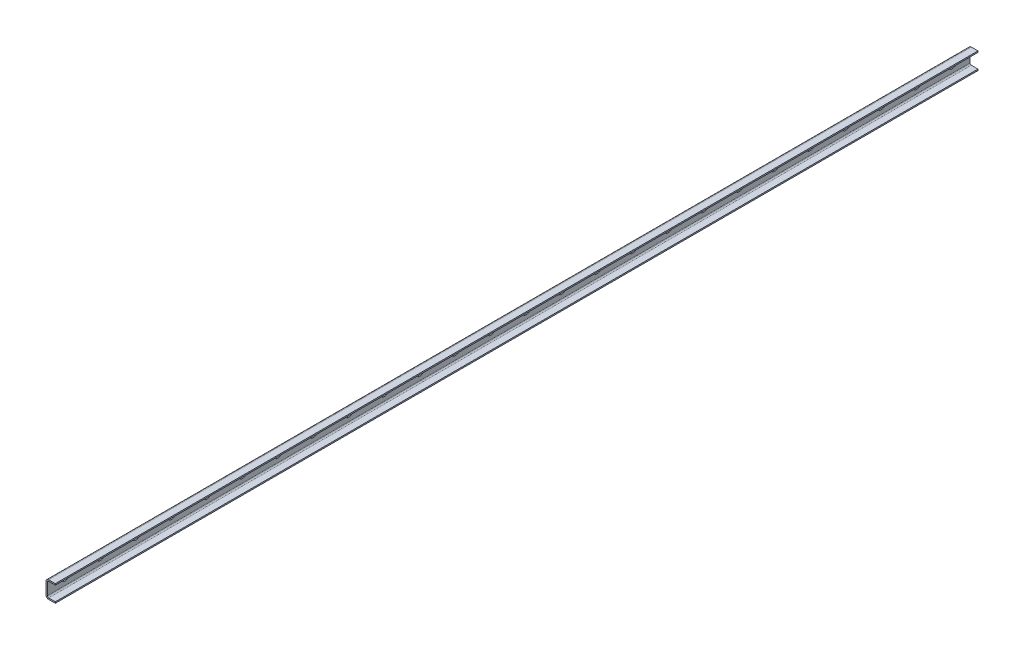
ISO-10303-21;
HEADER;
FILE_DESCRIPTION(('STEP AP214'),'2;1');
FILE_NAME('part.step','',(''),(''),'','','');
FILE_SCHEMA(('AUTOMOTIVE_DESIGN { 1 0 10303 214 1 1 1 1 }'));
ENDSEC;
DATA;
#1=APPLICATION_CONTEXT('core data for automotive mechanical design processes');
#2=APPLICATION_PROTOCOL_DEFINITION('international standard','automotive_design',2000,#1);
#3=PRODUCT_CONTEXT('',#1,'mechanical');
#4=PRODUCT('Part','Part','',(#3));
#5=PRODUCT_RELATED_PRODUCT_CATEGORY('part','',(#4));
#6=PRODUCT_DEFINITION_FORMATION('','',#4);
#7=PRODUCT_DEFINITION_CONTEXT('part definition',#1,'design');
#8=PRODUCT_DEFINITION('design','',#6,#7);
#9=PRODUCT_DEFINITION_SHAPE('','',#8);
#10=(LENGTH_UNIT() NAMED_UNIT(*) SI_UNIT(.MILLI.,.METRE.));
#11=(NAMED_UNIT(*) PLANE_ANGLE_UNIT() SI_UNIT($,.RADIAN.));
#12=(NAMED_UNIT(*) SI_UNIT($,.STERADIAN.) SOLID_ANGLE_UNIT());
#13=UNCERTAINTY_MEASURE_WITH_UNIT(LENGTH_MEASURE(1.E-05),#10,'distance_accuracy_value','');
#14=(GEOMETRIC_REPRESENTATION_CONTEXT(3) GLOBAL_UNCERTAINTY_ASSIGNED_CONTEXT((#13)) GLOBAL_UNIT_ASSIGNED_CONTEXT((#10,
#11,#12)) REPRESENTATION_CONTEXT('',''));
#15=CARTESIAN_POINT('',(0.,0.,0.));
#16=DIRECTION('',(0.,0.,1.));
#17=DIRECTION('',(1.,0.,0.));
#18=AXIS2_PLACEMENT_3D('',#15,#16,#17);
#19=CARTESIAN_POINT('',(0.,-4.5,-2038.));
#20=DIRECTION('',(0.,-1.,0.));
#21=DIRECTION('',(0.,0.,-1.));
#22=AXIS2_PLACEMENT_3D('',#19,#20,#21);
#23=PLANE('',#22);
#24=DIRECTION('',(0.,0.,-1.));
#25=VECTOR('',#24,1.);
#26=CARTESIAN_POINT('',(3.,-4.5,-2038.));
#27=LINE('',#26,#25);
#28=CARTESIAN_POINT('',(3.,-4.5,-2038.));
#29=VERTEX_POINT('',#28);
#30=CARTESIAN_POINT('',(3.,-4.5,-2042.));
#31=VERTEX_POINT('',#30);
#32=EDGE_CURVE('E2005',#29,#31,#27,.T.);
#33=ORIENTED_EDGE('',*,*,#32,.T.);
#34=DIRECTION('',(1.,0.,0.));
#35=VECTOR('',#34,1.);
#36=CARTESIAN_POINT('',(0.,-4.5,-2042.));
#37=LINE('',#36,#35);
#38=CARTESIAN_POINT('',(0.,-4.5,-2042.));
#39=VERTEX_POINT('',#38);
#40=EDGE_CURVE('E11',#39,#31,#37,.T.);
#41=ORIENTED_EDGE('',*,*,#40,.F.);
#42=DIRECTION('',(0.,0.,-1.));
#43=VECTOR('',#42,1.);
#44=CARTESIAN_POINT('',(0.,-4.5,-2038.));
#45=LINE('',#44,#43);
#46=CARTESIAN_POINT('',(0.,-4.5,-2038.));
#47=VERTEX_POINT('',#46);
#48=EDGE_CURVE('E2011',#47,#39,#45,.T.);
#49=ORIENTED_EDGE('',*,*,#48,.F.);
#50=DIRECTION('',(1.,0.,0.));
#51=VECTOR('',#50,1.);
#52=CARTESIAN_POINT('',(0.,-4.5,-2038.));
#53=LINE('',#52,#51);
#54=EDGE_CURVE('E2019',#47,#29,#53,.T.);
#55=ORIENTED_EDGE('',*,*,#54,.T.);
#56=EDGE_LOOP('',(#33,#41,#49,#55));
#57=FACE_BOUND('',#56,.T.);
#58=ADVANCED_FACE('F39',(#57),#23,.F.);
#59=CARTESIAN_POINT('',(0.,0.,-2042.));
#60=DIRECTION('',(1.,0.,0.));
#61=DIRECTION('',(0.,0.,-1.));
#62=AXIS2_PLACEMENT_3D('',#59,#60,#61);
#63=CYLINDRICAL_SURFACE('',#62,4.5);
#64=CARTESIAN_POINT('',(3.,0.,-2042.));
#65=DIRECTION('',(1.,0.,0.));
#66=DIRECTION('',(0.,0.,-1.));
#67=AXIS2_PLACEMENT_3D('',#64,#65,#66);
#68=CIRCLE('',#67,4.5);
#69=CARTESIAN_POINT('',(3.,4.5,-2042.));
#70=VERTEX_POINT('',#69);
#71=EDGE_CURVE('E2001',#31,#70,#68,.T.);
#72=ORIENTED_EDGE('',*,*,#71,.T.);
#73=DIRECTION('',(1.,0.,0.));
#74=VECTOR('',#73,1.);
#75=CARTESIAN_POINT('',(0.,4.5,-2042.));
#76=LINE('',#75,#74);
#77=CARTESIAN_POINT('',(0.,4.5,-2042.));
#78=VERTEX_POINT('',#77);
#79=EDGE_CURVE('E47',#78,#70,#76,.T.);
#80=ORIENTED_EDGE('',*,*,#79,.F.);
#81=CARTESIAN_POINT('',(0.,0.,-2042.));
#82=DIRECTION('',(1.,0.,0.));
#83=DIRECTION('',(0.,0.,-1.));
#84=AXIS2_PLACEMENT_3D('',#81,#82,#83);
#85=CIRCLE('',#84,4.5);
#86=EDGE_CURVE('E61',#39,#78,#85,.T.);
#87=ORIENTED_EDGE('',*,*,#86,.F.);
#88=ORIENTED_EDGE('',*,*,#40,.T.);
#89=EDGE_LOOP('',(#72,#80,#87,#88));
#90=FACE_BOUND('',#89,.T.);
#91=ADVANCED_FACE('F2032',(#90),#63,.F.);
#92=CARTESIAN_POINT('',(0.,4.5,-2038.));
#93=DIRECTION('',(0.,1.,0.));
#94=DIRECTION('',(0.,0.,1.));
#95=AXIS2_PLACEMENT_3D('',#92,#93,#94);
#96=PLANE('',#95);
#97=DIRECTION('',(0.,0.,1.));
#98=VECTOR('',#97,1.);
#99=CARTESIAN_POINT('',(3.,4.5,-2038.));
#100=LINE('',#99,#98);
#101=CARTESIAN_POINT('',(3.,4.5,-2038.));
#102=VERTEX_POINT('',#101);
#103=EDGE_CURVE('E1997',#70,#102,#100,.T.);
#104=ORIENTED_EDGE('',*,*,#103,.T.);
#105=DIRECTION('',(1.,0.,0.));
#106=VECTOR('',#105,1.);
#107=CARTESIAN_POINT('',(0.,4.5,-2038.));
#108=LINE('',#107,#106);
#109=CARTESIAN_POINT('',(0.,4.5,-2038.));
#110=VERTEX_POINT('',#109);
#111=EDGE_CURVE('E2023',#110,#102,#108,.T.);
#112=ORIENTED_EDGE('',*,*,#111,.F.);
#113=DIRECTION('',(0.,0.,1.));
#114=VECTOR('',#113,1.);
#115=CARTESIAN_POINT('',(0.,4.5,-2038.));
#116=LINE('',#115,#114);
#117=EDGE_CURVE('E2016',#78,#110,#116,.T.);
#118=ORIENTED_EDGE('',*,*,#117,.F.);
#119=ORIENTED_EDGE('',*,*,#79,.T.);
#120=EDGE_LOOP('',(#104,#112,#118,#119));
#121=FACE_BOUND('',#120,.T.);
#122=ADVANCED_FACE('F2029',(#121),#96,.F.);
#123=CARTESIAN_POINT('',(0.,0.,-2038.));
#124=DIRECTION('',(1.,0.,0.));
#125=DIRECTION('',(0.,0.,-1.));
#126=AXIS2_PLACEMENT_3D('',#123,#124,#125);
#127=CYLINDRICAL_SURFACE('',#126,4.5);
#128=CARTESIAN_POINT('',(3.,0.,-2038.));
#129=DIRECTION('',(1.,0.,0.));
#130=DIRECTION('',(0.,0.,-1.));
#131=AXIS2_PLACEMENT_3D('',#128,#129,#130);
#132=CIRCLE('',#131,4.5);
#133=EDGE_CURVE('E1994',#102,#29,#132,.T.);
#134=ORIENTED_EDGE('',*,*,#133,.T.);
#135=ORIENTED_EDGE('',*,*,#54,.F.);
#136=CARTESIAN_POINT('',(0.,0.,-2038.));
#137=DIRECTION('',(1.,0.,0.));
#138=DIRECTION('',(0.,0.,-1.));
#139=AXIS2_PLACEMENT_3D('',#136,#137,#138);
#140=CIRCLE('',#139,4.5);
#141=EDGE_CURVE('E54',#110,#47,#140,.T.);
#142=ORIENTED_EDGE('',*,*,#141,.F.);
#143=ORIENTED_EDGE('',*,*,#111,.T.);
#144=EDGE_LOOP('',(#134,#135,#142,#143));
#145=FACE_BOUND('',#144,.T.);
#146=ADVANCED_FACE('F2038',(#145),#127,.F.);
#147=CARTESIAN_POINT('',(0.,-4.5,-1958.));
#148=DIRECTION('',(0.,-1.,0.));
#149=DIRECTION('',(0.,0.,-1.));
#150=AXIS2_PLACEMENT_3D('',#147,#148,#149);
#151=PLANE('',#150);
#152=DIRECTION('',(0.,0.,-1.));
#153=VECTOR('',#152,1.);
#154=CARTESIAN_POINT('',(3.,-4.5,-1958.));
#155=LINE('',#154,#153);
#156=CARTESIAN_POINT('',(3.,-4.5,-1958.));
#157=VERTEX_POINT('',#156);
#158=CARTESIAN_POINT('',(3.,-4.5,-1962.));
#159=VERTEX_POINT('',#158);
#160=EDGE_CURVE('E1962',#157,#159,#155,.T.);
#161=ORIENTED_EDGE('',*,*,#160,.T.);
#162=DIRECTION('',(1.,0.,0.));
#163=VECTOR('',#162,1.);
#164=CARTESIAN_POINT('',(0.,-4.5,-1962.));
#165=LINE('',#164,#163);
#166=CARTESIAN_POINT('',(0.,-4.5,-1962.));
#167=VERTEX_POINT('',#166);
#168=EDGE_CURVE('E1990',#167,#159,#165,.T.);
#169=ORIENTED_EDGE('',*,*,#168,.F.);
#170=DIRECTION('',(0.,0.,-1.));
#171=VECTOR('',#170,1.);
#172=CARTESIAN_POINT('',(0.,-4.5,-1958.));
#173=LINE('',#172,#171);
#174=CARTESIAN_POINT('',(0.,-4.5,-1958.));
#175=VERTEX_POINT('',#174);
#176=EDGE_CURVE('E1969',#175,#167,#173,.T.);
#177=ORIENTED_EDGE('',*,*,#176,.F.);
#178=DIRECTION('',(1.,0.,0.));
#179=VECTOR('',#178,1.);
#180=CARTESIAN_POINT('',(0.,-4.5,-1958.));
#181=LINE('',#180,#179);
#182=EDGE_CURVE('E1979',#175,#157,#181,.T.);
#183=ORIENTED_EDGE('',*,*,#182,.T.);
#184=EDGE_LOOP('',(#161,#169,#177,#183));
#185=FACE_BOUND('',#184,.T.);
#186=ADVANCED_FACE('F2040',(#185),#151,.F.);
#187=CARTESIAN_POINT('',(0.,0.,-1962.));
#188=DIRECTION('',(1.,0.,0.));
#189=DIRECTION('',(0.,0.,-1.));
#190=AXIS2_PLACEMENT_3D('',#187,#188,#189);
#191=CYLINDRICAL_SURFACE('',#190,4.5);
#192=CARTESIAN_POINT('',(3.,0.,-1962.));
#193=DIRECTION('',(1.,0.,0.));
#194=DIRECTION('',(0.,0.,-1.));
#195=AXIS2_PLACEMENT_3D('',#192,#193,#194);
#196=CIRCLE('',#195,4.5);
#197=CARTESIAN_POINT('',(3.,4.5,-1962.));
#198=VERTEX_POINT('',#197);
#199=EDGE_CURVE('E1958',#159,#198,#196,.T.);
#200=ORIENTED_EDGE('',*,*,#199,.T.);
#201=DIRECTION('',(1.,0.,0.));
#202=VECTOR('',#201,1.);
#203=CARTESIAN_POINT('',(0.,4.5,-1962.));
#204=LINE('',#203,#202);
#205=CARTESIAN_POINT('',(0.,4.5,-1962.));
#206=VERTEX_POINT('',#205);
#207=EDGE_CURVE('E1986',#206,#198,#204,.T.);
#208=ORIENTED_EDGE('',*,*,#207,.F.);
#209=CARTESIAN_POINT('',(0.,0.,-1962.));
#210=DIRECTION('',(1.,0.,0.));
#211=DIRECTION('',(0.,0.,-1.));
#212=AXIS2_PLACEMENT_3D('',#209,#210,#211);
#213=CIRCLE('',#212,4.5);
#214=EDGE_CURVE('E1972',#167,#206,#213,.T.);
#215=ORIENTED_EDGE('',*,*,#214,.F.);
#216=ORIENTED_EDGE('',*,*,#168,.T.);
#217=EDGE_LOOP('',(#200,#208,#215,#216));
#218=FACE_BOUND('',#217,.T.);
#219=ADVANCED_FACE('F2046',(#218),#191,.F.);
#220=CARTESIAN_POINT('',(0.,4.5,-1958.));
#221=DIRECTION('',(0.,1.,0.));
#222=DIRECTION('',(0.,0.,1.));
#223=AXIS2_PLACEMENT_3D('',#220,#221,#222);
#224=PLANE('',#223);
#225=DIRECTION('',(0.,0.,1.));
#226=VECTOR('',#225,1.);
#227=CARTESIAN_POINT('',(3.,4.5,-1958.));
#228=LINE('',#227,#226);
#229=CARTESIAN_POINT('',(3.,4.5,-1958.));
#230=VERTEX_POINT('',#229);
#231=EDGE_CURVE('E1954',#198,#230,#228,.T.);
#232=ORIENTED_EDGE('',*,*,#231,.T.);
#233=DIRECTION('',(1.,0.,0.));
#234=VECTOR('',#233,1.);
#235=CARTESIAN_POINT('',(0.,4.5,-1958.));
#236=LINE('',#235,#234);
#237=CARTESIAN_POINT('',(0.,4.5,-1958.));
#238=VERTEX_POINT('',#237);
#239=EDGE_CURVE('E1983',#238,#230,#236,.T.);
#240=ORIENTED_EDGE('',*,*,#239,.F.);
#241=DIRECTION('',(0.,0.,1.));
#242=VECTOR('',#241,1.);
#243=CARTESIAN_POINT('',(0.,4.5,-1958.));
#244=LINE('',#243,#242);
#245=EDGE_CURVE('E1975',#206,#238,#244,.T.);
#246=ORIENTED_EDGE('',*,*,#245,.F.);
#247=ORIENTED_EDGE('',*,*,#207,.T.);
#248=EDGE_LOOP('',(#232,#240,#246,#247));
#249=FACE_BOUND('',#248,.T.);
#250=ADVANCED_FACE('F2074',(#249),#224,.F.);
#251=CARTESIAN_POINT('',(0.,0.,-1958.));
#252=DIRECTION('',(1.,0.,0.));
#253=DIRECTION('',(0.,0.,-1.));
#254=AXIS2_PLACEMENT_3D('',#251,#252,#253);
#255=CYLINDRICAL_SURFACE('',#254,4.5);
#256=CARTESIAN_POINT('',(3.,0.,-1958.));
#257=DIRECTION('',(1.,0.,0.));
#258=DIRECTION('',(0.,0.,-1.));
#259=AXIS2_PLACEMENT_3D('',#256,#257,#258);
#260=CIRCLE('',#259,4.5);
#261=EDGE_CURVE('E1951',#230,#157,#260,.T.);
#262=ORIENTED_EDGE('',*,*,#261,.T.);
#263=ORIENTED_EDGE('',*,*,#182,.F.);
#264=CARTESIAN_POINT('',(0.,0.,-1958.));
#265=DIRECTION('',(1.,0.,0.));
#266=DIRECTION('',(0.,0.,-1.));
#267=AXIS2_PLACEMENT_3D('',#264,#265,#266);
#268=CIRCLE('',#267,4.5);
#269=EDGE_CURVE('E1966',#238,#175,#268,.T.);
#270=ORIENTED_EDGE('',*,*,#269,.F.);
#271=ORIENTED_EDGE('',*,*,#239,.T.);
#272=EDGE_LOOP('',(#262,#263,#270,#271));
#273=FACE_BOUND('',#272,.T.);
#274=ADVANCED_FACE('F2083',(#273),#255,.F.);
#275=CARTESIAN_POINT('',(0.,-4.5,-1878.));
#276=DIRECTION('',(0.,-1.,0.));
#277=DIRECTION('',(0.,0.,-1.));
#278=AXIS2_PLACEMENT_3D('',#275,#276,#277);
#279=PLANE('',#278);
#280=DIRECTION('',(0.,0.,-1.));
#281=VECTOR('',#280,1.);
#282=CARTESIAN_POINT('',(3.,-4.5,-1878.));
#283=LINE('',#282,#281);
#284=CARTESIAN_POINT('',(3.,-4.5,-1878.));
#285=VERTEX_POINT('',#284);
#286=CARTESIAN_POINT('',(3.,-4.5,-1882.));
#287=VERTEX_POINT('',#286);
#288=EDGE_CURVE('E1918',#285,#287,#283,.T.);
#289=ORIENTED_EDGE('',*,*,#288,.T.);
#290=DIRECTION('',(1.,0.,0.));
#291=VECTOR('',#290,1.);
#292=CARTESIAN_POINT('',(0.,-4.5,-1882.));
#293=LINE('',#292,#291);
#294=CARTESIAN_POINT('',(0.,-4.5,-1882.));
#295=VERTEX_POINT('',#294);
#296=EDGE_CURVE('E1947',#295,#287,#293,.T.);
#297=ORIENTED_EDGE('',*,*,#296,.F.);
#298=DIRECTION('',(0.,0.,-1.));
#299=VECTOR('',#298,1.);
#300=CARTESIAN_POINT('',(0.,-4.5,-1878.));
#301=LINE('',#300,#299);
#302=CARTESIAN_POINT('',(0.,-4.5,-1878.));
#303=VERTEX_POINT('',#302);
#304=EDGE_CURVE('E1925',#303,#295,#301,.T.);
#305=ORIENTED_EDGE('',*,*,#304,.F.);
#306=DIRECTION('',(1.,0.,0.));
#307=VECTOR('',#306,1.);
#308=CARTESIAN_POINT('',(0.,-4.5,-1878.));
#309=LINE('',#308,#307);
#310=EDGE_CURVE('E1935',#303,#285,#309,.T.);
#311=ORIENTED_EDGE('',*,*,#310,.T.);
#312=EDGE_LOOP('',(#289,#297,#305,#311));
#313=FACE_BOUND('',#312,.T.);
#314=ADVANCED_FACE('F2092',(#313),#279,.F.);
#315=CARTESIAN_POINT('',(0.,0.,-1882.));
#316=DIRECTION('',(1.,0.,0.));
#317=DIRECTION('',(0.,0.,-1.));
#318=AXIS2_PLACEMENT_3D('',#315,#316,#317);
#319=CYLINDRICAL_SURFACE('',#318,4.5);
#320=CARTESIAN_POINT('',(3.,0.,-1882.));
#321=DIRECTION('',(1.,0.,0.));
#322=DIRECTION('',(0.,0.,-1.));
#323=AXIS2_PLACEMENT_3D('',#320,#321,#322);
#324=CIRCLE('',#323,4.5);
#325=CARTESIAN_POINT('',(3.,4.5,-1882.));
#326=VERTEX_POINT('',#325);
#327=EDGE_CURVE('E1914',#287,#326,#324,.T.);
#328=ORIENTED_EDGE('',*,*,#327,.T.);
#329=DIRECTION('',(1.,0.,0.));
#330=VECTOR('',#329,1.);
#331=CARTESIAN_POINT('',(0.,4.5,-1882.));
#332=LINE('',#331,#330);
#333=CARTESIAN_POINT('',(0.,4.5,-1882.));
#334=VERTEX_POINT('',#333);
#335=EDGE_CURVE('E1943',#334,#326,#332,.T.);
#336=ORIENTED_EDGE('',*,*,#335,.F.);
#337=CARTESIAN_POINT('',(0.,0.,-1882.));
#338=DIRECTION('',(1.,0.,0.));
#339=DIRECTION('',(0.,0.,-1.));
#340=AXIS2_PLACEMENT_3D('',#337,#338,#339);
#341=CIRCLE('',#340,4.5);
#342=EDGE_CURVE('E1928',#295,#334,#341,.T.);
#343=ORIENTED_EDGE('',*,*,#342,.F.);
#344=ORIENTED_EDGE('',*,*,#296,.T.);
#345=EDGE_LOOP('',(#328,#336,#343,#344));
#346=FACE_BOUND('',#345,.T.);
#347=ADVANCED_FACE('F2101',(#346),#319,.F.);
#348=CARTESIAN_POINT('',(0.,4.5,-1878.));
#349=DIRECTION('',(0.,1.,0.));
#350=DIRECTION('',(0.,0.,1.));
#351=AXIS2_PLACEMENT_3D('',#348,#349,#350);
#352=PLANE('',#351);
#353=DIRECTION('',(0.,0.,1.));
#354=VECTOR('',#353,1.);
#355=CARTESIAN_POINT('',(3.,4.5,-1878.));
#356=LINE('',#355,#354);
#357=CARTESIAN_POINT('',(3.,4.5,-1878.));
#358=VERTEX_POINT('',#357);
#359=EDGE_CURVE('E1910',#326,#358,#356,.T.);
#360=ORIENTED_EDGE('',*,*,#359,.T.);
#361=DIRECTION('',(1.,0.,0.));
#362=VECTOR('',#361,1.);
#363=CARTESIAN_POINT('',(0.,4.5,-1878.));
#364=LINE('',#363,#362);
#365=CARTESIAN_POINT('',(0.,4.5,-1878.));
#366=VERTEX_POINT('',#365);
#367=EDGE_CURVE('E1939',#366,#358,#364,.T.);
#368=ORIENTED_EDGE('',*,*,#367,.F.);
#369=DIRECTION('',(0.,0.,1.));
#370=VECTOR('',#369,1.);
#371=CARTESIAN_POINT('',(0.,4.5,-1878.));
#372=LINE('',#371,#370);
#373=EDGE_CURVE('E1931',#334,#366,#372,.T.);
#374=ORIENTED_EDGE('',*,*,#373,.F.);
#375=ORIENTED_EDGE('',*,*,#335,.T.);
#376=EDGE_LOOP('',(#360,#368,#374,#375));
#377=FACE_BOUND('',#376,.T.);
#378=ADVANCED_FACE('F2110',(#377),#352,.F.);
#379=CARTESIAN_POINT('',(0.,0.,-1878.));
#380=DIRECTION('',(1.,0.,0.));
#381=DIRECTION('',(0.,0.,-1.));
#382=AXIS2_PLACEMENT_3D('',#379,#380,#381);
#383=CYLINDRICAL_SURFACE('',#382,4.5);
#384=CARTESIAN_POINT('',(3.,0.,-1878.));
#385=DIRECTION('',(1.,0.,0.));
#386=DIRECTION('',(0.,0.,-1.));
#387=AXIS2_PLACEMENT_3D('',#384,#385,#386);
#388=CIRCLE('',#387,4.5);
#389=EDGE_CURVE('E1907',#358,#285,#388,.T.);
#390=ORIENTED_EDGE('',*,*,#389,.T.);
#391=ORIENTED_EDGE('',*,*,#310,.F.);
#392=CARTESIAN_POINT('',(0.,0.,-1878.));
#393=DIRECTION('',(1.,0.,0.));
#394=DIRECTION('',(0.,0.,-1.));
#395=AXIS2_PLACEMENT_3D('',#392,#393,#394);
#396=CIRCLE('',#395,4.5);
#397=EDGE_CURVE('E1922',#366,#303,#396,.T.);
#398=ORIENTED_EDGE('',*,*,#397,.F.);
#399=ORIENTED_EDGE('',*,*,#367,.T.);
#400=EDGE_LOOP('',(#390,#391,#398,#399));
#401=FACE_BOUND('',#400,.T.);
#402=ADVANCED_FACE('F2119',(#401),#383,.F.);
#403=CARTESIAN_POINT('',(0.,-4.5,-1798.));
#404=DIRECTION('',(0.,-1.,0.));
#405=DIRECTION('',(0.,0.,-1.));
#406=AXIS2_PLACEMENT_3D('',#403,#404,#405);
#407=PLANE('',#406);
#408=DIRECTION('',(0.,0.,-1.));
#409=VECTOR('',#408,1.);
#410=CARTESIAN_POINT('',(3.,-4.5,-1798.));
#411=LINE('',#410,#409);
#412=CARTESIAN_POINT('',(3.,-4.5,-1798.));
#413=VERTEX_POINT('',#412);
#414=CARTESIAN_POINT('',(3.,-4.5,-1802.));
#415=VERTEX_POINT('',#414);
#416=EDGE_CURVE('E1874',#413,#415,#411,.T.);
#417=ORIENTED_EDGE('',*,*,#416,.T.);
#418=DIRECTION('',(1.,0.,0.));
#419=VECTOR('',#418,1.);
#420=CARTESIAN_POINT('',(0.,-4.5,-1802.));
#421=LINE('',#420,#419);
#422=CARTESIAN_POINT('',(0.,-4.5,-1802.));
#423=VERTEX_POINT('',#422);
#424=EDGE_CURVE('E1903',#423,#415,#421,.T.);
#425=ORIENTED_EDGE('',*,*,#424,.F.);
#426=DIRECTION('',(0.,0.,-1.));
#427=VECTOR('',#426,1.);
#428=CARTESIAN_POINT('',(0.,-4.5,-1798.));
#429=LINE('',#428,#427);
#430=CARTESIAN_POINT('',(0.,-4.5,-1798.));
#431=VERTEX_POINT('',#430);
#432=EDGE_CURVE('E1881',#431,#423,#429,.T.);
#433=ORIENTED_EDGE('',*,*,#432,.F.);
#434=DIRECTION('',(1.,0.,0.));
#435=VECTOR('',#434,1.);
#436=CARTESIAN_POINT('',(0.,-4.5,-1798.));
#437=LINE('',#436,#435);
#438=EDGE_CURVE('E1891',#431,#413,#437,.T.);
#439=ORIENTED_EDGE('',*,*,#438,.T.);
#440=EDGE_LOOP('',(#417,#425,#433,#439));
#441=FACE_BOUND('',#440,.T.);
#442=ADVANCED_FACE('F2128',(#441),#407,.F.);
#443=CARTESIAN_POINT('',(0.,0.,-1802.));
#444=DIRECTION('',(1.,0.,0.));
#445=DIRECTION('',(0.,0.,-1.));
#446=AXIS2_PLACEMENT_3D('',#443,#444,#445);
#447=CYLINDRICAL_SURFACE('',#446,4.5);
#448=CARTESIAN_POINT('',(3.,0.,-1802.));
#449=DIRECTION('',(1.,0.,0.));
#450=DIRECTION('',(0.,0.,-1.));
#451=AXIS2_PLACEMENT_3D('',#448,#449,#450);
#452=CIRCLE('',#451,4.5);
#453=CARTESIAN_POINT('',(3.,4.5,-1802.));
#454=VERTEX_POINT('',#453);
#455=EDGE_CURVE('E1870',#415,#454,#452,.T.);
#456=ORIENTED_EDGE('',*,*,#455,.T.);
#457=DIRECTION('',(1.,0.,0.));
#458=VECTOR('',#457,1.);
#459=CARTESIAN_POINT('',(0.,4.5,-1802.));
#460=LINE('',#459,#458);
#461=CARTESIAN_POINT('',(0.,4.5,-1802.));
#462=VERTEX_POINT('',#461);
#463=EDGE_CURVE('E1899',#462,#454,#460,.T.);
#464=ORIENTED_EDGE('',*,*,#463,.F.);
#465=CARTESIAN_POINT('',(0.,0.,-1802.));
#466=DIRECTION('',(1.,0.,0.));
#467=DIRECTION('',(0.,0.,-1.));
#468=AXIS2_PLACEMENT_3D('',#465,#466,#467);
#469=CIRCLE('',#468,4.5);
#470=EDGE_CURVE('E1884',#423,#462,#469,.T.);
#471=ORIENTED_EDGE('',*,*,#470,.F.);
#472=ORIENTED_EDGE('',*,*,#424,.T.);
#473=EDGE_LOOP('',(#456,#464,#471,#472));
#474=FACE_BOUND('',#473,.T.);
#475=ADVANCED_FACE('F2137',(#474),#447,.F.);
#476=CARTESIAN_POINT('',(0.,4.5,-1798.));
#477=DIRECTION('',(0.,1.,0.));
#478=DIRECTION('',(0.,0.,1.));
#479=AXIS2_PLACEMENT_3D('',#476,#477,#478);
#480=PLANE('',#479);
#481=DIRECTION('',(0.,0.,1.));
#482=VECTOR('',#481,1.);
#483=CARTESIAN_POINT('',(3.,4.5,-1798.));
#484=LINE('',#483,#482);
#485=CARTESIAN_POINT('',(3.,4.5,-1798.));
#486=VERTEX_POINT('',#485);
#487=EDGE_CURVE('E1866',#454,#486,#484,.T.);
#488=ORIENTED_EDGE('',*,*,#487,.T.);
#489=DIRECTION('',(1.,0.,0.));
#490=VECTOR('',#489,1.);
#491=CARTESIAN_POINT('',(0.,4.5,-1798.));
#492=LINE('',#491,#490);
#493=CARTESIAN_POINT('',(0.,4.5,-1798.));
#494=VERTEX_POINT('',#493);
#495=EDGE_CURVE('E1895',#494,#486,#492,.T.);
#496=ORIENTED_EDGE('',*,*,#495,.F.);
#497=DIRECTION('',(0.,0.,1.));
#498=VECTOR('',#497,1.);
#499=CARTESIAN_POINT('',(0.,4.5,-1798.));
#500=LINE('',#499,#498);
#501=EDGE_CURVE('E1887',#462,#494,#500,.T.);
#502=ORIENTED_EDGE('',*,*,#501,.F.);
#503=ORIENTED_EDGE('',*,*,#463,.T.);
#504=EDGE_LOOP('',(#488,#496,#502,#503));
#505=FACE_BOUND('',#504,.T.);
#506=ADVANCED_FACE('F2146',(#505),#480,.F.);
#507=CARTESIAN_POINT('',(0.,0.,-1798.));
#508=DIRECTION('',(1.,0.,0.));
#509=DIRECTION('',(0.,0.,-1.));
#510=AXIS2_PLACEMENT_3D('',#507,#508,#509);
#511=CYLINDRICAL_SURFACE('',#510,4.5);
#512=CARTESIAN_POINT('',(3.,0.,-1798.));
#513=DIRECTION('',(1.,0.,0.));
#514=DIRECTION('',(0.,0.,-1.));
#515=AXIS2_PLACEMENT_3D('',#512,#513,#514);
#516=CIRCLE('',#515,4.5);
#517=EDGE_CURVE('E1863',#486,#413,#516,.T.);
#518=ORIENTED_EDGE('',*,*,#517,.T.);
#519=ORIENTED_EDGE('',*,*,#438,.F.);
#520=CARTESIAN_POINT('',(0.,0.,-1798.));
#521=DIRECTION('',(1.,0.,0.));
#522=DIRECTION('',(0.,0.,-1.));
#523=AXIS2_PLACEMENT_3D('',#520,#521,#522);
#524=CIRCLE('',#523,4.5);
#525=EDGE_CURVE('E1878',#494,#431,#524,.T.);
#526=ORIENTED_EDGE('',*,*,#525,.F.);
#527=ORIENTED_EDGE('',*,*,#495,.T.);
#528=EDGE_LOOP('',(#518,#519,#526,#527));
#529=FACE_BOUND('',#528,.T.);
#530=ADVANCED_FACE('F2155',(#529),#511,.F.);
#531=CARTESIAN_POINT('',(0.,-4.5,-1718.));
#532=DIRECTION('',(0.,-1.,0.));
#533=DIRECTION('',(0.,0.,-1.));
#534=AXIS2_PLACEMENT_3D('',#531,#532,#533);
#535=PLANE('',#534);
#536=DIRECTION('',(0.,0.,-1.));
#537=VECTOR('',#536,1.);
#538=CARTESIAN_POINT('',(3.,-4.5,-1718.));
#539=LINE('',#538,#537);
#540=CARTESIAN_POINT('',(3.,-4.5,-1718.));
#541=VERTEX_POINT('',#540);
#542=CARTESIAN_POINT('',(3.,-4.5,-1722.));
#543=VERTEX_POINT('',#542);
#544=EDGE_CURVE('E1830',#541,#543,#539,.T.);
#545=ORIENTED_EDGE('',*,*,#544,.T.);
#546=DIRECTION('',(1.,0.,0.));
#547=VECTOR('',#546,1.);
#548=CARTESIAN_POINT('',(0.,-4.5,-1722.));
#549=LINE('',#548,#547);
#550=CARTESIAN_POINT('',(0.,-4.5,-1722.));
#551=VERTEX_POINT('',#550);
#552=EDGE_CURVE('E1859',#551,#543,#549,.T.);
#553=ORIENTED_EDGE('',*,*,#552,.F.);
#554=DIRECTION('',(0.,0.,-1.));
#555=VECTOR('',#554,1.);
#556=CARTESIAN_POINT('',(0.,-4.5,-1718.));
#557=LINE('',#556,#555);
#558=CARTESIAN_POINT('',(0.,-4.5,-1718.));
#559=VERTEX_POINT('',#558);
#560=EDGE_CURVE('E1837',#559,#551,#557,.T.);
#561=ORIENTED_EDGE('',*,*,#560,.F.);
#562=DIRECTION('',(1.,0.,0.));
#563=VECTOR('',#562,1.);
#564=CARTESIAN_POINT('',(0.,-4.5,-1718.));
#565=LINE('',#564,#563);
#566=EDGE_CURVE('E1847',#559,#541,#565,.T.);
#567=ORIENTED_EDGE('',*,*,#566,.T.);
#568=EDGE_LOOP('',(#545,#553,#561,#567));
#569=FACE_BOUND('',#568,.T.);
#570=ADVANCED_FACE('F2164',(#569),#535,.F.);
#571=CARTESIAN_POINT('',(0.,0.,-1722.));
#572=DIRECTION('',(1.,0.,0.));
#573=DIRECTION('',(0.,0.,-1.));
#574=AXIS2_PLACEMENT_3D('',#571,#572,#573);
#575=CYLINDRICAL_SURFACE('',#574,4.5);
#576=CARTESIAN_POINT('',(3.,0.,-1722.));
#577=DIRECTION('',(1.,0.,0.));
#578=DIRECTION('',(0.,0.,-1.));
#579=AXIS2_PLACEMENT_3D('',#576,#577,#578);
#580=CIRCLE('',#579,4.5);
#581=CARTESIAN_POINT('',(3.,4.5,-1722.));
#582=VERTEX_POINT('',#581);
#583=EDGE_CURVE('E1826',#543,#582,#580,.T.);
#584=ORIENTED_EDGE('',*,*,#583,.T.);
#585=DIRECTION('',(1.,0.,0.));
#586=VECTOR('',#585,1.);
#587=CARTESIAN_POINT('',(0.,4.5,-1722.));
#588=LINE('',#587,#586);
#589=CARTESIAN_POINT('',(0.,4.5,-1722.));
#590=VERTEX_POINT('',#589);
#591=EDGE_CURVE('E1855',#590,#582,#588,.T.);
#592=ORIENTED_EDGE('',*,*,#591,.F.);
#593=CARTESIAN_POINT('',(0.,0.,-1722.));
#594=DIRECTION('',(1.,0.,0.));
#595=DIRECTION('',(0.,0.,-1.));
#596=AXIS2_PLACEMENT_3D('',#593,#594,#595);
#597=CIRCLE('',#596,4.5);
#598=EDGE_CURVE('E1840',#551,#590,#597,.T.);
#599=ORIENTED_EDGE('',*,*,#598,.F.);
#600=ORIENTED_EDGE('',*,*,#552,.T.);
#601=EDGE_LOOP('',(#584,#592,#599,#600));
#602=FACE_BOUND('',#601,.T.);
#603=ADVANCED_FACE('F2173',(#602),#575,.F.);
#604=CARTESIAN_POINT('',(0.,4.5,-1718.));
#605=DIRECTION('',(0.,1.,0.));
#606=DIRECTION('',(0.,0.,1.));
#607=AXIS2_PLACEMENT_3D('',#604,#605,#606);
#608=PLANE('',#607);
#609=DIRECTION('',(0.,0.,1.));
#610=VECTOR('',#609,1.);
#611=CARTESIAN_POINT('',(3.,4.5,-1718.));
#612=LINE('',#611,#610);
#613=CARTESIAN_POINT('',(3.,4.5,-1718.));
#614=VERTEX_POINT('',#613);
#615=EDGE_CURVE('E1822',#582,#614,#612,.T.);
#616=ORIENTED_EDGE('',*,*,#615,.T.);
#617=DIRECTION('',(1.,0.,0.));
#618=VECTOR('',#617,1.);
#619=CARTESIAN_POINT('',(0.,4.5,-1718.));
#620=LINE('',#619,#618);
#621=CARTESIAN_POINT('',(0.,4.5,-1718.));
#622=VERTEX_POINT('',#621);
#623=EDGE_CURVE('E1851',#622,#614,#620,.T.);
#624=ORIENTED_EDGE('',*,*,#623,.F.);
#625=DIRECTION('',(0.,0.,1.));
#626=VECTOR('',#625,1.);
#627=CARTESIAN_POINT('',(0.,4.5,-1718.));
#628=LINE('',#627,#626);
#629=EDGE_CURVE('E1843',#590,#622,#628,.T.);
#630=ORIENTED_EDGE('',*,*,#629,.F.);
#631=ORIENTED_EDGE('',*,*,#591,.T.);
#632=EDGE_LOOP('',(#616,#624,#630,#631));
#633=FACE_BOUND('',#632,.T.);
#634=ADVANCED_FACE('F2182',(#633),#608,.F.);
#635=CARTESIAN_POINT('',(0.,0.,-1718.));
#636=DIRECTION('',(1.,0.,0.));
#637=DIRECTION('',(0.,0.,-1.));
#638=AXIS2_PLACEMENT_3D('',#635,#636,#637);
#639=CYLINDRICAL_SURFACE('',#638,4.5);
#640=CARTESIAN_POINT('',(3.,0.,-1718.));
#641=DIRECTION('',(1.,0.,0.));
#642=DIRECTION('',(0.,0.,-1.));
#643=AXIS2_PLACEMENT_3D('',#640,#641,#642);
#644=CIRCLE('',#643,4.5);
#645=EDGE_CURVE('E1819',#614,#541,#644,.T.);
#646=ORIENTED_EDGE('',*,*,#645,.T.);
#647=ORIENTED_EDGE('',*,*,#566,.F.);
#648=CARTESIAN_POINT('',(0.,0.,-1718.));
#649=DIRECTION('',(1.,0.,0.));
#650=DIRECTION('',(0.,0.,-1.));
#651=AXIS2_PLACEMENT_3D('',#648,#649,#650);
#652=CIRCLE('',#651,4.5);
#653=EDGE_CURVE('E1834',#622,#559,#652,.T.);
#654=ORIENTED_EDGE('',*,*,#653,.F.);
#655=ORIENTED_EDGE('',*,*,#623,.T.);
#656=EDGE_LOOP('',(#646,#647,#654,#655));
#657=FACE_BOUND('',#656,.T.);
#658=ADVANCED_FACE('F2191',(#657),#639,.F.);
#659=CARTESIAN_POINT('',(0.,-4.5,-1638.));
#660=DIRECTION('',(0.,-1.,0.));
#661=DIRECTION('',(0.,0.,-1.));
#662=AXIS2_PLACEMENT_3D('',#659,#660,#661);
#663=PLANE('',#662);
#664=DIRECTION('',(0.,0.,-1.));
#665=VECTOR('',#664,1.);
#666=CARTESIAN_POINT('',(3.,-4.5,-1638.));
#667=LINE('',#666,#665);
#668=CARTESIAN_POINT('',(3.,-4.5,-1638.));
#669=VERTEX_POINT('',#668);
#670=CARTESIAN_POINT('',(3.,-4.5,-1642.));
#671=VERTEX_POINT('',#670);
#672=EDGE_CURVE('E1786',#669,#671,#667,.T.);
#673=ORIENTED_EDGE('',*,*,#672,.T.);
#674=DIRECTION('',(1.,0.,0.));
#675=VECTOR('',#674,1.);
#676=CARTESIAN_POINT('',(0.,-4.5,-1642.));
#677=LINE('',#676,#675);
#678=CARTESIAN_POINT('',(0.,-4.5,-1642.));
#679=VERTEX_POINT('',#678);
#680=EDGE_CURVE('E1815',#679,#671,#677,.T.);
#681=ORIENTED_EDGE('',*,*,#680,.F.);
#682=DIRECTION('',(0.,0.,-1.));
#683=VECTOR('',#682,1.);
#684=CARTESIAN_POINT('',(0.,-4.5,-1638.));
#685=LINE('',#684,#683);
#686=CARTESIAN_POINT('',(0.,-4.5,-1638.));
#687=VERTEX_POINT('',#686);
#688=EDGE_CURVE('E1793',#687,#679,#685,.T.);
#689=ORIENTED_EDGE('',*,*,#688,.F.);
#690=DIRECTION('',(1.,0.,0.));
#691=VECTOR('',#690,1.);
#692=CARTESIAN_POINT('',(0.,-4.5,-1638.));
#693=LINE('',#692,#691);
#694=EDGE_CURVE('E1803',#687,#669,#693,.T.);
#695=ORIENTED_EDGE('',*,*,#694,.T.);
#696=EDGE_LOOP('',(#673,#681,#689,#695));
#697=FACE_BOUND('',#696,.T.);
#698=ADVANCED_FACE('F2200',(#697),#663,.F.);
#699=CARTESIAN_POINT('',(0.,0.,-1642.));
#700=DIRECTION('',(1.,0.,0.));
#701=DIRECTION('',(0.,0.,-1.));
#702=AXIS2_PLACEMENT_3D('',#699,#700,#701);
#703=CYLINDRICAL_SURFACE('',#702,4.5);
#704=CARTESIAN_POINT('',(3.,0.,-1642.));
#705=DIRECTION('',(1.,0.,0.));
#706=DIRECTION('',(0.,0.,-1.));
#707=AXIS2_PLACEMENT_3D('',#704,#705,#706);
#708=CIRCLE('',#707,4.5);
#709=CARTESIAN_POINT('',(3.,4.5,-1642.));
#710=VERTEX_POINT('',#709);
#711=EDGE_CURVE('E1782',#671,#710,#708,.T.);
#712=ORIENTED_EDGE('',*,*,#711,.T.);
#713=DIRECTION('',(1.,0.,0.));
#714=VECTOR('',#713,1.);
#715=CARTESIAN_POINT('',(0.,4.5,-1642.));
#716=LINE('',#715,#714);
#717=CARTESIAN_POINT('',(0.,4.5,-1642.));
#718=VERTEX_POINT('',#717);
#719=EDGE_CURVE('E1811',#718,#710,#716,.T.);
#720=ORIENTED_EDGE('',*,*,#719,.F.);
#721=CARTESIAN_POINT('',(0.,0.,-1642.));
#722=DIRECTION('',(1.,0.,0.));
#723=DIRECTION('',(0.,0.,-1.));
#724=AXIS2_PLACEMENT_3D('',#721,#722,#723);
#725=CIRCLE('',#724,4.5);
#726=EDGE_CURVE('E1796',#679,#718,#725,.T.);
#727=ORIENTED_EDGE('',*,*,#726,.F.);
#728=ORIENTED_EDGE('',*,*,#680,.T.);
#729=EDGE_LOOP('',(#712,#720,#727,#728));
#730=FACE_BOUND('',#729,.T.);
#731=ADVANCED_FACE('F2209',(#730),#703,.F.);
#732=CARTESIAN_POINT('',(0.,4.5,-1638.));
#733=DIRECTION('',(0.,1.,0.));
#734=DIRECTION('',(0.,0.,1.));
#735=AXIS2_PLACEMENT_3D('',#732,#733,#734);
#736=PLANE('',#735);
#737=DIRECTION('',(0.,0.,1.));
#738=VECTOR('',#737,1.);
#739=CARTESIAN_POINT('',(3.,4.5,-1638.));
#740=LINE('',#739,#738);
#741=CARTESIAN_POINT('',(3.,4.5,-1638.));
#742=VERTEX_POINT('',#741);
#743=EDGE_CURVE('E1778',#710,#742,#740,.T.);
#744=ORIENTED_EDGE('',*,*,#743,.T.);
#745=DIRECTION('',(1.,0.,0.));
#746=VECTOR('',#745,1.);
#747=CARTESIAN_POINT('',(0.,4.5,-1638.));
#748=LINE('',#747,#746);
#749=CARTESIAN_POINT('',(0.,4.5,-1638.));
#750=VERTEX_POINT('',#749);
#751=EDGE_CURVE('E1807',#750,#742,#748,.T.);
#752=ORIENTED_EDGE('',*,*,#751,.F.);
#753=DIRECTION('',(0.,0.,1.));
#754=VECTOR('',#753,1.);
#755=CARTESIAN_POINT('',(0.,4.5,-1638.));
#756=LINE('',#755,#754);
#757=EDGE_CURVE('E1799',#718,#750,#756,.T.);
#758=ORIENTED_EDGE('',*,*,#757,.F.);
#759=ORIENTED_EDGE('',*,*,#719,.T.);
#760=EDGE_LOOP('',(#744,#752,#758,#759));
#761=FACE_BOUND('',#760,.T.);
#762=ADVANCED_FACE('F2218',(#761),#736,.F.);
#763=CARTESIAN_POINT('',(0.,0.,-1638.));
#764=DIRECTION('',(1.,0.,0.));
#765=DIRECTION('',(0.,0.,-1.));
#766=AXIS2_PLACEMENT_3D('',#763,#764,#765);
#767=CYLINDRICAL_SURFACE('',#766,4.5);
#768=CARTESIAN_POINT('',(3.,0.,-1638.));
#769=DIRECTION('',(1.,0.,0.));
#770=DIRECTION('',(0.,0.,-1.));
#771=AXIS2_PLACEMENT_3D('',#768,#769,#770);
#772=CIRCLE('',#771,4.5);
#773=EDGE_CURVE('E1775',#742,#669,#772,.T.);
#774=ORIENTED_EDGE('',*,*,#773,.T.);
#775=ORIENTED_EDGE('',*,*,#694,.F.);
#776=CARTESIAN_POINT('',(0.,0.,-1638.));
#777=DIRECTION('',(1.,0.,0.));
#778=DIRECTION('',(0.,0.,-1.));
#779=AXIS2_PLACEMENT_3D('',#776,#777,#778);
#780=CIRCLE('',#779,4.5);
#781=EDGE_CURVE('E1790',#750,#687,#780,.T.);
#782=ORIENTED_EDGE('',*,*,#781,.F.);
#783=ORIENTED_EDGE('',*,*,#751,.T.);
#784=EDGE_LOOP('',(#774,#775,#782,#783));
#785=FACE_BOUND('',#784,.T.);
#786=ADVANCED_FACE('F2227',(#785),#767,.F.);
#787=CARTESIAN_POINT('',(0.,-4.5,-1558.));
#788=DIRECTION('',(0.,-1.,0.));
#789=DIRECTION('',(0.,0.,-1.));
#790=AXIS2_PLACEMENT_3D('',#787,#788,#789);
#791=PLANE('',#790);
#792=DIRECTION('',(0.,0.,-1.));
#793=VECTOR('',#792,1.);
#794=CARTESIAN_POINT('',(3.,-4.5,-1558.));
#795=LINE('',#794,#793);
#796=CARTESIAN_POINT('',(3.,-4.5,-1558.));
#797=VERTEX_POINT('',#796);
#798=CARTESIAN_POINT('',(3.,-4.5,-1562.));
#799=VERTEX_POINT('',#798);
#800=EDGE_CURVE('E1742',#797,#799,#795,.T.);
#801=ORIENTED_EDGE('',*,*,#800,.T.);
#802=DIRECTION('',(1.,0.,0.));
#803=VECTOR('',#802,1.);
#804=CARTESIAN_POINT('',(0.,-4.5,-1562.));
#805=LINE('',#804,#803);
#806=CARTESIAN_POINT('',(0.,-4.5,-1562.));
#807=VERTEX_POINT('',#806);
#808=EDGE_CURVE('E1771',#807,#799,#805,.T.);
#809=ORIENTED_EDGE('',*,*,#808,.F.);
#810=DIRECTION('',(0.,0.,-1.));
#811=VECTOR('',#810,1.);
#812=CARTESIAN_POINT('',(0.,-4.5,-1558.));
#813=LINE('',#812,#811);
#814=CARTESIAN_POINT('',(0.,-4.5,-1558.));
#815=VERTEX_POINT('',#814);
#816=EDGE_CURVE('E1749',#815,#807,#813,.T.);
#817=ORIENTED_EDGE('',*,*,#816,.F.);
#818=DIRECTION('',(1.,0.,0.));
#819=VECTOR('',#818,1.);
#820=CARTESIAN_POINT('',(0.,-4.5,-1558.));
#821=LINE('',#820,#819);
#822=EDGE_CURVE('E1759',#815,#797,#821,.T.);
#823=ORIENTED_EDGE('',*,*,#822,.T.);
#824=EDGE_LOOP('',(#801,#809,#817,#823));
#825=FACE_BOUND('',#824,.T.);
#826=ADVANCED_FACE('F2236',(#825),#791,.F.);
#827=CARTESIAN_POINT('',(0.,0.,-1562.));
#828=DIRECTION('',(1.,0.,0.));
#829=DIRECTION('',(0.,0.,-1.));
#830=AXIS2_PLACEMENT_3D('',#827,#828,#829);
#831=CYLINDRICAL_SURFACE('',#830,4.5);
#832=CARTESIAN_POINT('',(3.,0.,-1562.));
#833=DIRECTION('',(1.,0.,0.));
#834=DIRECTION('',(0.,0.,-1.));
#835=AXIS2_PLACEMENT_3D('',#832,#833,#834);
#836=CIRCLE('',#835,4.5);
#837=CARTESIAN_POINT('',(3.,4.5,-1562.));
#838=VERTEX_POINT('',#837);
#839=EDGE_CURVE('E1738',#799,#838,#836,.T.);
#840=ORIENTED_EDGE('',*,*,#839,.T.);
#841=DIRECTION('',(1.,0.,0.));
#842=VECTOR('',#841,1.);
#843=CARTESIAN_POINT('',(0.,4.5,-1562.));
#844=LINE('',#843,#842);
#845=CARTESIAN_POINT('',(0.,4.5,-1562.));
#846=VERTEX_POINT('',#845);
#847=EDGE_CURVE('E1767',#846,#838,#844,.T.);
#848=ORIENTED_EDGE('',*,*,#847,.F.);
#849=CARTESIAN_POINT('',(0.,0.,-1562.));
#850=DIRECTION('',(1.,0.,0.));
#851=DIRECTION('',(0.,0.,-1.));
#852=AXIS2_PLACEMENT_3D('',#849,#850,#851);
#853=CIRCLE('',#852,4.5);
#854=EDGE_CURVE('E1752',#807,#846,#853,.T.);
#855=ORIENTED_EDGE('',*,*,#854,.F.);
#856=ORIENTED_EDGE('',*,*,#808,.T.);
#857=EDGE_LOOP('',(#840,#848,#855,#856));
#858=FACE_BOUND('',#857,.T.);
#859=ADVANCED_FACE('F2245',(#858),#831,.F.);
#860=CARTESIAN_POINT('',(0.,4.5,-1558.));
#861=DIRECTION('',(0.,1.,0.));
#862=DIRECTION('',(0.,0.,1.));
#863=AXIS2_PLACEMENT_3D('',#860,#861,#862);
#864=PLANE('',#863);
#865=DIRECTION('',(0.,0.,1.));
#866=VECTOR('',#865,1.);
#867=CARTESIAN_POINT('',(3.,4.5,-1558.));
#868=LINE('',#867,#866);
#869=CARTESIAN_POINT('',(3.,4.5,-1558.));
#870=VERTEX_POINT('',#869);
#871=EDGE_CURVE('E1734',#838,#870,#868,.T.);
#872=ORIENTED_EDGE('',*,*,#871,.T.);
#873=DIRECTION('',(1.,0.,0.));
#874=VECTOR('',#873,1.);
#875=CARTESIAN_POINT('',(0.,4.5,-1558.));
#876=LINE('',#875,#874);
#877=CARTESIAN_POINT('',(0.,4.5,-1558.));
#878=VERTEX_POINT('',#877);
#879=EDGE_CURVE('E1763',#878,#870,#876,.T.);
#880=ORIENTED_EDGE('',*,*,#879,.F.);
#881=DIRECTION('',(0.,0.,1.));
#882=VECTOR('',#881,1.);
#883=CARTESIAN_POINT('',(0.,4.5,-1558.));
#884=LINE('',#883,#882);
#885=EDGE_CURVE('E1755',#846,#878,#884,.T.);
#886=ORIENTED_EDGE('',*,*,#885,.F.);
#887=ORIENTED_EDGE('',*,*,#847,.T.);
#888=EDGE_LOOP('',(#872,#880,#886,#887));
#889=FACE_BOUND('',#888,.T.);
#890=ADVANCED_FACE('F2254',(#889),#864,.F.);
#891=CARTESIAN_POINT('',(0.,0.,-1558.));
#892=DIRECTION('',(1.,0.,0.));
#893=DIRECTION('',(0.,0.,-1.));
#894=AXIS2_PLACEMENT_3D('',#891,#892,#893);
#895=CYLINDRICAL_SURFACE('',#894,4.5);
#896=CARTESIAN_POINT('',(3.,0.,-1558.));
#897=DIRECTION('',(1.,0.,0.));
#898=DIRECTION('',(0.,0.,-1.));
#899=AXIS2_PLACEMENT_3D('',#896,#897,#898);
#900=CIRCLE('',#899,4.5);
#901=EDGE_CURVE('E1731',#870,#797,#900,.T.);
#902=ORIENTED_EDGE('',*,*,#901,.T.);
#903=ORIENTED_EDGE('',*,*,#822,.F.);
#904=CARTESIAN_POINT('',(0.,0.,-1558.));
#905=DIRECTION('',(1.,0.,0.));
#906=DIRECTION('',(0.,0.,-1.));
#907=AXIS2_PLACEMENT_3D('',#904,#905,#906);
#908=CIRCLE('',#907,4.5);
#909=EDGE_CURVE('E1746',#878,#815,#908,.T.);
#910=ORIENTED_EDGE('',*,*,#909,.F.);
#911=ORIENTED_EDGE('',*,*,#879,.T.);
#912=EDGE_LOOP('',(#902,#903,#910,#911));
#913=FACE_BOUND('',#912,.T.);
#914=ADVANCED_FACE('F2263',(#913),#895,.F.);
#915=CARTESIAN_POINT('',(0.,-4.5,-1478.));
#916=DIRECTION('',(0.,-1.,0.));
#917=DIRECTION('',(0.,0.,-1.));
#918=AXIS2_PLACEMENT_3D('',#915,#916,#917);
#919=PLANE('',#918);
#920=DIRECTION('',(0.,0.,-1.));
#921=VECTOR('',#920,1.);
#922=CARTESIAN_POINT('',(3.,-4.5,-1478.));
#923=LINE('',#922,#921);
#924=CARTESIAN_POINT('',(3.,-4.5,-1478.));
#925=VERTEX_POINT('',#924);
#926=CARTESIAN_POINT('',(3.,-4.5,-1482.));
#927=VERTEX_POINT('',#926);
#928=EDGE_CURVE('E1698',#925,#927,#923,.T.);
#929=ORIENTED_EDGE('',*,*,#928,.T.);
#930=DIRECTION('',(1.,0.,0.));
#931=VECTOR('',#930,1.);
#932=CARTESIAN_POINT('',(0.,-4.5,-1482.));
#933=LINE('',#932,#931);
#934=CARTESIAN_POINT('',(0.,-4.5,-1482.));
#935=VERTEX_POINT('',#934);
#936=EDGE_CURVE('E1727',#935,#927,#933,.T.);
#937=ORIENTED_EDGE('',*,*,#936,.F.);
#938=DIRECTION('',(0.,0.,-1.));
#939=VECTOR('',#938,1.);
#940=CARTESIAN_POINT('',(0.,-4.5,-1478.));
#941=LINE('',#940,#939);
#942=CARTESIAN_POINT('',(0.,-4.5,-1478.));
#943=VERTEX_POINT('',#942);
#944=EDGE_CURVE('E1705',#943,#935,#941,.T.);
#945=ORIENTED_EDGE('',*,*,#944,.F.);
#946=DIRECTION('',(1.,0.,0.));
#947=VECTOR('',#946,1.);
#948=CARTESIAN_POINT('',(0.,-4.5,-1478.));
#949=LINE('',#948,#947);
#950=EDGE_CURVE('E1715',#943,#925,#949,.T.);
#951=ORIENTED_EDGE('',*,*,#950,.T.);
#952=EDGE_LOOP('',(#929,#937,#945,#951));
#953=FACE_BOUND('',#952,.T.);
#954=ADVANCED_FACE('F2272',(#953),#919,.F.);
#955=CARTESIAN_POINT('',(0.,0.,-1482.));
#956=DIRECTION('',(1.,0.,0.));
#957=DIRECTION('',(0.,0.,-1.));
#958=AXIS2_PLACEMENT_3D('',#955,#956,#957);
#959=CYLINDRICAL_SURFACE('',#958,4.5);
#960=CARTESIAN_POINT('',(3.,0.,-1482.));
#961=DIRECTION('',(1.,0.,0.));
#962=DIRECTION('',(0.,0.,-1.));
#963=AXIS2_PLACEMENT_3D('',#960,#961,#962);
#964=CIRCLE('',#963,4.5);
#965=CARTESIAN_POINT('',(3.,4.5,-1482.));
#966=VERTEX_POINT('',#965);
#967=EDGE_CURVE('E1694',#927,#966,#964,.T.);
#968=ORIENTED_EDGE('',*,*,#967,.T.);
#969=DIRECTION('',(1.,0.,0.));
#970=VECTOR('',#969,1.);
#971=CARTESIAN_POINT('',(0.,4.5,-1482.));
#972=LINE('',#971,#970);
#973=CARTESIAN_POINT('',(0.,4.5,-1482.));
#974=VERTEX_POINT('',#973);
#975=EDGE_CURVE('E1723',#974,#966,#972,.T.);
#976=ORIENTED_EDGE('',*,*,#975,.F.);
#977=CARTESIAN_POINT('',(0.,0.,-1482.));
#978=DIRECTION('',(1.,0.,0.));
#979=DIRECTION('',(0.,0.,-1.));
#980=AXIS2_PLACEMENT_3D('',#977,#978,#979);
#981=CIRCLE('',#980,4.5);
#982=EDGE_CURVE('E1708',#935,#974,#981,.T.);
#983=ORIENTED_EDGE('',*,*,#982,.F.);
#984=ORIENTED_EDGE('',*,*,#936,.T.);
#985=EDGE_LOOP('',(#968,#976,#983,#984));
#986=FACE_BOUND('',#985,.T.);
#987=ADVANCED_FACE('F2281',(#986),#959,.F.);
#988=CARTESIAN_POINT('',(0.,4.5,-1478.));
#989=DIRECTION('',(0.,1.,0.));
#990=DIRECTION('',(0.,0.,1.));
#991=AXIS2_PLACEMENT_3D('',#988,#989,#990);
#992=PLANE('',#991);
#993=DIRECTION('',(0.,0.,1.));
#994=VECTOR('',#993,1.);
#995=CARTESIAN_POINT('',(3.,4.5,-1478.));
#996=LINE('',#995,#994);
#997=CARTESIAN_POINT('',(3.,4.5,-1478.));
#998=VERTEX_POINT('',#997);
#999=EDGE_CURVE('E1690',#966,#998,#996,.T.);
#1000=ORIENTED_EDGE('',*,*,#999,.T.);
#1001=DIRECTION('',(1.,0.,0.));
#1002=VECTOR('',#1001,1.);
#1003=CARTESIAN_POINT('',(0.,4.5,-1478.));
#1004=LINE('',#1003,#1002);
#1005=CARTESIAN_POINT('',(0.,4.5,-1478.));
#1006=VERTEX_POINT('',#1005);
#1007=EDGE_CURVE('E1719',#1006,#998,#1004,.T.);
#1008=ORIENTED_EDGE('',*,*,#1007,.F.);
#1009=DIRECTION('',(0.,0.,1.));
#1010=VECTOR('',#1009,1.);
#1011=CARTESIAN_POINT('',(0.,4.5,-1478.));
#1012=LINE('',#1011,#1010);
#1013=EDGE_CURVE('E1711',#974,#1006,#1012,.T.);
#1014=ORIENTED_EDGE('',*,*,#1013,.F.);
#1015=ORIENTED_EDGE('',*,*,#975,.T.);
#1016=EDGE_LOOP('',(#1000,#1008,#1014,#1015));
#1017=FACE_BOUND('',#1016,.T.);
#1018=ADVANCED_FACE('F2290',(#1017),#992,.F.);
#1019=CARTESIAN_POINT('',(0.,0.,-1478.));
#1020=DIRECTION('',(1.,0.,0.));
#1021=DIRECTION('',(0.,0.,-1.));
#1022=AXIS2_PLACEMENT_3D('',#1019,#1020,#1021);
#1023=CYLINDRICAL_SURFACE('',#1022,4.5);
#1024=CARTESIAN_POINT('',(3.,0.,-1478.));
#1025=DIRECTION('',(1.,0.,0.));
#1026=DIRECTION('',(0.,0.,-1.));
#1027=AXIS2_PLACEMENT_3D('',#1024,#1025,#1026);
#1028=CIRCLE('',#1027,4.5);
#1029=EDGE_CURVE('E1687',#998,#925,#1028,.T.);
#1030=ORIENTED_EDGE('',*,*,#1029,.T.);
#1031=ORIENTED_EDGE('',*,*,#950,.F.);
#1032=CARTESIAN_POINT('',(0.,0.,-1478.));
#1033=DIRECTION('',(1.,0.,0.));
#1034=DIRECTION('',(0.,0.,-1.));
#1035=AXIS2_PLACEMENT_3D('',#1032,#1033,#1034);
#1036=CIRCLE('',#1035,4.5);
#1037=EDGE_CURVE('E1702',#1006,#943,#1036,.T.);
#1038=ORIENTED_EDGE('',*,*,#1037,.F.);
#1039=ORIENTED_EDGE('',*,*,#1007,.T.);
#1040=EDGE_LOOP('',(#1030,#1031,#1038,#1039));
#1041=FACE_BOUND('',#1040,.T.);
#1042=ADVANCED_FACE('F2299',(#1041),#1023,.F.);
#1043=CARTESIAN_POINT('',(0.,-4.5,-1398.));
#1044=DIRECTION('',(0.,-1.,0.));
#1045=DIRECTION('',(0.,0.,-1.));
#1046=AXIS2_PLACEMENT_3D('',#1043,#1044,#1045);
#1047=PLANE('',#1046);
#1048=DIRECTION('',(0.,0.,-1.));
#1049=VECTOR('',#1048,1.);
#1050=CARTESIAN_POINT('',(3.,-4.5,-1398.));
#1051=LINE('',#1050,#1049);
#1052=CARTESIAN_POINT('',(3.,-4.5,-1398.));
#1053=VERTEX_POINT('',#1052);
#1054=CARTESIAN_POINT('',(3.,-4.5,-1402.));
#1055=VERTEX_POINT('',#1054);
#1056=EDGE_CURVE('E1654',#1053,#1055,#1051,.T.);
#1057=ORIENTED_EDGE('',*,*,#1056,.T.);
#1058=DIRECTION('',(1.,0.,0.));
#1059=VECTOR('',#1058,1.);
#1060=CARTESIAN_POINT('',(0.,-4.5,-1402.));
#1061=LINE('',#1060,#1059);
#1062=CARTESIAN_POINT('',(0.,-4.5,-1402.));
#1063=VERTEX_POINT('',#1062);
#1064=EDGE_CURVE('E1683',#1063,#1055,#1061,.T.);
#1065=ORIENTED_EDGE('',*,*,#1064,.F.);
#1066=DIRECTION('',(0.,0.,-1.));
#1067=VECTOR('',#1066,1.);
#1068=CARTESIAN_POINT('',(0.,-4.5,-1398.));
#1069=LINE('',#1068,#1067);
#1070=CARTESIAN_POINT('',(0.,-4.5,-1398.));
#1071=VERTEX_POINT('',#1070);
#1072=EDGE_CURVE('E1661',#1071,#1063,#1069,.T.);
#1073=ORIENTED_EDGE('',*,*,#1072,.F.);
#1074=DIRECTION('',(1.,0.,0.));
#1075=VECTOR('',#1074,1.);
#1076=CARTESIAN_POINT('',(0.,-4.5,-1398.));
#1077=LINE('',#1076,#1075);
#1078=EDGE_CURVE('E1671',#1071,#1053,#1077,.T.);
#1079=ORIENTED_EDGE('',*,*,#1078,.T.);
#1080=EDGE_LOOP('',(#1057,#1065,#1073,#1079));
#1081=FACE_BOUND('',#1080,.T.);
#1082=ADVANCED_FACE('F2308',(#1081),#1047,.F.);
#1083=CARTESIAN_POINT('',(0.,0.,-1402.));
#1084=DIRECTION('',(1.,0.,0.));
#1085=DIRECTION('',(0.,0.,-1.));
#1086=AXIS2_PLACEMENT_3D('',#1083,#1084,#1085);
#1087=CYLINDRICAL_SURFACE('',#1086,4.5);
#1088=CARTESIAN_POINT('',(3.,0.,-1402.));
#1089=DIRECTION('',(1.,0.,0.));
#1090=DIRECTION('',(0.,0.,-1.));
#1091=AXIS2_PLACEMENT_3D('',#1088,#1089,#1090);
#1092=CIRCLE('',#1091,4.5);
#1093=CARTESIAN_POINT('',(3.,4.5,-1402.));
#1094=VERTEX_POINT('',#1093);
#1095=EDGE_CURVE('E1650',#1055,#1094,#1092,.T.);
#1096=ORIENTED_EDGE('',*,*,#1095,.T.);
#1097=DIRECTION('',(1.,0.,0.));
#1098=VECTOR('',#1097,1.);
#1099=CARTESIAN_POINT('',(0.,4.5,-1402.));
#1100=LINE('',#1099,#1098);
#1101=CARTESIAN_POINT('',(0.,4.5,-1402.));
#1102=VERTEX_POINT('',#1101);
#1103=EDGE_CURVE('E1679',#1102,#1094,#1100,.T.);
#1104=ORIENTED_EDGE('',*,*,#1103,.F.);
#1105=CARTESIAN_POINT('',(0.,0.,-1402.));
#1106=DIRECTION('',(1.,0.,0.));
#1107=DIRECTION('',(0.,0.,-1.));
#1108=AXIS2_PLACEMENT_3D('',#1105,#1106,#1107);
#1109=CIRCLE('',#1108,4.5);
#1110=EDGE_CURVE('E1664',#1063,#1102,#1109,.T.);
#1111=ORIENTED_EDGE('',*,*,#1110,.F.);
#1112=ORIENTED_EDGE('',*,*,#1064,.T.);
#1113=EDGE_LOOP('',(#1096,#1104,#1111,#1112));
#1114=FACE_BOUND('',#1113,.T.);
#1115=ADVANCED_FACE('F2317',(#1114),#1087,.F.);
#1116=CARTESIAN_POINT('',(0.,4.5,-1398.));
#1117=DIRECTION('',(0.,1.,0.));
#1118=DIRECTION('',(0.,0.,1.));
#1119=AXIS2_PLACEMENT_3D('',#1116,#1117,#1118);
#1120=PLANE('',#1119);
#1121=DIRECTION('',(0.,0.,1.));
#1122=VECTOR('',#1121,1.);
#1123=CARTESIAN_POINT('',(3.,4.5,-1398.));
#1124=LINE('',#1123,#1122);
#1125=CARTESIAN_POINT('',(3.,4.5,-1398.));
#1126=VERTEX_POINT('',#1125);
#1127=EDGE_CURVE('E1646',#1094,#1126,#1124,.T.);
#1128=ORIENTED_EDGE('',*,*,#1127,.T.);
#1129=DIRECTION('',(1.,0.,0.));
#1130=VECTOR('',#1129,1.);
#1131=CARTESIAN_POINT('',(0.,4.5,-1398.));
#1132=LINE('',#1131,#1130);
#1133=CARTESIAN_POINT('',(0.,4.5,-1398.));
#1134=VERTEX_POINT('',#1133);
#1135=EDGE_CURVE('E1675',#1134,#1126,#1132,.T.);
#1136=ORIENTED_EDGE('',*,*,#1135,.F.);
#1137=DIRECTION('',(0.,0.,1.));
#1138=VECTOR('',#1137,1.);
#1139=CARTESIAN_POINT('',(0.,4.5,-1398.));
#1140=LINE('',#1139,#1138);
#1141=EDGE_CURVE('E1667',#1102,#1134,#1140,.T.);
#1142=ORIENTED_EDGE('',*,*,#1141,.F.);
#1143=ORIENTED_EDGE('',*,*,#1103,.T.);
#1144=EDGE_LOOP('',(#1128,#1136,#1142,#1143));
#1145=FACE_BOUND('',#1144,.T.);
#1146=ADVANCED_FACE('F2326',(#1145),#1120,.F.);
#1147=CARTESIAN_POINT('',(0.,0.,-1398.));
#1148=DIRECTION('',(1.,0.,0.));
#1149=DIRECTION('',(0.,0.,-1.));
#1150=AXIS2_PLACEMENT_3D('',#1147,#1148,#1149);
#1151=CYLINDRICAL_SURFACE('',#1150,4.5);
#1152=CARTESIAN_POINT('',(3.,0.,-1398.));
#1153=DIRECTION('',(1.,0.,0.));
#1154=DIRECTION('',(0.,0.,-1.));
#1155=AXIS2_PLACEMENT_3D('',#1152,#1153,#1154);
#1156=CIRCLE('',#1155,4.5);
#1157=EDGE_CURVE('E1643',#1126,#1053,#1156,.T.);
#1158=ORIENTED_EDGE('',*,*,#1157,.T.);
#1159=ORIENTED_EDGE('',*,*,#1078,.F.);
#1160=CARTESIAN_POINT('',(0.,0.,-1398.));
#1161=DIRECTION('',(1.,0.,0.));
#1162=DIRECTION('',(0.,0.,-1.));
#1163=AXIS2_PLACEMENT_3D('',#1160,#1161,#1162);
#1164=CIRCLE('',#1163,4.5);
#1165=EDGE_CURVE('E1658',#1134,#1071,#1164,.T.);
#1166=ORIENTED_EDGE('',*,*,#1165,.F.);
#1167=ORIENTED_EDGE('',*,*,#1135,.T.);
#1168=EDGE_LOOP('',(#1158,#1159,#1166,#1167));
#1169=FACE_BOUND('',#1168,.T.);
#1170=ADVANCED_FACE('F2335',(#1169),#1151,.F.);
#1171=CARTESIAN_POINT('',(0.,-4.5,-1318.));
#1172=DIRECTION('',(0.,-1.,0.));
#1173=DIRECTION('',(0.,0.,-1.));
#1174=AXIS2_PLACEMENT_3D('',#1171,#1172,#1173);
#1175=PLANE('',#1174);
#1176=DIRECTION('',(0.,0.,-1.));
#1177=VECTOR('',#1176,1.);
#1178=CARTESIAN_POINT('',(3.,-4.5,-1318.));
#1179=LINE('',#1178,#1177);
#1180=CARTESIAN_POINT('',(3.,-4.5,-1318.));
#1181=VERTEX_POINT('',#1180);
#1182=CARTESIAN_POINT('',(3.,-4.5,-1322.));
#1183=VERTEX_POINT('',#1182);
#1184=EDGE_CURVE('E1610',#1181,#1183,#1179,.T.);
#1185=ORIENTED_EDGE('',*,*,#1184,.T.);
#1186=DIRECTION('',(1.,0.,0.));
#1187=VECTOR('',#1186,1.);
#1188=CARTESIAN_POINT('',(0.,-4.5,-1322.));
#1189=LINE('',#1188,#1187);
#1190=CARTESIAN_POINT('',(0.,-4.5,-1322.));
#1191=VERTEX_POINT('',#1190);
#1192=EDGE_CURVE('E1639',#1191,#1183,#1189,.T.);
#1193=ORIENTED_EDGE('',*,*,#1192,.F.);
#1194=DIRECTION('',(0.,0.,-1.));
#1195=VECTOR('',#1194,1.);
#1196=CARTESIAN_POINT('',(0.,-4.5,-1318.));
#1197=LINE('',#1196,#1195);
#1198=CARTESIAN_POINT('',(0.,-4.5,-1318.));
#1199=VERTEX_POINT('',#1198);
#1200=EDGE_CURVE('E1617',#1199,#1191,#1197,.T.);
#1201=ORIENTED_EDGE('',*,*,#1200,.F.);
#1202=DIRECTION('',(1.,0.,0.));
#1203=VECTOR('',#1202,1.);
#1204=CARTESIAN_POINT('',(0.,-4.5,-1318.));
#1205=LINE('',#1204,#1203);
#1206=EDGE_CURVE('E1627',#1199,#1181,#1205,.T.);
#1207=ORIENTED_EDGE('',*,*,#1206,.T.);
#1208=EDGE_LOOP('',(#1185,#1193,#1201,#1207));
#1209=FACE_BOUND('',#1208,.T.);
#1210=ADVANCED_FACE('F2344',(#1209),#1175,.F.);
#1211=CARTESIAN_POINT('',(0.,0.,-1322.));
#1212=DIRECTION('',(1.,0.,0.));
#1213=DIRECTION('',(0.,0.,-1.));
#1214=AXIS2_PLACEMENT_3D('',#1211,#1212,#1213);
#1215=CYLINDRICAL_SURFACE('',#1214,4.5);
#1216=CARTESIAN_POINT('',(3.,0.,-1322.));
#1217=DIRECTION('',(1.,0.,0.));
#1218=DIRECTION('',(0.,0.,-1.));
#1219=AXIS2_PLACEMENT_3D('',#1216,#1217,#1218);
#1220=CIRCLE('',#1219,4.5);
#1221=CARTESIAN_POINT('',(3.,4.5,-1322.));
#1222=VERTEX_POINT('',#1221);
#1223=EDGE_CURVE('E1606',#1183,#1222,#1220,.T.);
#1224=ORIENTED_EDGE('',*,*,#1223,.T.);
#1225=DIRECTION('',(1.,0.,0.));
#1226=VECTOR('',#1225,1.);
#1227=CARTESIAN_POINT('',(0.,4.5,-1322.));
#1228=LINE('',#1227,#1226);
#1229=CARTESIAN_POINT('',(0.,4.5,-1322.));
#1230=VERTEX_POINT('',#1229);
#1231=EDGE_CURVE('E1635',#1230,#1222,#1228,.T.);
#1232=ORIENTED_EDGE('',*,*,#1231,.F.);
#1233=CARTESIAN_POINT('',(0.,0.,-1322.));
#1234=DIRECTION('',(1.,0.,0.));
#1235=DIRECTION('',(0.,0.,-1.));
#1236=AXIS2_PLACEMENT_3D('',#1233,#1234,#1235);
#1237=CIRCLE('',#1236,4.5);
#1238=EDGE_CURVE('E1620',#1191,#1230,#1237,.T.);
#1239=ORIENTED_EDGE('',*,*,#1238,.F.);
#1240=ORIENTED_EDGE('',*,*,#1192,.T.);
#1241=EDGE_LOOP('',(#1224,#1232,#1239,#1240));
#1242=FACE_BOUND('',#1241,.T.);
#1243=ADVANCED_FACE('F2353',(#1242),#1215,.F.);
#1244=CARTESIAN_POINT('',(0.,4.5,-1318.));
#1245=DIRECTION('',(0.,1.,0.));
#1246=DIRECTION('',(0.,0.,1.));
#1247=AXIS2_PLACEMENT_3D('',#1244,#1245,#1246);
#1248=PLANE('',#1247);
#1249=DIRECTION('',(0.,0.,1.));
#1250=VECTOR('',#1249,1.);
#1251=CARTESIAN_POINT('',(3.,4.5,-1318.));
#1252=LINE('',#1251,#1250);
#1253=CARTESIAN_POINT('',(3.,4.5,-1318.));
#1254=VERTEX_POINT('',#1253);
#1255=EDGE_CURVE('E1602',#1222,#1254,#1252,.T.);
#1256=ORIENTED_EDGE('',*,*,#1255,.T.);
#1257=DIRECTION('',(1.,0.,0.));
#1258=VECTOR('',#1257,1.);
#1259=CARTESIAN_POINT('',(0.,4.5,-1318.));
#1260=LINE('',#1259,#1258);
#1261=CARTESIAN_POINT('',(0.,4.5,-1318.));
#1262=VERTEX_POINT('',#1261);
#1263=EDGE_CURVE('E1631',#1262,#1254,#1260,.T.);
#1264=ORIENTED_EDGE('',*,*,#1263,.F.);
#1265=DIRECTION('',(0.,0.,1.));
#1266=VECTOR('',#1265,1.);
#1267=CARTESIAN_POINT('',(0.,4.5,-1318.));
#1268=LINE('',#1267,#1266);
#1269=EDGE_CURVE('E1623',#1230,#1262,#1268,.T.);
#1270=ORIENTED_EDGE('',*,*,#1269,.F.);
#1271=ORIENTED_EDGE('',*,*,#1231,.T.);
#1272=EDGE_LOOP('',(#1256,#1264,#1270,#1271));
#1273=FACE_BOUND('',#1272,.T.);
#1274=ADVANCED_FACE('F2362',(#1273),#1248,.F.);
#1275=CARTESIAN_POINT('',(0.,0.,-1318.));
#1276=DIRECTION('',(1.,0.,0.));
#1277=DIRECTION('',(0.,0.,-1.));
#1278=AXIS2_PLACEMENT_3D('',#1275,#1276,#1277);
#1279=CYLINDRICAL_SURFACE('',#1278,4.5);
#1280=CARTESIAN_POINT('',(3.,0.,-1318.));
#1281=DIRECTION('',(1.,0.,0.));
#1282=DIRECTION('',(0.,0.,-1.));
#1283=AXIS2_PLACEMENT_3D('',#1280,#1281,#1282);
#1284=CIRCLE('',#1283,4.5);
#1285=EDGE_CURVE('E1599',#1254,#1181,#1284,.T.);
#1286=ORIENTED_EDGE('',*,*,#1285,.T.);
#1287=ORIENTED_EDGE('',*,*,#1206,.F.);
#1288=CARTESIAN_POINT('',(0.,0.,-1318.));
#1289=DIRECTION('',(1.,0.,0.));
#1290=DIRECTION('',(0.,0.,-1.));
#1291=AXIS2_PLACEMENT_3D('',#1288,#1289,#1290);
#1292=CIRCLE('',#1291,4.5);
#1293=EDGE_CURVE('E1614',#1262,#1199,#1292,.T.);
#1294=ORIENTED_EDGE('',*,*,#1293,.F.);
#1295=ORIENTED_EDGE('',*,*,#1263,.T.);
#1296=EDGE_LOOP('',(#1286,#1287,#1294,#1295));
#1297=FACE_BOUND('',#1296,.T.);
#1298=ADVANCED_FACE('F2371',(#1297),#1279,.F.);
#1299=CARTESIAN_POINT('',(0.,-4.5,-1238.));
#1300=DIRECTION('',(0.,-1.,0.));
#1301=DIRECTION('',(0.,0.,-1.));
#1302=AXIS2_PLACEMENT_3D('',#1299,#1300,#1301);
#1303=PLANE('',#1302);
#1304=DIRECTION('',(0.,0.,-1.));
#1305=VECTOR('',#1304,1.);
#1306=CARTESIAN_POINT('',(3.,-4.5,-1238.));
#1307=LINE('',#1306,#1305);
#1308=CARTESIAN_POINT('',(3.,-4.5,-1238.));
#1309=VERTEX_POINT('',#1308);
#1310=CARTESIAN_POINT('',(3.,-4.5,-1242.));
#1311=VERTEX_POINT('',#1310);
#1312=EDGE_CURVE('E1566',#1309,#1311,#1307,.T.);
#1313=ORIENTED_EDGE('',*,*,#1312,.T.);
#1314=DIRECTION('',(1.,0.,0.));
#1315=VECTOR('',#1314,1.);
#1316=CARTESIAN_POINT('',(0.,-4.5,-1242.));
#1317=LINE('',#1316,#1315);
#1318=CARTESIAN_POINT('',(0.,-4.5,-1242.));
#1319=VERTEX_POINT('',#1318);
#1320=EDGE_CURVE('E1595',#1319,#1311,#1317,.T.);
#1321=ORIENTED_EDGE('',*,*,#1320,.F.);
#1322=DIRECTION('',(0.,0.,-1.));
#1323=VECTOR('',#1322,1.);
#1324=CARTESIAN_POINT('',(0.,-4.5,-1238.));
#1325=LINE('',#1324,#1323);
#1326=CARTESIAN_POINT('',(0.,-4.5,-1238.));
#1327=VERTEX_POINT('',#1326);
#1328=EDGE_CURVE('E1573',#1327,#1319,#1325,.T.);
#1329=ORIENTED_EDGE('',*,*,#1328,.F.);
#1330=DIRECTION('',(1.,0.,0.));
#1331=VECTOR('',#1330,1.);
#1332=CARTESIAN_POINT('',(0.,-4.5,-1238.));
#1333=LINE('',#1332,#1331);
#1334=EDGE_CURVE('E1583',#1327,#1309,#1333,.T.);
#1335=ORIENTED_EDGE('',*,*,#1334,.T.);
#1336=EDGE_LOOP('',(#1313,#1321,#1329,#1335));
#1337=FACE_BOUND('',#1336,.T.);
#1338=ADVANCED_FACE('F2380',(#1337),#1303,.F.);
#1339=CARTESIAN_POINT('',(0.,0.,-1242.));
#1340=DIRECTION('',(1.,0.,0.));
#1341=DIRECTION('',(0.,0.,-1.));
#1342=AXIS2_PLACEMENT_3D('',#1339,#1340,#1341);
#1343=CYLINDRICAL_SURFACE('',#1342,4.5);
#1344=CARTESIAN_POINT('',(3.,0.,-1242.));
#1345=DIRECTION('',(1.,0.,0.));
#1346=DIRECTION('',(0.,0.,-1.));
#1347=AXIS2_PLACEMENT_3D('',#1344,#1345,#1346);
#1348=CIRCLE('',#1347,4.5);
#1349=CARTESIAN_POINT('',(3.,4.5,-1242.));
#1350=VERTEX_POINT('',#1349);
#1351=EDGE_CURVE('E1562',#1311,#1350,#1348,.T.);
#1352=ORIENTED_EDGE('',*,*,#1351,.T.);
#1353=DIRECTION('',(1.,0.,0.));
#1354=VECTOR('',#1353,1.);
#1355=CARTESIAN_POINT('',(0.,4.5,-1242.));
#1356=LINE('',#1355,#1354);
#1357=CARTESIAN_POINT('',(0.,4.5,-1242.));
#1358=VERTEX_POINT('',#1357);
#1359=EDGE_CURVE('E1591',#1358,#1350,#1356,.T.);
#1360=ORIENTED_EDGE('',*,*,#1359,.F.);
#1361=CARTESIAN_POINT('',(0.,0.,-1242.));
#1362=DIRECTION('',(1.,0.,0.));
#1363=DIRECTION('',(0.,0.,-1.));
#1364=AXIS2_PLACEMENT_3D('',#1361,#1362,#1363);
#1365=CIRCLE('',#1364,4.5);
#1366=EDGE_CURVE('E1576',#1319,#1358,#1365,.T.);
#1367=ORIENTED_EDGE('',*,*,#1366,.F.);
#1368=ORIENTED_EDGE('',*,*,#1320,.T.);
#1369=EDGE_LOOP('',(#1352,#1360,#1367,#1368));
#1370=FACE_BOUND('',#1369,.T.);
#1371=ADVANCED_FACE('F2389',(#1370),#1343,.F.);
#1372=CARTESIAN_POINT('',(0.,4.5,-1238.));
#1373=DIRECTION('',(0.,1.,0.));
#1374=DIRECTION('',(0.,0.,1.));
#1375=AXIS2_PLACEMENT_3D('',#1372,#1373,#1374);
#1376=PLANE('',#1375);
#1377=DIRECTION('',(0.,0.,1.));
#1378=VECTOR('',#1377,1.);
#1379=CARTESIAN_POINT('',(3.,4.5,-1238.));
#1380=LINE('',#1379,#1378);
#1381=CARTESIAN_POINT('',(3.,4.5,-1238.));
#1382=VERTEX_POINT('',#1381);
#1383=EDGE_CURVE('E1558',#1350,#1382,#1380,.T.);
#1384=ORIENTED_EDGE('',*,*,#1383,.T.);
#1385=DIRECTION('',(1.,0.,0.));
#1386=VECTOR('',#1385,1.);
#1387=CARTESIAN_POINT('',(0.,4.5,-1238.));
#1388=LINE('',#1387,#1386);
#1389=CARTESIAN_POINT('',(0.,4.5,-1238.));
#1390=VERTEX_POINT('',#1389);
#1391=EDGE_CURVE('E1587',#1390,#1382,#1388,.T.);
#1392=ORIENTED_EDGE('',*,*,#1391,.F.);
#1393=DIRECTION('',(0.,0.,1.));
#1394=VECTOR('',#1393,1.);
#1395=CARTESIAN_POINT('',(0.,4.5,-1238.));
#1396=LINE('',#1395,#1394);
#1397=EDGE_CURVE('E1579',#1358,#1390,#1396,.T.);
#1398=ORIENTED_EDGE('',*,*,#1397,.F.);
#1399=ORIENTED_EDGE('',*,*,#1359,.T.);
#1400=EDGE_LOOP('',(#1384,#1392,#1398,#1399));
#1401=FACE_BOUND('',#1400,.T.);
#1402=ADVANCED_FACE('F2398',(#1401),#1376,.F.);
#1403=CARTESIAN_POINT('',(0.,0.,-1238.));
#1404=DIRECTION('',(1.,0.,0.));
#1405=DIRECTION('',(0.,0.,-1.));
#1406=AXIS2_PLACEMENT_3D('',#1403,#1404,#1405);
#1407=CYLINDRICAL_SURFACE('',#1406,4.5);
#1408=CARTESIAN_POINT('',(3.,0.,-1238.));
#1409=DIRECTION('',(1.,0.,0.));
#1410=DIRECTION('',(0.,0.,-1.));
#1411=AXIS2_PLACEMENT_3D('',#1408,#1409,#1410);
#1412=CIRCLE('',#1411,4.5);
#1413=EDGE_CURVE('E1555',#1382,#1309,#1412,.T.);
#1414=ORIENTED_EDGE('',*,*,#1413,.T.);
#1415=ORIENTED_EDGE('',*,*,#1334,.F.);
#1416=CARTESIAN_POINT('',(0.,0.,-1238.));
#1417=DIRECTION('',(1.,0.,0.));
#1418=DIRECTION('',(0.,0.,-1.));
#1419=AXIS2_PLACEMENT_3D('',#1416,#1417,#1418);
#1420=CIRCLE('',#1419,4.5);
#1421=EDGE_CURVE('E1570',#1390,#1327,#1420,.T.);
#1422=ORIENTED_EDGE('',*,*,#1421,.F.);
#1423=ORIENTED_EDGE('',*,*,#1391,.T.);
#1424=EDGE_LOOP('',(#1414,#1415,#1422,#1423));
#1425=FACE_BOUND('',#1424,.T.);
#1426=ADVANCED_FACE('F2407',(#1425),#1407,.F.);
#1427=CARTESIAN_POINT('',(0.,-4.5,-1158.));
#1428=DIRECTION('',(0.,-1.,0.));
#1429=DIRECTION('',(0.,0.,-1.));
#1430=AXIS2_PLACEMENT_3D('',#1427,#1428,#1429);
#1431=PLANE('',#1430);
#1432=DIRECTION('',(0.,0.,-1.));
#1433=VECTOR('',#1432,1.);
#1434=CARTESIAN_POINT('',(3.,-4.5,-1158.));
#1435=LINE('',#1434,#1433);
#1436=CARTESIAN_POINT('',(3.,-4.5,-1158.));
#1437=VERTEX_POINT('',#1436);
#1438=CARTESIAN_POINT('',(3.,-4.5,-1162.));
#1439=VERTEX_POINT('',#1438);
#1440=EDGE_CURVE('E1522',#1437,#1439,#1435,.T.);
#1441=ORIENTED_EDGE('',*,*,#1440,.T.);
#1442=DIRECTION('',(1.,0.,0.));
#1443=VECTOR('',#1442,1.);
#1444=CARTESIAN_POINT('',(0.,-4.5,-1162.));
#1445=LINE('',#1444,#1443);
#1446=CARTESIAN_POINT('',(0.,-4.5,-1162.));
#1447=VERTEX_POINT('',#1446);
#1448=EDGE_CURVE('E1551',#1447,#1439,#1445,.T.);
#1449=ORIENTED_EDGE('',*,*,#1448,.F.);
#1450=DIRECTION('',(0.,0.,-1.));
#1451=VECTOR('',#1450,1.);
#1452=CARTESIAN_POINT('',(0.,-4.5,-1158.));
#1453=LINE('',#1452,#1451);
#1454=CARTESIAN_POINT('',(0.,-4.5,-1158.));
#1455=VERTEX_POINT('',#1454);
#1456=EDGE_CURVE('E1529',#1455,#1447,#1453,.T.);
#1457=ORIENTED_EDGE('',*,*,#1456,.F.);
#1458=DIRECTION('',(1.,0.,0.));
#1459=VECTOR('',#1458,1.);
#1460=CARTESIAN_POINT('',(0.,-4.5,-1158.));
#1461=LINE('',#1460,#1459);
#1462=EDGE_CURVE('E1539',#1455,#1437,#1461,.T.);
#1463=ORIENTED_EDGE('',*,*,#1462,.T.);
#1464=EDGE_LOOP('',(#1441,#1449,#1457,#1463));
#1465=FACE_BOUND('',#1464,.T.);
#1466=ADVANCED_FACE('F2416',(#1465),#1431,.F.);
#1467=CARTESIAN_POINT('',(0.,0.,-1162.));
#1468=DIRECTION('',(1.,0.,0.));
#1469=DIRECTION('',(0.,0.,-1.));
#1470=AXIS2_PLACEMENT_3D('',#1467,#1468,#1469);
#1471=CYLINDRICAL_SURFACE('',#1470,4.5);
#1472=CARTESIAN_POINT('',(3.,0.,-1162.));
#1473=DIRECTION('',(1.,0.,0.));
#1474=DIRECTION('',(0.,0.,-1.));
#1475=AXIS2_PLACEMENT_3D('',#1472,#1473,#1474);
#1476=CIRCLE('',#1475,4.5);
#1477=CARTESIAN_POINT('',(3.,4.5,-1162.));
#1478=VERTEX_POINT('',#1477);
#1479=EDGE_CURVE('E1518',#1439,#1478,#1476,.T.);
#1480=ORIENTED_EDGE('',*,*,#1479,.T.);
#1481=DIRECTION('',(1.,0.,0.));
#1482=VECTOR('',#1481,1.);
#1483=CARTESIAN_POINT('',(0.,4.5,-1162.));
#1484=LINE('',#1483,#1482);
#1485=CARTESIAN_POINT('',(0.,4.5,-1162.));
#1486=VERTEX_POINT('',#1485);
#1487=EDGE_CURVE('E1547',#1486,#1478,#1484,.T.);
#1488=ORIENTED_EDGE('',*,*,#1487,.F.);
#1489=CARTESIAN_POINT('',(0.,0.,-1162.));
#1490=DIRECTION('',(1.,0.,0.));
#1491=DIRECTION('',(0.,0.,-1.));
#1492=AXIS2_PLACEMENT_3D('',#1489,#1490,#1491);
#1493=CIRCLE('',#1492,4.5);
#1494=EDGE_CURVE('E1532',#1447,#1486,#1493,.T.);
#1495=ORIENTED_EDGE('',*,*,#1494,.F.);
#1496=ORIENTED_EDGE('',*,*,#1448,.T.);
#1497=EDGE_LOOP('',(#1480,#1488,#1495,#1496));
#1498=FACE_BOUND('',#1497,.T.);
#1499=ADVANCED_FACE('F2425',(#1498),#1471,.F.);
#1500=CARTESIAN_POINT('',(0.,4.5,-1158.));
#1501=DIRECTION('',(0.,1.,0.));
#1502=DIRECTION('',(0.,0.,1.));
#1503=AXIS2_PLACEMENT_3D('',#1500,#1501,#1502);
#1504=PLANE('',#1503);
#1505=DIRECTION('',(0.,0.,1.));
#1506=VECTOR('',#1505,1.);
#1507=CARTESIAN_POINT('',(3.,4.5,-1158.));
#1508=LINE('',#1507,#1506);
#1509=CARTESIAN_POINT('',(3.,4.5,-1158.));
#1510=VERTEX_POINT('',#1509);
#1511=EDGE_CURVE('E1514',#1478,#1510,#1508,.T.);
#1512=ORIENTED_EDGE('',*,*,#1511,.T.);
#1513=DIRECTION('',(1.,0.,0.));
#1514=VECTOR('',#1513,1.);
#1515=CARTESIAN_POINT('',(0.,4.5,-1158.));
#1516=LINE('',#1515,#1514);
#1517=CARTESIAN_POINT('',(0.,4.5,-1158.));
#1518=VERTEX_POINT('',#1517);
#1519=EDGE_CURVE('E1543',#1518,#1510,#1516,.T.);
#1520=ORIENTED_EDGE('',*,*,#1519,.F.);
#1521=DIRECTION('',(0.,0.,1.));
#1522=VECTOR('',#1521,1.);
#1523=CARTESIAN_POINT('',(0.,4.5,-1158.));
#1524=LINE('',#1523,#1522);
#1525=EDGE_CURVE('E1535',#1486,#1518,#1524,.T.);
#1526=ORIENTED_EDGE('',*,*,#1525,.F.);
#1527=ORIENTED_EDGE('',*,*,#1487,.T.);
#1528=EDGE_LOOP('',(#1512,#1520,#1526,#1527));
#1529=FACE_BOUND('',#1528,.T.);
#1530=ADVANCED_FACE('F2434',(#1529),#1504,.F.);
#1531=CARTESIAN_POINT('',(0.,0.,-1158.));
#1532=DIRECTION('',(1.,0.,0.));
#1533=DIRECTION('',(0.,0.,-1.));
#1534=AXIS2_PLACEMENT_3D('',#1531,#1532,#1533);
#1535=CYLINDRICAL_SURFACE('',#1534,4.5);
#1536=CARTESIAN_POINT('',(3.,0.,-1158.));
#1537=DIRECTION('',(1.,0.,0.));
#1538=DIRECTION('',(0.,0.,-1.));
#1539=AXIS2_PLACEMENT_3D('',#1536,#1537,#1538);
#1540=CIRCLE('',#1539,4.5);
#1541=EDGE_CURVE('E1511',#1510,#1437,#1540,.T.);
#1542=ORIENTED_EDGE('',*,*,#1541,.T.);
#1543=ORIENTED_EDGE('',*,*,#1462,.F.);
#1544=CARTESIAN_POINT('',(0.,0.,-1158.));
#1545=DIRECTION('',(1.,0.,0.));
#1546=DIRECTION('',(0.,0.,-1.));
#1547=AXIS2_PLACEMENT_3D('',#1544,#1545,#1546);
#1548=CIRCLE('',#1547,4.5);
#1549=EDGE_CURVE('E1526',#1518,#1455,#1548,.T.);
#1550=ORIENTED_EDGE('',*,*,#1549,.F.);
#1551=ORIENTED_EDGE('',*,*,#1519,.T.);
#1552=EDGE_LOOP('',(#1542,#1543,#1550,#1551));
#1553=FACE_BOUND('',#1552,.T.);
#1554=ADVANCED_FACE('F2443',(#1553),#1535,.F.);
#1555=CARTESIAN_POINT('',(0.,-4.5,-1078.));
#1556=DIRECTION('',(0.,-1.,0.));
#1557=DIRECTION('',(0.,0.,-1.));
#1558=AXIS2_PLACEMENT_3D('',#1555,#1556,#1557);
#1559=PLANE('',#1558);
#1560=DIRECTION('',(0.,0.,-1.));
#1561=VECTOR('',#1560,1.);
#1562=CARTESIAN_POINT('',(3.,-4.5,-1078.));
#1563=LINE('',#1562,#1561);
#1564=CARTESIAN_POINT('',(3.,-4.5,-1078.));
#1565=VERTEX_POINT('',#1564);
#1566=CARTESIAN_POINT('',(3.,-4.5,-1082.));
#1567=VERTEX_POINT('',#1566);
#1568=EDGE_CURVE('E1478',#1565,#1567,#1563,.T.);
#1569=ORIENTED_EDGE('',*,*,#1568,.T.);
#1570=DIRECTION('',(1.,0.,0.));
#1571=VECTOR('',#1570,1.);
#1572=CARTESIAN_POINT('',(0.,-4.5,-1082.));
#1573=LINE('',#1572,#1571);
#1574=CARTESIAN_POINT('',(0.,-4.5,-1082.));
#1575=VERTEX_POINT('',#1574);
#1576=EDGE_CURVE('E1507',#1575,#1567,#1573,.T.);
#1577=ORIENTED_EDGE('',*,*,#1576,.F.);
#1578=DIRECTION('',(0.,0.,-1.));
#1579=VECTOR('',#1578,1.);
#1580=CARTESIAN_POINT('',(0.,-4.5,-1078.));
#1581=LINE('',#1580,#1579);
#1582=CARTESIAN_POINT('',(0.,-4.5,-1078.));
#1583=VERTEX_POINT('',#1582);
#1584=EDGE_CURVE('E1485',#1583,#1575,#1581,.T.);
#1585=ORIENTED_EDGE('',*,*,#1584,.F.);
#1586=DIRECTION('',(1.,0.,0.));
#1587=VECTOR('',#1586,1.);
#1588=CARTESIAN_POINT('',(0.,-4.5,-1078.));
#1589=LINE('',#1588,#1587);
#1590=EDGE_CURVE('E1495',#1583,#1565,#1589,.T.);
#1591=ORIENTED_EDGE('',*,*,#1590,.T.);
#1592=EDGE_LOOP('',(#1569,#1577,#1585,#1591));
#1593=FACE_BOUND('',#1592,.T.);
#1594=ADVANCED_FACE('F2452',(#1593),#1559,.F.);
#1595=CARTESIAN_POINT('',(0.,0.,-1082.));
#1596=DIRECTION('',(1.,0.,0.));
#1597=DIRECTION('',(0.,0.,-1.));
#1598=AXIS2_PLACEMENT_3D('',#1595,#1596,#1597);
#1599=CYLINDRICAL_SURFACE('',#1598,4.5);
#1600=CARTESIAN_POINT('',(3.,0.,-1082.));
#1601=DIRECTION('',(1.,0.,0.));
#1602=DIRECTION('',(0.,0.,-1.));
#1603=AXIS2_PLACEMENT_3D('',#1600,#1601,#1602);
#1604=CIRCLE('',#1603,4.5);
#1605=CARTESIAN_POINT('',(3.,4.5,-1082.));
#1606=VERTEX_POINT('',#1605);
#1607=EDGE_CURVE('E1474',#1567,#1606,#1604,.T.);
#1608=ORIENTED_EDGE('',*,*,#1607,.T.);
#1609=DIRECTION('',(1.,0.,0.));
#1610=VECTOR('',#1609,1.);
#1611=CARTESIAN_POINT('',(0.,4.5,-1082.));
#1612=LINE('',#1611,#1610);
#1613=CARTESIAN_POINT('',(0.,4.5,-1082.));
#1614=VERTEX_POINT('',#1613);
#1615=EDGE_CURVE('E1503',#1614,#1606,#1612,.T.);
#1616=ORIENTED_EDGE('',*,*,#1615,.F.);
#1617=CARTESIAN_POINT('',(0.,0.,-1082.));
#1618=DIRECTION('',(1.,0.,0.));
#1619=DIRECTION('',(0.,0.,-1.));
#1620=AXIS2_PLACEMENT_3D('',#1617,#1618,#1619);
#1621=CIRCLE('',#1620,4.5);
#1622=EDGE_CURVE('E1488',#1575,#1614,#1621,.T.);
#1623=ORIENTED_EDGE('',*,*,#1622,.F.);
#1624=ORIENTED_EDGE('',*,*,#1576,.T.);
#1625=EDGE_LOOP('',(#1608,#1616,#1623,#1624));
#1626=FACE_BOUND('',#1625,.T.);
#1627=ADVANCED_FACE('F2461',(#1626),#1599,.F.);
#1628=CARTESIAN_POINT('',(0.,4.5,-1078.));
#1629=DIRECTION('',(0.,1.,0.));
#1630=DIRECTION('',(0.,0.,1.));
#1631=AXIS2_PLACEMENT_3D('',#1628,#1629,#1630);
#1632=PLANE('',#1631);
#1633=DIRECTION('',(0.,0.,1.));
#1634=VECTOR('',#1633,1.);
#1635=CARTESIAN_POINT('',(3.,4.5,-1078.));
#1636=LINE('',#1635,#1634);
#1637=CARTESIAN_POINT('',(3.,4.5,-1078.));
#1638=VERTEX_POINT('',#1637);
#1639=EDGE_CURVE('E1470',#1606,#1638,#1636,.T.);
#1640=ORIENTED_EDGE('',*,*,#1639,.T.);
#1641=DIRECTION('',(1.,0.,0.));
#1642=VECTOR('',#1641,1.);
#1643=CARTESIAN_POINT('',(0.,4.5,-1078.));
#1644=LINE('',#1643,#1642);
#1645=CARTESIAN_POINT('',(0.,4.5,-1078.));
#1646=VERTEX_POINT('',#1645);
#1647=EDGE_CURVE('E1499',#1646,#1638,#1644,.T.);
#1648=ORIENTED_EDGE('',*,*,#1647,.F.);
#1649=DIRECTION('',(0.,0.,1.));
#1650=VECTOR('',#1649,1.);
#1651=CARTESIAN_POINT('',(0.,4.5,-1078.));
#1652=LINE('',#1651,#1650);
#1653=EDGE_CURVE('E1491',#1614,#1646,#1652,.T.);
#1654=ORIENTED_EDGE('',*,*,#1653,.F.);
#1655=ORIENTED_EDGE('',*,*,#1615,.T.);
#1656=EDGE_LOOP('',(#1640,#1648,#1654,#1655));
#1657=FACE_BOUND('',#1656,.T.);
#1658=ADVANCED_FACE('F2470',(#1657),#1632,.F.);
#1659=CARTESIAN_POINT('',(0.,0.,-1078.));
#1660=DIRECTION('',(1.,0.,0.));
#1661=DIRECTION('',(0.,0.,-1.));
#1662=AXIS2_PLACEMENT_3D('',#1659,#1660,#1661);
#1663=CYLINDRICAL_SURFACE('',#1662,4.5);
#1664=CARTESIAN_POINT('',(3.,0.,-1078.));
#1665=DIRECTION('',(1.,0.,0.));
#1666=DIRECTION('',(0.,0.,-1.));
#1667=AXIS2_PLACEMENT_3D('',#1664,#1665,#1666);
#1668=CIRCLE('',#1667,4.5);
#1669=EDGE_CURVE('E1467',#1638,#1565,#1668,.T.);
#1670=ORIENTED_EDGE('',*,*,#1669,.T.);
#1671=ORIENTED_EDGE('',*,*,#1590,.F.);
#1672=CARTESIAN_POINT('',(0.,0.,-1078.));
#1673=DIRECTION('',(1.,0.,0.));
#1674=DIRECTION('',(0.,0.,-1.));
#1675=AXIS2_PLACEMENT_3D('',#1672,#1673,#1674);
#1676=CIRCLE('',#1675,4.5);
#1677=EDGE_CURVE('E1482',#1646,#1583,#1676,.T.);
#1678=ORIENTED_EDGE('',*,*,#1677,.F.);
#1679=ORIENTED_EDGE('',*,*,#1647,.T.);
#1680=EDGE_LOOP('',(#1670,#1671,#1678,#1679));
#1681=FACE_BOUND('',#1680,.T.);
#1682=ADVANCED_FACE('F2479',(#1681),#1663,.F.);
#1683=CARTESIAN_POINT('',(0.,-4.5,-998.));
#1684=DIRECTION('',(0.,-1.,0.));
#1685=DIRECTION('',(0.,0.,-1.));
#1686=AXIS2_PLACEMENT_3D('',#1683,#1684,#1685);
#1687=PLANE('',#1686);
#1688=DIRECTION('',(0.,0.,-1.));
#1689=VECTOR('',#1688,1.);
#1690=CARTESIAN_POINT('',(3.,-4.5,-998.));
#1691=LINE('',#1690,#1689);
#1692=CARTESIAN_POINT('',(3.,-4.5,-998.));
#1693=VERTEX_POINT('',#1692);
#1694=CARTESIAN_POINT('',(3.,-4.5,-1002.));
#1695=VERTEX_POINT('',#1694);
#1696=EDGE_CURVE('E1434',#1693,#1695,#1691,.T.);
#1697=ORIENTED_EDGE('',*,*,#1696,.T.);
#1698=DIRECTION('',(1.,0.,0.));
#1699=VECTOR('',#1698,1.);
#1700=CARTESIAN_POINT('',(0.,-4.5,-1002.));
#1701=LINE('',#1700,#1699);
#1702=CARTESIAN_POINT('',(0.,-4.5,-1002.));
#1703=VERTEX_POINT('',#1702);
#1704=EDGE_CURVE('E1463',#1703,#1695,#1701,.T.);
#1705=ORIENTED_EDGE('',*,*,#1704,.F.);
#1706=DIRECTION('',(0.,0.,-1.));
#1707=VECTOR('',#1706,1.);
#1708=CARTESIAN_POINT('',(0.,-4.5,-998.));
#1709=LINE('',#1708,#1707);
#1710=CARTESIAN_POINT('',(0.,-4.5,-998.));
#1711=VERTEX_POINT('',#1710);
#1712=EDGE_CURVE('E1441',#1711,#1703,#1709,.T.);
#1713=ORIENTED_EDGE('',*,*,#1712,.F.);
#1714=DIRECTION('',(1.,0.,0.));
#1715=VECTOR('',#1714,1.);
#1716=CARTESIAN_POINT('',(0.,-4.5,-998.));
#1717=LINE('',#1716,#1715);
#1718=EDGE_CURVE('E1451',#1711,#1693,#1717,.T.);
#1719=ORIENTED_EDGE('',*,*,#1718,.T.);
#1720=EDGE_LOOP('',(#1697,#1705,#1713,#1719));
#1721=FACE_BOUND('',#1720,.T.);
#1722=ADVANCED_FACE('F2488',(#1721),#1687,.F.);
#1723=CARTESIAN_POINT('',(0.,0.,-1002.));
#1724=DIRECTION('',(1.,0.,0.));
#1725=DIRECTION('',(0.,0.,-1.));
#1726=AXIS2_PLACEMENT_3D('',#1723,#1724,#1725);
#1727=CYLINDRICAL_SURFACE('',#1726,4.5);
#1728=CARTESIAN_POINT('',(3.,0.,-1002.));
#1729=DIRECTION('',(1.,0.,0.));
#1730=DIRECTION('',(0.,0.,-1.));
#1731=AXIS2_PLACEMENT_3D('',#1728,#1729,#1730);
#1732=CIRCLE('',#1731,4.5);
#1733=CARTESIAN_POINT('',(3.,4.5,-1002.));
#1734=VERTEX_POINT('',#1733);
#1735=EDGE_CURVE('E1430',#1695,#1734,#1732,.T.);
#1736=ORIENTED_EDGE('',*,*,#1735,.T.);
#1737=DIRECTION('',(1.,0.,0.));
#1738=VECTOR('',#1737,1.);
#1739=CARTESIAN_POINT('',(0.,4.5,-1002.));
#1740=LINE('',#1739,#1738);
#1741=CARTESIAN_POINT('',(0.,4.5,-1002.));
#1742=VERTEX_POINT('',#1741);
#1743=EDGE_CURVE('E1459',#1742,#1734,#1740,.T.);
#1744=ORIENTED_EDGE('',*,*,#1743,.F.);
#1745=CARTESIAN_POINT('',(0.,0.,-1002.));
#1746=DIRECTION('',(1.,0.,0.));
#1747=DIRECTION('',(0.,0.,-1.));
#1748=AXIS2_PLACEMENT_3D('',#1745,#1746,#1747);
#1749=CIRCLE('',#1748,4.5);
#1750=EDGE_CURVE('E1444',#1703,#1742,#1749,.T.);
#1751=ORIENTED_EDGE('',*,*,#1750,.F.);
#1752=ORIENTED_EDGE('',*,*,#1704,.T.);
#1753=EDGE_LOOP('',(#1736,#1744,#1751,#1752));
#1754=FACE_BOUND('',#1753,.T.);
#1755=ADVANCED_FACE('F2497',(#1754),#1727,.F.);
#1756=CARTESIAN_POINT('',(0.,4.5,-998.));
#1757=DIRECTION('',(0.,1.,0.));
#1758=DIRECTION('',(0.,0.,1.));
#1759=AXIS2_PLACEMENT_3D('',#1756,#1757,#1758);
#1760=PLANE('',#1759);
#1761=DIRECTION('',(0.,0.,1.));
#1762=VECTOR('',#1761,1.);
#1763=CARTESIAN_POINT('',(3.,4.5,-998.));
#1764=LINE('',#1763,#1762);
#1765=CARTESIAN_POINT('',(3.,4.5,-998.));
#1766=VERTEX_POINT('',#1765);
#1767=EDGE_CURVE('E1426',#1734,#1766,#1764,.T.);
#1768=ORIENTED_EDGE('',*,*,#1767,.T.);
#1769=DIRECTION('',(1.,0.,0.));
#1770=VECTOR('',#1769,1.);
#1771=CARTESIAN_POINT('',(0.,4.5,-998.));
#1772=LINE('',#1771,#1770);
#1773=CARTESIAN_POINT('',(0.,4.5,-998.));
#1774=VERTEX_POINT('',#1773);
#1775=EDGE_CURVE('E1455',#1774,#1766,#1772,.T.);
#1776=ORIENTED_EDGE('',*,*,#1775,.F.);
#1777=DIRECTION('',(0.,0.,1.));
#1778=VECTOR('',#1777,1.);
#1779=CARTESIAN_POINT('',(0.,4.5,-998.));
#1780=LINE('',#1779,#1778);
#1781=EDGE_CURVE('E1447',#1742,#1774,#1780,.T.);
#1782=ORIENTED_EDGE('',*,*,#1781,.F.);
#1783=ORIENTED_EDGE('',*,*,#1743,.T.);
#1784=EDGE_LOOP('',(#1768,#1776,#1782,#1783));
#1785=FACE_BOUND('',#1784,.T.);
#1786=ADVANCED_FACE('F2506',(#1785),#1760,.F.);
#1787=CARTESIAN_POINT('',(0.,0.,-998.));
#1788=DIRECTION('',(1.,0.,0.));
#1789=DIRECTION('',(0.,0.,-1.));
#1790=AXIS2_PLACEMENT_3D('',#1787,#1788,#1789);
#1791=CYLINDRICAL_SURFACE('',#1790,4.5);
#1792=CARTESIAN_POINT('',(3.,0.,-998.));
#1793=DIRECTION('',(1.,0.,0.));
#1794=DIRECTION('',(0.,0.,-1.));
#1795=AXIS2_PLACEMENT_3D('',#1792,#1793,#1794);
#1796=CIRCLE('',#1795,4.5);
#1797=EDGE_CURVE('E1423',#1766,#1693,#1796,.T.);
#1798=ORIENTED_EDGE('',*,*,#1797,.T.);
#1799=ORIENTED_EDGE('',*,*,#1718,.F.);
#1800=CARTESIAN_POINT('',(0.,0.,-998.));
#1801=DIRECTION('',(1.,0.,0.));
#1802=DIRECTION('',(0.,0.,-1.));
#1803=AXIS2_PLACEMENT_3D('',#1800,#1801,#1802);
#1804=CIRCLE('',#1803,4.5);
#1805=EDGE_CURVE('E1438',#1774,#1711,#1804,.T.);
#1806=ORIENTED_EDGE('',*,*,#1805,.F.);
#1807=ORIENTED_EDGE('',*,*,#1775,.T.);
#1808=EDGE_LOOP('',(#1798,#1799,#1806,#1807));
#1809=FACE_BOUND('',#1808,.T.);
#1810=ADVANCED_FACE('F2515',(#1809),#1791,.F.);
#1811=CARTESIAN_POINT('',(0.,-4.5,-918.));
#1812=DIRECTION('',(0.,-1.,0.));
#1813=DIRECTION('',(0.,0.,-1.));
#1814=AXIS2_PLACEMENT_3D('',#1811,#1812,#1813);
#1815=PLANE('',#1814);
#1816=DIRECTION('',(0.,0.,-1.));
#1817=VECTOR('',#1816,1.);
#1818=CARTESIAN_POINT('',(3.,-4.5,-918.));
#1819=LINE('',#1818,#1817);
#1820=CARTESIAN_POINT('',(3.,-4.5,-918.));
#1821=VERTEX_POINT('',#1820);
#1822=CARTESIAN_POINT('',(3.,-4.5,-922.));
#1823=VERTEX_POINT('',#1822);
#1824=EDGE_CURVE('E1390',#1821,#1823,#1819,.T.);
#1825=ORIENTED_EDGE('',*,*,#1824,.T.);
#1826=DIRECTION('',(1.,0.,0.));
#1827=VECTOR('',#1826,1.);
#1828=CARTESIAN_POINT('',(0.,-4.5,-922.));
#1829=LINE('',#1828,#1827);
#1830=CARTESIAN_POINT('',(0.,-4.5,-922.));
#1831=VERTEX_POINT('',#1830);
#1832=EDGE_CURVE('E1419',#1831,#1823,#1829,.T.);
#1833=ORIENTED_EDGE('',*,*,#1832,.F.);
#1834=DIRECTION('',(0.,0.,-1.));
#1835=VECTOR('',#1834,1.);
#1836=CARTESIAN_POINT('',(0.,-4.5,-918.));
#1837=LINE('',#1836,#1835);
#1838=CARTESIAN_POINT('',(0.,-4.5,-918.));
#1839=VERTEX_POINT('',#1838);
#1840=EDGE_CURVE('E1397',#1839,#1831,#1837,.T.);
#1841=ORIENTED_EDGE('',*,*,#1840,.F.);
#1842=DIRECTION('',(1.,0.,0.));
#1843=VECTOR('',#1842,1.);
#1844=CARTESIAN_POINT('',(0.,-4.5,-918.));
#1845=LINE('',#1844,#1843);
#1846=EDGE_CURVE('E1407',#1839,#1821,#1845,.T.);
#1847=ORIENTED_EDGE('',*,*,#1846,.T.);
#1848=EDGE_LOOP('',(#1825,#1833,#1841,#1847));
#1849=FACE_BOUND('',#1848,.T.);
#1850=ADVANCED_FACE('F2524',(#1849),#1815,.F.);
#1851=CARTESIAN_POINT('',(0.,0.,-922.));
#1852=DIRECTION('',(1.,0.,0.));
#1853=DIRECTION('',(0.,0.,-1.));
#1854=AXIS2_PLACEMENT_3D('',#1851,#1852,#1853);
#1855=CYLINDRICAL_SURFACE('',#1854,4.5);
#1856=CARTESIAN_POINT('',(3.,0.,-922.));
#1857=DIRECTION('',(1.,0.,0.));
#1858=DIRECTION('',(0.,0.,-1.));
#1859=AXIS2_PLACEMENT_3D('',#1856,#1857,#1858);
#1860=CIRCLE('',#1859,4.5);
#1861=CARTESIAN_POINT('',(3.,4.5,-922.));
#1862=VERTEX_POINT('',#1861);
#1863=EDGE_CURVE('E1386',#1823,#1862,#1860,.T.);
#1864=ORIENTED_EDGE('',*,*,#1863,.T.);
#1865=DIRECTION('',(1.,0.,0.));
#1866=VECTOR('',#1865,1.);
#1867=CARTESIAN_POINT('',(0.,4.5,-922.));
#1868=LINE('',#1867,#1866);
#1869=CARTESIAN_POINT('',(0.,4.5,-922.));
#1870=VERTEX_POINT('',#1869);
#1871=EDGE_CURVE('E1415',#1870,#1862,#1868,.T.);
#1872=ORIENTED_EDGE('',*,*,#1871,.F.);
#1873=CARTESIAN_POINT('',(0.,0.,-922.));
#1874=DIRECTION('',(1.,0.,0.));
#1875=DIRECTION('',(0.,0.,-1.));
#1876=AXIS2_PLACEMENT_3D('',#1873,#1874,#1875);
#1877=CIRCLE('',#1876,4.5);
#1878=EDGE_CURVE('E1400',#1831,#1870,#1877,.T.);
#1879=ORIENTED_EDGE('',*,*,#1878,.F.);
#1880=ORIENTED_EDGE('',*,*,#1832,.T.);
#1881=EDGE_LOOP('',(#1864,#1872,#1879,#1880));
#1882=FACE_BOUND('',#1881,.T.);
#1883=ADVANCED_FACE('F2533',(#1882),#1855,.F.);
#1884=CARTESIAN_POINT('',(0.,4.5,-918.));
#1885=DIRECTION('',(0.,1.,0.));
#1886=DIRECTION('',(0.,0.,1.));
#1887=AXIS2_PLACEMENT_3D('',#1884,#1885,#1886);
#1888=PLANE('',#1887);
#1889=DIRECTION('',(0.,0.,1.));
#1890=VECTOR('',#1889,1.);
#1891=CARTESIAN_POINT('',(3.,4.5,-918.));
#1892=LINE('',#1891,#1890);
#1893=CARTESIAN_POINT('',(3.,4.5,-918.));
#1894=VERTEX_POINT('',#1893);
#1895=EDGE_CURVE('E1382',#1862,#1894,#1892,.T.);
#1896=ORIENTED_EDGE('',*,*,#1895,.T.);
#1897=DIRECTION('',(1.,0.,0.));
#1898=VECTOR('',#1897,1.);
#1899=CARTESIAN_POINT('',(0.,4.5,-918.));
#1900=LINE('',#1899,#1898);
#1901=CARTESIAN_POINT('',(0.,4.5,-918.));
#1902=VERTEX_POINT('',#1901);
#1903=EDGE_CURVE('E1411',#1902,#1894,#1900,.T.);
#1904=ORIENTED_EDGE('',*,*,#1903,.F.);
#1905=DIRECTION('',(0.,0.,1.));
#1906=VECTOR('',#1905,1.);
#1907=CARTESIAN_POINT('',(0.,4.5,-918.));
#1908=LINE('',#1907,#1906);
#1909=EDGE_CURVE('E1403',#1870,#1902,#1908,.T.);
#1910=ORIENTED_EDGE('',*,*,#1909,.F.);
#1911=ORIENTED_EDGE('',*,*,#1871,.T.);
#1912=EDGE_LOOP('',(#1896,#1904,#1910,#1911));
#1913=FACE_BOUND('',#1912,.T.);
#1914=ADVANCED_FACE('F2542',(#1913),#1888,.F.);
#1915=CARTESIAN_POINT('',(0.,0.,-918.));
#1916=DIRECTION('',(1.,0.,0.));
#1917=DIRECTION('',(0.,0.,-1.));
#1918=AXIS2_PLACEMENT_3D('',#1915,#1916,#1917);
#1919=CYLINDRICAL_SURFACE('',#1918,4.5);
#1920=CARTESIAN_POINT('',(3.,0.,-918.));
#1921=DIRECTION('',(1.,0.,0.));
#1922=DIRECTION('',(0.,0.,-1.));
#1923=AXIS2_PLACEMENT_3D('',#1920,#1921,#1922);
#1924=CIRCLE('',#1923,4.5);
#1925=EDGE_CURVE('E1379',#1894,#1821,#1924,.T.);
#1926=ORIENTED_EDGE('',*,*,#1925,.T.);
#1927=ORIENTED_EDGE('',*,*,#1846,.F.);
#1928=CARTESIAN_POINT('',(0.,0.,-918.));
#1929=DIRECTION('',(1.,0.,0.));
#1930=DIRECTION('',(0.,0.,-1.));
#1931=AXIS2_PLACEMENT_3D('',#1928,#1929,#1930);
#1932=CIRCLE('',#1931,4.5);
#1933=EDGE_CURVE('E1394',#1902,#1839,#1932,.T.);
#1934=ORIENTED_EDGE('',*,*,#1933,.F.);
#1935=ORIENTED_EDGE('',*,*,#1903,.T.);
#1936=EDGE_LOOP('',(#1926,#1927,#1934,#1935));
#1937=FACE_BOUND('',#1936,.T.);
#1938=ADVANCED_FACE('F2551',(#1937),#1919,.F.);
#1939=CARTESIAN_POINT('',(0.,-4.5,-838.));
#1940=DIRECTION('',(0.,-1.,0.));
#1941=DIRECTION('',(0.,0.,-1.));
#1942=AXIS2_PLACEMENT_3D('',#1939,#1940,#1941);
#1943=PLANE('',#1942);
#1944=DIRECTION('',(0.,0.,-1.));
#1945=VECTOR('',#1944,1.);
#1946=CARTESIAN_POINT('',(3.,-4.5,-838.));
#1947=LINE('',#1946,#1945);
#1948=CARTESIAN_POINT('',(3.,-4.5,-838.));
#1949=VERTEX_POINT('',#1948);
#1950=CARTESIAN_POINT('',(3.,-4.5,-842.));
#1951=VERTEX_POINT('',#1950);
#1952=EDGE_CURVE('E1346',#1949,#1951,#1947,.T.);
#1953=ORIENTED_EDGE('',*,*,#1952,.T.);
#1954=DIRECTION('',(1.,0.,0.));
#1955=VECTOR('',#1954,1.);
#1956=CARTESIAN_POINT('',(0.,-4.5,-842.));
#1957=LINE('',#1956,#1955);
#1958=CARTESIAN_POINT('',(0.,-4.5,-842.));
#1959=VERTEX_POINT('',#1958);
#1960=EDGE_CURVE('E1375',#1959,#1951,#1957,.T.);
#1961=ORIENTED_EDGE('',*,*,#1960,.F.);
#1962=DIRECTION('',(0.,0.,-1.));
#1963=VECTOR('',#1962,1.);
#1964=CARTESIAN_POINT('',(0.,-4.5,-838.));
#1965=LINE('',#1964,#1963);
#1966=CARTESIAN_POINT('',(0.,-4.5,-838.));
#1967=VERTEX_POINT('',#1966);
#1968=EDGE_CURVE('E1353',#1967,#1959,#1965,.T.);
#1969=ORIENTED_EDGE('',*,*,#1968,.F.);
#1970=DIRECTION('',(1.,0.,0.));
#1971=VECTOR('',#1970,1.);
#1972=CARTESIAN_POINT('',(0.,-4.5,-838.));
#1973=LINE('',#1972,#1971);
#1974=EDGE_CURVE('E1363',#1967,#1949,#1973,.T.);
#1975=ORIENTED_EDGE('',*,*,#1974,.T.);
#1976=EDGE_LOOP('',(#1953,#1961,#1969,#1975));
#1977=FACE_BOUND('',#1976,.T.);
#1978=ADVANCED_FACE('F2560',(#1977),#1943,.F.);
#1979=CARTESIAN_POINT('',(0.,0.,-842.));
#1980=DIRECTION('',(1.,0.,0.));
#1981=DIRECTION('',(0.,0.,-1.));
#1982=AXIS2_PLACEMENT_3D('',#1979,#1980,#1981);
#1983=CYLINDRICAL_SURFACE('',#1982,4.5);
#1984=CARTESIAN_POINT('',(3.,0.,-842.));
#1985=DIRECTION('',(1.,0.,0.));
#1986=DIRECTION('',(0.,0.,-1.));
#1987=AXIS2_PLACEMENT_3D('',#1984,#1985,#1986);
#1988=CIRCLE('',#1987,4.5);
#1989=CARTESIAN_POINT('',(3.,4.5,-842.));
#1990=VERTEX_POINT('',#1989);
#1991=EDGE_CURVE('E1342',#1951,#1990,#1988,.T.);
#1992=ORIENTED_EDGE('',*,*,#1991,.T.);
#1993=DIRECTION('',(1.,0.,0.));
#1994=VECTOR('',#1993,1.);
#1995=CARTESIAN_POINT('',(0.,4.5,-842.));
#1996=LINE('',#1995,#1994);
#1997=CARTESIAN_POINT('',(0.,4.5,-842.));
#1998=VERTEX_POINT('',#1997);
#1999=EDGE_CURVE('E1371',#1998,#1990,#1996,.T.);
#2000=ORIENTED_EDGE('',*,*,#1999,.F.);
#2001=CARTESIAN_POINT('',(0.,0.,-842.));
#2002=DIRECTION('',(1.,0.,0.));
#2003=DIRECTION('',(0.,0.,-1.));
#2004=AXIS2_PLACEMENT_3D('',#2001,#2002,#2003);
#2005=CIRCLE('',#2004,4.5);
#2006=EDGE_CURVE('E1356',#1959,#1998,#2005,.T.);
#2007=ORIENTED_EDGE('',*,*,#2006,.F.);
#2008=ORIENTED_EDGE('',*,*,#1960,.T.);
#2009=EDGE_LOOP('',(#1992,#2000,#2007,#2008));
#2010=FACE_BOUND('',#2009,.T.);
#2011=ADVANCED_FACE('F2569',(#2010),#1983,.F.);
#2012=CARTESIAN_POINT('',(0.,4.5,-838.));
#2013=DIRECTION('',(0.,1.,0.));
#2014=DIRECTION('',(0.,0.,1.));
#2015=AXIS2_PLACEMENT_3D('',#2012,#2013,#2014);
#2016=PLANE('',#2015);
#2017=DIRECTION('',(0.,0.,1.));
#2018=VECTOR('',#2017,1.);
#2019=CARTESIAN_POINT('',(3.,4.5,-838.));
#2020=LINE('',#2019,#2018);
#2021=CARTESIAN_POINT('',(3.,4.5,-838.));
#2022=VERTEX_POINT('',#2021);
#2023=EDGE_CURVE('E1338',#1990,#2022,#2020,.T.);
#2024=ORIENTED_EDGE('',*,*,#2023,.T.);
#2025=DIRECTION('',(1.,0.,0.));
#2026=VECTOR('',#2025,1.);
#2027=CARTESIAN_POINT('',(0.,4.5,-838.));
#2028=LINE('',#2027,#2026);
#2029=CARTESIAN_POINT('',(0.,4.5,-838.));
#2030=VERTEX_POINT('',#2029);
#2031=EDGE_CURVE('E1367',#2030,#2022,#2028,.T.);
#2032=ORIENTED_EDGE('',*,*,#2031,.F.);
#2033=DIRECTION('',(0.,0.,1.));
#2034=VECTOR('',#2033,1.);
#2035=CARTESIAN_POINT('',(0.,4.5,-838.));
#2036=LINE('',#2035,#2034);
#2037=EDGE_CURVE('E1359',#1998,#2030,#2036,.T.);
#2038=ORIENTED_EDGE('',*,*,#2037,.F.);
#2039=ORIENTED_EDGE('',*,*,#1999,.T.);
#2040=EDGE_LOOP('',(#2024,#2032,#2038,#2039));
#2041=FACE_BOUND('',#2040,.T.);
#2042=ADVANCED_FACE('F2578',(#2041),#2016,.F.);
#2043=CARTESIAN_POINT('',(0.,0.,-838.));
#2044=DIRECTION('',(1.,0.,0.));
#2045=DIRECTION('',(0.,0.,-1.));
#2046=AXIS2_PLACEMENT_3D('',#2043,#2044,#2045);
#2047=CYLINDRICAL_SURFACE('',#2046,4.5);
#2048=CARTESIAN_POINT('',(3.,0.,-838.));
#2049=DIRECTION('',(1.,0.,0.));
#2050=DIRECTION('',(0.,0.,-1.));
#2051=AXIS2_PLACEMENT_3D('',#2048,#2049,#2050);
#2052=CIRCLE('',#2051,4.5);
#2053=EDGE_CURVE('E1335',#2022,#1949,#2052,.T.);
#2054=ORIENTED_EDGE('',*,*,#2053,.T.);
#2055=ORIENTED_EDGE('',*,*,#1974,.F.);
#2056=CARTESIAN_POINT('',(0.,0.,-838.));
#2057=DIRECTION('',(1.,0.,0.));
#2058=DIRECTION('',(0.,0.,-1.));
#2059=AXIS2_PLACEMENT_3D('',#2056,#2057,#2058);
#2060=CIRCLE('',#2059,4.5);
#2061=EDGE_CURVE('E1350',#2030,#1967,#2060,.T.);
#2062=ORIENTED_EDGE('',*,*,#2061,.F.);
#2063=ORIENTED_EDGE('',*,*,#2031,.T.);
#2064=EDGE_LOOP('',(#2054,#2055,#2062,#2063));
#2065=FACE_BOUND('',#2064,.T.);
#2066=ADVANCED_FACE('F2587',(#2065),#2047,.F.);
#2067=CARTESIAN_POINT('',(0.,-4.5,-758.));
#2068=DIRECTION('',(0.,-1.,0.));
#2069=DIRECTION('',(0.,0.,-1.));
#2070=AXIS2_PLACEMENT_3D('',#2067,#2068,#2069);
#2071=PLANE('',#2070);
#2072=DIRECTION('',(0.,0.,-1.));
#2073=VECTOR('',#2072,1.);
#2074=CARTESIAN_POINT('',(3.,-4.5,-758.));
#2075=LINE('',#2074,#2073);
#2076=CARTESIAN_POINT('',(3.,-4.5,-758.));
#2077=VERTEX_POINT('',#2076);
#2078=CARTESIAN_POINT('',(3.,-4.5,-762.));
#2079=VERTEX_POINT('',#2078);
#2080=EDGE_CURVE('E1302',#2077,#2079,#2075,.T.);
#2081=ORIENTED_EDGE('',*,*,#2080,.T.);
#2082=DIRECTION('',(1.,0.,0.));
#2083=VECTOR('',#2082,1.);
#2084=CARTESIAN_POINT('',(0.,-4.5,-762.));
#2085=LINE('',#2084,#2083);
#2086=CARTESIAN_POINT('',(0.,-4.5,-762.));
#2087=VERTEX_POINT('',#2086);
#2088=EDGE_CURVE('E1331',#2087,#2079,#2085,.T.);
#2089=ORIENTED_EDGE('',*,*,#2088,.F.);
#2090=DIRECTION('',(0.,0.,-1.));
#2091=VECTOR('',#2090,1.);
#2092=CARTESIAN_POINT('',(0.,-4.5,-758.));
#2093=LINE('',#2092,#2091);
#2094=CARTESIAN_POINT('',(0.,-4.5,-758.));
#2095=VERTEX_POINT('',#2094);
#2096=EDGE_CURVE('E1309',#2095,#2087,#2093,.T.);
#2097=ORIENTED_EDGE('',*,*,#2096,.F.);
#2098=DIRECTION('',(1.,0.,0.));
#2099=VECTOR('',#2098,1.);
#2100=CARTESIAN_POINT('',(0.,-4.5,-758.));
#2101=LINE('',#2100,#2099);
#2102=EDGE_CURVE('E1319',#2095,#2077,#2101,.T.);
#2103=ORIENTED_EDGE('',*,*,#2102,.T.);
#2104=EDGE_LOOP('',(#2081,#2089,#2097,#2103));
#2105=FACE_BOUND('',#2104,.T.);
#2106=ADVANCED_FACE('F2596',(#2105),#2071,.F.);
#2107=CARTESIAN_POINT('',(0.,0.,-762.));
#2108=DIRECTION('',(1.,0.,0.));
#2109=DIRECTION('',(0.,0.,-1.));
#2110=AXIS2_PLACEMENT_3D('',#2107,#2108,#2109);
#2111=CYLINDRICAL_SURFACE('',#2110,4.5);
#2112=CARTESIAN_POINT('',(3.,0.,-762.));
#2113=DIRECTION('',(1.,0.,0.));
#2114=DIRECTION('',(0.,0.,-1.));
#2115=AXIS2_PLACEMENT_3D('',#2112,#2113,#2114);
#2116=CIRCLE('',#2115,4.5);
#2117=CARTESIAN_POINT('',(3.,4.5,-762.));
#2118=VERTEX_POINT('',#2117);
#2119=EDGE_CURVE('E1298',#2079,#2118,#2116,.T.);
#2120=ORIENTED_EDGE('',*,*,#2119,.T.);
#2121=DIRECTION('',(1.,0.,0.));
#2122=VECTOR('',#2121,1.);
#2123=CARTESIAN_POINT('',(0.,4.5,-762.));
#2124=LINE('',#2123,#2122);
#2125=CARTESIAN_POINT('',(0.,4.5,-762.));
#2126=VERTEX_POINT('',#2125);
#2127=EDGE_CURVE('E1327',#2126,#2118,#2124,.T.);
#2128=ORIENTED_EDGE('',*,*,#2127,.F.);
#2129=CARTESIAN_POINT('',(0.,0.,-762.));
#2130=DIRECTION('',(1.,0.,0.));
#2131=DIRECTION('',(0.,0.,-1.));
#2132=AXIS2_PLACEMENT_3D('',#2129,#2130,#2131);
#2133=CIRCLE('',#2132,4.5);
#2134=EDGE_CURVE('E1312',#2087,#2126,#2133,.T.);
#2135=ORIENTED_EDGE('',*,*,#2134,.F.);
#2136=ORIENTED_EDGE('',*,*,#2088,.T.);
#2137=EDGE_LOOP('',(#2120,#2128,#2135,#2136));
#2138=FACE_BOUND('',#2137,.T.);
#2139=ADVANCED_FACE('F2605',(#2138),#2111,.F.);
#2140=CARTESIAN_POINT('',(0.,4.5,-758.));
#2141=DIRECTION('',(0.,1.,0.));
#2142=DIRECTION('',(0.,0.,1.));
#2143=AXIS2_PLACEMENT_3D('',#2140,#2141,#2142);
#2144=PLANE('',#2143);
#2145=DIRECTION('',(0.,0.,1.));
#2146=VECTOR('',#2145,1.);
#2147=CARTESIAN_POINT('',(3.,4.5,-758.));
#2148=LINE('',#2147,#2146);
#2149=CARTESIAN_POINT('',(3.,4.5,-758.));
#2150=VERTEX_POINT('',#2149);
#2151=EDGE_CURVE('E1294',#2118,#2150,#2148,.T.);
#2152=ORIENTED_EDGE('',*,*,#2151,.T.);
#2153=DIRECTION('',(1.,0.,0.));
#2154=VECTOR('',#2153,1.);
#2155=CARTESIAN_POINT('',(0.,4.5,-758.));
#2156=LINE('',#2155,#2154);
#2157=CARTESIAN_POINT('',(0.,4.5,-758.));
#2158=VERTEX_POINT('',#2157);
#2159=EDGE_CURVE('E1323',#2158,#2150,#2156,.T.);
#2160=ORIENTED_EDGE('',*,*,#2159,.F.);
#2161=DIRECTION('',(0.,0.,1.));
#2162=VECTOR('',#2161,1.);
#2163=CARTESIAN_POINT('',(0.,4.5,-758.));
#2164=LINE('',#2163,#2162);
#2165=EDGE_CURVE('E1315',#2126,#2158,#2164,.T.);
#2166=ORIENTED_EDGE('',*,*,#2165,.F.);
#2167=ORIENTED_EDGE('',*,*,#2127,.T.);
#2168=EDGE_LOOP('',(#2152,#2160,#2166,#2167));
#2169=FACE_BOUND('',#2168,.T.);
#2170=ADVANCED_FACE('F2614',(#2169),#2144,.F.);
#2171=CARTESIAN_POINT('',(0.,0.,-758.));
#2172=DIRECTION('',(1.,0.,0.));
#2173=DIRECTION('',(0.,0.,-1.));
#2174=AXIS2_PLACEMENT_3D('',#2171,#2172,#2173);
#2175=CYLINDRICAL_SURFACE('',#2174,4.5);
#2176=CARTESIAN_POINT('',(3.,0.,-758.));
#2177=DIRECTION('',(1.,0.,0.));
#2178=DIRECTION('',(0.,0.,-1.));
#2179=AXIS2_PLACEMENT_3D('',#2176,#2177,#2178);
#2180=CIRCLE('',#2179,4.5);
#2181=EDGE_CURVE('E1291',#2150,#2077,#2180,.T.);
#2182=ORIENTED_EDGE('',*,*,#2181,.T.);
#2183=ORIENTED_EDGE('',*,*,#2102,.F.);
#2184=CARTESIAN_POINT('',(0.,0.,-758.));
#2185=DIRECTION('',(1.,0.,0.));
#2186=DIRECTION('',(0.,0.,-1.));
#2187=AXIS2_PLACEMENT_3D('',#2184,#2185,#2186);
#2188=CIRCLE('',#2187,4.5);
#2189=EDGE_CURVE('E1306',#2158,#2095,#2188,.T.);
#2190=ORIENTED_EDGE('',*,*,#2189,.F.);
#2191=ORIENTED_EDGE('',*,*,#2159,.T.);
#2192=EDGE_LOOP('',(#2182,#2183,#2190,#2191));
#2193=FACE_BOUND('',#2192,.T.);
#2194=ADVANCED_FACE('F2623',(#2193),#2175,.F.);
#2195=CARTESIAN_POINT('',(0.,-4.5,-678.));
#2196=DIRECTION('',(0.,-1.,0.));
#2197=DIRECTION('',(0.,0.,-1.));
#2198=AXIS2_PLACEMENT_3D('',#2195,#2196,#2197);
#2199=PLANE('',#2198);
#2200=DIRECTION('',(0.,0.,-1.));
#2201=VECTOR('',#2200,1.);
#2202=CARTESIAN_POINT('',(3.,-4.5,-678.));
#2203=LINE('',#2202,#2201);
#2204=CARTESIAN_POINT('',(3.,-4.5,-678.));
#2205=VERTEX_POINT('',#2204);
#2206=CARTESIAN_POINT('',(3.,-4.5,-682.));
#2207=VERTEX_POINT('',#2206);
#2208=EDGE_CURVE('E1258',#2205,#2207,#2203,.T.);
#2209=ORIENTED_EDGE('',*,*,#2208,.T.);
#2210=DIRECTION('',(1.,0.,0.));
#2211=VECTOR('',#2210,1.);
#2212=CARTESIAN_POINT('',(0.,-4.5,-682.));
#2213=LINE('',#2212,#2211);
#2214=CARTESIAN_POINT('',(0.,-4.5,-682.));
#2215=VERTEX_POINT('',#2214);
#2216=EDGE_CURVE('E1287',#2215,#2207,#2213,.T.);
#2217=ORIENTED_EDGE('',*,*,#2216,.F.);
#2218=DIRECTION('',(0.,0.,-1.));
#2219=VECTOR('',#2218,1.);
#2220=CARTESIAN_POINT('',(0.,-4.5,-678.));
#2221=LINE('',#2220,#2219);
#2222=CARTESIAN_POINT('',(0.,-4.5,-678.));
#2223=VERTEX_POINT('',#2222);
#2224=EDGE_CURVE('E1265',#2223,#2215,#2221,.T.);
#2225=ORIENTED_EDGE('',*,*,#2224,.F.);
#2226=DIRECTION('',(1.,0.,0.));
#2227=VECTOR('',#2226,1.);
#2228=CARTESIAN_POINT('',(0.,-4.5,-678.));
#2229=LINE('',#2228,#2227);
#2230=EDGE_CURVE('E1275',#2223,#2205,#2229,.T.);
#2231=ORIENTED_EDGE('',*,*,#2230,.T.);
#2232=EDGE_LOOP('',(#2209,#2217,#2225,#2231));
#2233=FACE_BOUND('',#2232,.T.);
#2234=ADVANCED_FACE('F2632',(#2233),#2199,.F.);
#2235=CARTESIAN_POINT('',(0.,0.,-682.));
#2236=DIRECTION('',(1.,0.,0.));
#2237=DIRECTION('',(0.,0.,-1.));
#2238=AXIS2_PLACEMENT_3D('',#2235,#2236,#2237);
#2239=CYLINDRICAL_SURFACE('',#2238,4.5);
#2240=CARTESIAN_POINT('',(3.,0.,-682.));
#2241=DIRECTION('',(1.,0.,0.));
#2242=DIRECTION('',(0.,0.,-1.));
#2243=AXIS2_PLACEMENT_3D('',#2240,#2241,#2242);
#2244=CIRCLE('',#2243,4.5);
#2245=CARTESIAN_POINT('',(3.,4.5,-682.));
#2246=VERTEX_POINT('',#2245);
#2247=EDGE_CURVE('E1254',#2207,#2246,#2244,.T.);
#2248=ORIENTED_EDGE('',*,*,#2247,.T.);
#2249=DIRECTION('',(1.,0.,0.));
#2250=VECTOR('',#2249,1.);
#2251=CARTESIAN_POINT('',(0.,4.5,-682.));
#2252=LINE('',#2251,#2250);
#2253=CARTESIAN_POINT('',(0.,4.5,-682.));
#2254=VERTEX_POINT('',#2253);
#2255=EDGE_CURVE('E1283',#2254,#2246,#2252,.T.);
#2256=ORIENTED_EDGE('',*,*,#2255,.F.);
#2257=CARTESIAN_POINT('',(0.,0.,-682.));
#2258=DIRECTION('',(1.,0.,0.));
#2259=DIRECTION('',(0.,0.,-1.));
#2260=AXIS2_PLACEMENT_3D('',#2257,#2258,#2259);
#2261=CIRCLE('',#2260,4.5);
#2262=EDGE_CURVE('E1268',#2215,#2254,#2261,.T.);
#2263=ORIENTED_EDGE('',*,*,#2262,.F.);
#2264=ORIENTED_EDGE('',*,*,#2216,.T.);
#2265=EDGE_LOOP('',(#2248,#2256,#2263,#2264));
#2266=FACE_BOUND('',#2265,.T.);
#2267=ADVANCED_FACE('F2641',(#2266),#2239,.F.);
#2268=CARTESIAN_POINT('',(0.,4.5,-678.));
#2269=DIRECTION('',(0.,1.,0.));
#2270=DIRECTION('',(0.,0.,1.));
#2271=AXIS2_PLACEMENT_3D('',#2268,#2269,#2270);
#2272=PLANE('',#2271);
#2273=DIRECTION('',(0.,0.,1.));
#2274=VECTOR('',#2273,1.);
#2275=CARTESIAN_POINT('',(3.,4.5,-678.));
#2276=LINE('',#2275,#2274);
#2277=CARTESIAN_POINT('',(3.,4.5,-678.));
#2278=VERTEX_POINT('',#2277);
#2279=EDGE_CURVE('E1250',#2246,#2278,#2276,.T.);
#2280=ORIENTED_EDGE('',*,*,#2279,.T.);
#2281=DIRECTION('',(1.,0.,0.));
#2282=VECTOR('',#2281,1.);
#2283=CARTESIAN_POINT('',(0.,4.5,-678.));
#2284=LINE('',#2283,#2282);
#2285=CARTESIAN_POINT('',(0.,4.5,-678.));
#2286=VERTEX_POINT('',#2285);
#2287=EDGE_CURVE('E1279',#2286,#2278,#2284,.T.);
#2288=ORIENTED_EDGE('',*,*,#2287,.F.);
#2289=DIRECTION('',(0.,0.,1.));
#2290=VECTOR('',#2289,1.);
#2291=CARTESIAN_POINT('',(0.,4.5,-678.));
#2292=LINE('',#2291,#2290);
#2293=EDGE_CURVE('E1271',#2254,#2286,#2292,.T.);
#2294=ORIENTED_EDGE('',*,*,#2293,.F.);
#2295=ORIENTED_EDGE('',*,*,#2255,.T.);
#2296=EDGE_LOOP('',(#2280,#2288,#2294,#2295));
#2297=FACE_BOUND('',#2296,.T.);
#2298=ADVANCED_FACE('F2650',(#2297),#2272,.F.);
#2299=CARTESIAN_POINT('',(0.,0.,-678.));
#2300=DIRECTION('',(1.,0.,0.));
#2301=DIRECTION('',(0.,0.,-1.));
#2302=AXIS2_PLACEMENT_3D('',#2299,#2300,#2301);
#2303=CYLINDRICAL_SURFACE('',#2302,4.5);
#2304=CARTESIAN_POINT('',(3.,0.,-678.));
#2305=DIRECTION('',(1.,0.,0.));
#2306=DIRECTION('',(0.,0.,-1.));
#2307=AXIS2_PLACEMENT_3D('',#2304,#2305,#2306);
#2308=CIRCLE('',#2307,4.5);
#2309=EDGE_CURVE('E1247',#2278,#2205,#2308,.T.);
#2310=ORIENTED_EDGE('',*,*,#2309,.T.);
#2311=ORIENTED_EDGE('',*,*,#2230,.F.);
#2312=CARTESIAN_POINT('',(0.,0.,-678.));
#2313=DIRECTION('',(1.,0.,0.));
#2314=DIRECTION('',(0.,0.,-1.));
#2315=AXIS2_PLACEMENT_3D('',#2312,#2313,#2314);
#2316=CIRCLE('',#2315,4.5);
#2317=EDGE_CURVE('E1262',#2286,#2223,#2316,.T.);
#2318=ORIENTED_EDGE('',*,*,#2317,.F.);
#2319=ORIENTED_EDGE('',*,*,#2287,.T.);
#2320=EDGE_LOOP('',(#2310,#2311,#2318,#2319));
#2321=FACE_BOUND('',#2320,.T.);
#2322=ADVANCED_FACE('F2659',(#2321),#2303,.F.);
#2323=CARTESIAN_POINT('',(0.,-4.5,-598.));
#2324=DIRECTION('',(0.,-1.,0.));
#2325=DIRECTION('',(0.,0.,-1.));
#2326=AXIS2_PLACEMENT_3D('',#2323,#2324,#2325);
#2327=PLANE('',#2326);
#2328=DIRECTION('',(0.,0.,-1.));
#2329=VECTOR('',#2328,1.);
#2330=CARTESIAN_POINT('',(3.,-4.5,-598.));
#2331=LINE('',#2330,#2329);
#2332=CARTESIAN_POINT('',(3.,-4.5,-598.));
#2333=VERTEX_POINT('',#2332);
#2334=CARTESIAN_POINT('',(3.,-4.5,-602.));
#2335=VERTEX_POINT('',#2334);
#2336=EDGE_CURVE('E1214',#2333,#2335,#2331,.T.);
#2337=ORIENTED_EDGE('',*,*,#2336,.T.);
#2338=DIRECTION('',(1.,0.,0.));
#2339=VECTOR('',#2338,1.);
#2340=CARTESIAN_POINT('',(0.,-4.5,-602.));
#2341=LINE('',#2340,#2339);
#2342=CARTESIAN_POINT('',(0.,-4.5,-602.));
#2343=VERTEX_POINT('',#2342);
#2344=EDGE_CURVE('E1243',#2343,#2335,#2341,.T.);
#2345=ORIENTED_EDGE('',*,*,#2344,.F.);
#2346=DIRECTION('',(0.,0.,-1.));
#2347=VECTOR('',#2346,1.);
#2348=CARTESIAN_POINT('',(0.,-4.5,-598.));
#2349=LINE('',#2348,#2347);
#2350=CARTESIAN_POINT('',(0.,-4.5,-598.));
#2351=VERTEX_POINT('',#2350);
#2352=EDGE_CURVE('E1221',#2351,#2343,#2349,.T.);
#2353=ORIENTED_EDGE('',*,*,#2352,.F.);
#2354=DIRECTION('',(1.,0.,0.));
#2355=VECTOR('',#2354,1.);
#2356=CARTESIAN_POINT('',(0.,-4.5,-598.));
#2357=LINE('',#2356,#2355);
#2358=EDGE_CURVE('E1231',#2351,#2333,#2357,.T.);
#2359=ORIENTED_EDGE('',*,*,#2358,.T.);
#2360=EDGE_LOOP('',(#2337,#2345,#2353,#2359));
#2361=FACE_BOUND('',#2360,.T.);
#2362=ADVANCED_FACE('F2668',(#2361),#2327,.F.);
#2363=CARTESIAN_POINT('',(0.,0.,-602.));
#2364=DIRECTION('',(1.,0.,0.));
#2365=DIRECTION('',(0.,0.,-1.));
#2366=AXIS2_PLACEMENT_3D('',#2363,#2364,#2365);
#2367=CYLINDRICAL_SURFACE('',#2366,4.5);
#2368=CARTESIAN_POINT('',(3.,0.,-602.));
#2369=DIRECTION('',(1.,0.,0.));
#2370=DIRECTION('',(0.,0.,-1.));
#2371=AXIS2_PLACEMENT_3D('',#2368,#2369,#2370);
#2372=CIRCLE('',#2371,4.5);
#2373=CARTESIAN_POINT('',(3.,4.5,-602.));
#2374=VERTEX_POINT('',#2373);
#2375=EDGE_CURVE('E1210',#2335,#2374,#2372,.T.);
#2376=ORIENTED_EDGE('',*,*,#2375,.T.);
#2377=DIRECTION('',(1.,0.,0.));
#2378=VECTOR('',#2377,1.);
#2379=CARTESIAN_POINT('',(0.,4.5,-602.));
#2380=LINE('',#2379,#2378);
#2381=CARTESIAN_POINT('',(0.,4.5,-602.));
#2382=VERTEX_POINT('',#2381);
#2383=EDGE_CURVE('E1239',#2382,#2374,#2380,.T.);
#2384=ORIENTED_EDGE('',*,*,#2383,.F.);
#2385=CARTESIAN_POINT('',(0.,0.,-602.));
#2386=DIRECTION('',(1.,0.,0.));
#2387=DIRECTION('',(0.,0.,-1.));
#2388=AXIS2_PLACEMENT_3D('',#2385,#2386,#2387);
#2389=CIRCLE('',#2388,4.5);
#2390=EDGE_CURVE('E1224',#2343,#2382,#2389,.T.);
#2391=ORIENTED_EDGE('',*,*,#2390,.F.);
#2392=ORIENTED_EDGE('',*,*,#2344,.T.);
#2393=EDGE_LOOP('',(#2376,#2384,#2391,#2392));
#2394=FACE_BOUND('',#2393,.T.);
#2395=ADVANCED_FACE('F2677',(#2394),#2367,.F.);
#2396=CARTESIAN_POINT('',(0.,4.5,-598.));
#2397=DIRECTION('',(0.,1.,0.));
#2398=DIRECTION('',(0.,0.,1.));
#2399=AXIS2_PLACEMENT_3D('',#2396,#2397,#2398);
#2400=PLANE('',#2399);
#2401=DIRECTION('',(0.,0.,1.));
#2402=VECTOR('',#2401,1.);
#2403=CARTESIAN_POINT('',(3.,4.5,-598.));
#2404=LINE('',#2403,#2402);
#2405=CARTESIAN_POINT('',(3.,4.5,-598.));
#2406=VERTEX_POINT('',#2405);
#2407=EDGE_CURVE('E1206',#2374,#2406,#2404,.T.);
#2408=ORIENTED_EDGE('',*,*,#2407,.T.);
#2409=DIRECTION('',(1.,0.,0.));
#2410=VECTOR('',#2409,1.);
#2411=CARTESIAN_POINT('',(0.,4.5,-598.));
#2412=LINE('',#2411,#2410);
#2413=CARTESIAN_POINT('',(0.,4.5,-598.));
#2414=VERTEX_POINT('',#2413);
#2415=EDGE_CURVE('E1235',#2414,#2406,#2412,.T.);
#2416=ORIENTED_EDGE('',*,*,#2415,.F.);
#2417=DIRECTION('',(0.,0.,1.));
#2418=VECTOR('',#2417,1.);
#2419=CARTESIAN_POINT('',(0.,4.5,-598.));
#2420=LINE('',#2419,#2418);
#2421=EDGE_CURVE('E1227',#2382,#2414,#2420,.T.);
#2422=ORIENTED_EDGE('',*,*,#2421,.F.);
#2423=ORIENTED_EDGE('',*,*,#2383,.T.);
#2424=EDGE_LOOP('',(#2408,#2416,#2422,#2423));
#2425=FACE_BOUND('',#2424,.T.);
#2426=ADVANCED_FACE('F2686',(#2425),#2400,.F.);
#2427=CARTESIAN_POINT('',(0.,0.,-598.));
#2428=DIRECTION('',(1.,0.,0.));
#2429=DIRECTION('',(0.,0.,-1.));
#2430=AXIS2_PLACEMENT_3D('',#2427,#2428,#2429);
#2431=CYLINDRICAL_SURFACE('',#2430,4.5);
#2432=CARTESIAN_POINT('',(3.,0.,-598.));
#2433=DIRECTION('',(1.,0.,0.));
#2434=DIRECTION('',(0.,0.,-1.));
#2435=AXIS2_PLACEMENT_3D('',#2432,#2433,#2434);
#2436=CIRCLE('',#2435,4.5);
#2437=EDGE_CURVE('E1203',#2406,#2333,#2436,.T.);
#2438=ORIENTED_EDGE('',*,*,#2437,.T.);
#2439=ORIENTED_EDGE('',*,*,#2358,.F.);
#2440=CARTESIAN_POINT('',(0.,0.,-598.));
#2441=DIRECTION('',(1.,0.,0.));
#2442=DIRECTION('',(0.,0.,-1.));
#2443=AXIS2_PLACEMENT_3D('',#2440,#2441,#2442);
#2444=CIRCLE('',#2443,4.5);
#2445=EDGE_CURVE('E1218',#2414,#2351,#2444,.T.);
#2446=ORIENTED_EDGE('',*,*,#2445,.F.);
#2447=ORIENTED_EDGE('',*,*,#2415,.T.);
#2448=EDGE_LOOP('',(#2438,#2439,#2446,#2447));
#2449=FACE_BOUND('',#2448,.T.);
#2450=ADVANCED_FACE('F2695',(#2449),#2431,.F.);
#2451=CARTESIAN_POINT('',(0.,-4.5,-518.));
#2452=DIRECTION('',(0.,-1.,0.));
#2453=DIRECTION('',(0.,0.,-1.));
#2454=AXIS2_PLACEMENT_3D('',#2451,#2452,#2453);
#2455=PLANE('',#2454);
#2456=DIRECTION('',(0.,0.,-1.));
#2457=VECTOR('',#2456,1.);
#2458=CARTESIAN_POINT('',(3.,-4.5,-518.));
#2459=LINE('',#2458,#2457);
#2460=CARTESIAN_POINT('',(3.,-4.5,-518.));
#2461=VERTEX_POINT('',#2460);
#2462=CARTESIAN_POINT('',(3.,-4.5,-522.));
#2463=VERTEX_POINT('',#2462);
#2464=EDGE_CURVE('E1170',#2461,#2463,#2459,.T.);
#2465=ORIENTED_EDGE('',*,*,#2464,.T.);
#2466=DIRECTION('',(1.,0.,0.));
#2467=VECTOR('',#2466,1.);
#2468=CARTESIAN_POINT('',(0.,-4.5,-522.));
#2469=LINE('',#2468,#2467);
#2470=CARTESIAN_POINT('',(0.,-4.5,-522.));
#2471=VERTEX_POINT('',#2470);
#2472=EDGE_CURVE('E1199',#2471,#2463,#2469,.T.);
#2473=ORIENTED_EDGE('',*,*,#2472,.F.);
#2474=DIRECTION('',(0.,0.,-1.));
#2475=VECTOR('',#2474,1.);
#2476=CARTESIAN_POINT('',(0.,-4.5,-518.));
#2477=LINE('',#2476,#2475);
#2478=CARTESIAN_POINT('',(0.,-4.5,-518.));
#2479=VERTEX_POINT('',#2478);
#2480=EDGE_CURVE('E1177',#2479,#2471,#2477,.T.);
#2481=ORIENTED_EDGE('',*,*,#2480,.F.);
#2482=DIRECTION('',(1.,0.,0.));
#2483=VECTOR('',#2482,1.);
#2484=CARTESIAN_POINT('',(0.,-4.5,-518.));
#2485=LINE('',#2484,#2483);
#2486=EDGE_CURVE('E1187',#2479,#2461,#2485,.T.);
#2487=ORIENTED_EDGE('',*,*,#2486,.T.);
#2488=EDGE_LOOP('',(#2465,#2473,#2481,#2487));
#2489=FACE_BOUND('',#2488,.T.);
#2490=ADVANCED_FACE('F2704',(#2489),#2455,.F.);
#2491=CARTESIAN_POINT('',(0.,0.,-522.));
#2492=DIRECTION('',(1.,0.,0.));
#2493=DIRECTION('',(0.,0.,-1.));
#2494=AXIS2_PLACEMENT_3D('',#2491,#2492,#2493);
#2495=CYLINDRICAL_SURFACE('',#2494,4.5);
#2496=CARTESIAN_POINT('',(3.,0.,-522.));
#2497=DIRECTION('',(1.,0.,0.));
#2498=DIRECTION('',(0.,0.,-1.));
#2499=AXIS2_PLACEMENT_3D('',#2496,#2497,#2498);
#2500=CIRCLE('',#2499,4.5);
#2501=CARTESIAN_POINT('',(3.,4.5,-522.));
#2502=VERTEX_POINT('',#2501);
#2503=EDGE_CURVE('E1166',#2463,#2502,#2500,.T.);
#2504=ORIENTED_EDGE('',*,*,#2503,.T.);
#2505=DIRECTION('',(1.,0.,0.));
#2506=VECTOR('',#2505,1.);
#2507=CARTESIAN_POINT('',(0.,4.5,-522.));
#2508=LINE('',#2507,#2506);
#2509=CARTESIAN_POINT('',(0.,4.5,-522.));
#2510=VERTEX_POINT('',#2509);
#2511=EDGE_CURVE('E1195',#2510,#2502,#2508,.T.);
#2512=ORIENTED_EDGE('',*,*,#2511,.F.);
#2513=CARTESIAN_POINT('',(0.,0.,-522.));
#2514=DIRECTION('',(1.,0.,0.));
#2515=DIRECTION('',(0.,0.,-1.));
#2516=AXIS2_PLACEMENT_3D('',#2513,#2514,#2515);
#2517=CIRCLE('',#2516,4.5);
#2518=EDGE_CURVE('E1180',#2471,#2510,#2517,.T.);
#2519=ORIENTED_EDGE('',*,*,#2518,.F.);
#2520=ORIENTED_EDGE('',*,*,#2472,.T.);
#2521=EDGE_LOOP('',(#2504,#2512,#2519,#2520));
#2522=FACE_BOUND('',#2521,.T.);
#2523=ADVANCED_FACE('F2713',(#2522),#2495,.F.);
#2524=CARTESIAN_POINT('',(0.,4.5,-518.));
#2525=DIRECTION('',(0.,1.,0.));
#2526=DIRECTION('',(0.,0.,1.));
#2527=AXIS2_PLACEMENT_3D('',#2524,#2525,#2526);
#2528=PLANE('',#2527);
#2529=DIRECTION('',(0.,0.,1.));
#2530=VECTOR('',#2529,1.);
#2531=CARTESIAN_POINT('',(3.,4.5,-518.));
#2532=LINE('',#2531,#2530);
#2533=CARTESIAN_POINT('',(3.,4.5,-518.));
#2534=VERTEX_POINT('',#2533);
#2535=EDGE_CURVE('E1162',#2502,#2534,#2532,.T.);
#2536=ORIENTED_EDGE('',*,*,#2535,.T.);
#2537=DIRECTION('',(1.,0.,0.));
#2538=VECTOR('',#2537,1.);
#2539=CARTESIAN_POINT('',(0.,4.5,-518.));
#2540=LINE('',#2539,#2538);
#2541=CARTESIAN_POINT('',(0.,4.5,-518.));
#2542=VERTEX_POINT('',#2541);
#2543=EDGE_CURVE('E1191',#2542,#2534,#2540,.T.);
#2544=ORIENTED_EDGE('',*,*,#2543,.F.);
#2545=DIRECTION('',(0.,0.,1.));
#2546=VECTOR('',#2545,1.);
#2547=CARTESIAN_POINT('',(0.,4.5,-518.));
#2548=LINE('',#2547,#2546);
#2549=EDGE_CURVE('E1183',#2510,#2542,#2548,.T.);
#2550=ORIENTED_EDGE('',*,*,#2549,.F.);
#2551=ORIENTED_EDGE('',*,*,#2511,.T.);
#2552=EDGE_LOOP('',(#2536,#2544,#2550,#2551));
#2553=FACE_BOUND('',#2552,.T.);
#2554=ADVANCED_FACE('F2722',(#2553),#2528,.F.);
#2555=CARTESIAN_POINT('',(0.,0.,-518.));
#2556=DIRECTION('',(1.,0.,0.));
#2557=DIRECTION('',(0.,0.,-1.));
#2558=AXIS2_PLACEMENT_3D('',#2555,#2556,#2557);
#2559=CYLINDRICAL_SURFACE('',#2558,4.5);
#2560=CARTESIAN_POINT('',(3.,0.,-518.));
#2561=DIRECTION('',(1.,0.,0.));
#2562=DIRECTION('',(0.,0.,-1.));
#2563=AXIS2_PLACEMENT_3D('',#2560,#2561,#2562);
#2564=CIRCLE('',#2563,4.5);
#2565=EDGE_CURVE('E1159',#2534,#2461,#2564,.T.);
#2566=ORIENTED_EDGE('',*,*,#2565,.T.);
#2567=ORIENTED_EDGE('',*,*,#2486,.F.);
#2568=CARTESIAN_POINT('',(0.,0.,-518.));
#2569=DIRECTION('',(1.,0.,0.));
#2570=DIRECTION('',(0.,0.,-1.));
#2571=AXIS2_PLACEMENT_3D('',#2568,#2569,#2570);
#2572=CIRCLE('',#2571,4.5);
#2573=EDGE_CURVE('E1174',#2542,#2479,#2572,.T.);
#2574=ORIENTED_EDGE('',*,*,#2573,.F.);
#2575=ORIENTED_EDGE('',*,*,#2543,.T.);
#2576=EDGE_LOOP('',(#2566,#2567,#2574,#2575));
#2577=FACE_BOUND('',#2576,.T.);
#2578=ADVANCED_FACE('F2731',(#2577),#2559,.F.);
#2579=CARTESIAN_POINT('',(0.,-4.5,-438.));
#2580=DIRECTION('',(0.,-1.,0.));
#2581=DIRECTION('',(0.,0.,-1.));
#2582=AXIS2_PLACEMENT_3D('',#2579,#2580,#2581);
#2583=PLANE('',#2582);
#2584=DIRECTION('',(0.,0.,-1.));
#2585=VECTOR('',#2584,1.);
#2586=CARTESIAN_POINT('',(3.,-4.5,-438.));
#2587=LINE('',#2586,#2585);
#2588=CARTESIAN_POINT('',(3.,-4.5,-438.));
#2589=VERTEX_POINT('',#2588);
#2590=CARTESIAN_POINT('',(3.,-4.5,-442.));
#2591=VERTEX_POINT('',#2590);
#2592=EDGE_CURVE('E1126',#2589,#2591,#2587,.T.);
#2593=ORIENTED_EDGE('',*,*,#2592,.T.);
#2594=DIRECTION('',(1.,0.,0.));
#2595=VECTOR('',#2594,1.);
#2596=CARTESIAN_POINT('',(0.,-4.5,-442.));
#2597=LINE('',#2596,#2595);
#2598=CARTESIAN_POINT('',(0.,-4.5,-442.));
#2599=VERTEX_POINT('',#2598);
#2600=EDGE_CURVE('E1155',#2599,#2591,#2597,.T.);
#2601=ORIENTED_EDGE('',*,*,#2600,.F.);
#2602=DIRECTION('',(0.,0.,-1.));
#2603=VECTOR('',#2602,1.);
#2604=CARTESIAN_POINT('',(0.,-4.5,-438.));
#2605=LINE('',#2604,#2603);
#2606=CARTESIAN_POINT('',(0.,-4.5,-438.));
#2607=VERTEX_POINT('',#2606);
#2608=EDGE_CURVE('E1133',#2607,#2599,#2605,.T.);
#2609=ORIENTED_EDGE('',*,*,#2608,.F.);
#2610=DIRECTION('',(1.,0.,0.));
#2611=VECTOR('',#2610,1.);
#2612=CARTESIAN_POINT('',(0.,-4.5,-438.));
#2613=LINE('',#2612,#2611);
#2614=EDGE_CURVE('E1143',#2607,#2589,#2613,.T.);
#2615=ORIENTED_EDGE('',*,*,#2614,.T.);
#2616=EDGE_LOOP('',(#2593,#2601,#2609,#2615));
#2617=FACE_BOUND('',#2616,.T.);
#2618=ADVANCED_FACE('F2740',(#2617),#2583,.F.);
#2619=CARTESIAN_POINT('',(0.,0.,-442.));
#2620=DIRECTION('',(1.,0.,0.));
#2621=DIRECTION('',(0.,0.,-1.));
#2622=AXIS2_PLACEMENT_3D('',#2619,#2620,#2621);
#2623=CYLINDRICAL_SURFACE('',#2622,4.5);
#2624=CARTESIAN_POINT('',(3.,0.,-442.));
#2625=DIRECTION('',(1.,0.,0.));
#2626=DIRECTION('',(0.,0.,-1.));
#2627=AXIS2_PLACEMENT_3D('',#2624,#2625,#2626);
#2628=CIRCLE('',#2627,4.5);
#2629=CARTESIAN_POINT('',(3.,4.5,-442.));
#2630=VERTEX_POINT('',#2629);
#2631=EDGE_CURVE('E1122',#2591,#2630,#2628,.T.);
#2632=ORIENTED_EDGE('',*,*,#2631,.T.);
#2633=DIRECTION('',(1.,0.,0.));
#2634=VECTOR('',#2633,1.);
#2635=CARTESIAN_POINT('',(0.,4.5,-442.));
#2636=LINE('',#2635,#2634);
#2637=CARTESIAN_POINT('',(0.,4.5,-442.));
#2638=VERTEX_POINT('',#2637);
#2639=EDGE_CURVE('E1151',#2638,#2630,#2636,.T.);
#2640=ORIENTED_EDGE('',*,*,#2639,.F.);
#2641=CARTESIAN_POINT('',(0.,0.,-442.));
#2642=DIRECTION('',(1.,0.,0.));
#2643=DIRECTION('',(0.,0.,-1.));
#2644=AXIS2_PLACEMENT_3D('',#2641,#2642,#2643);
#2645=CIRCLE('',#2644,4.5);
#2646=EDGE_CURVE('E1136',#2599,#2638,#2645,.T.);
#2647=ORIENTED_EDGE('',*,*,#2646,.F.);
#2648=ORIENTED_EDGE('',*,*,#2600,.T.);
#2649=EDGE_LOOP('',(#2632,#2640,#2647,#2648));
#2650=FACE_BOUND('',#2649,.T.);
#2651=ADVANCED_FACE('F2749',(#2650),#2623,.F.);
#2652=CARTESIAN_POINT('',(0.,4.5,-438.));
#2653=DIRECTION('',(0.,1.,0.));
#2654=DIRECTION('',(0.,0.,1.));
#2655=AXIS2_PLACEMENT_3D('',#2652,#2653,#2654);
#2656=PLANE('',#2655);
#2657=DIRECTION('',(0.,0.,1.));
#2658=VECTOR('',#2657,1.);
#2659=CARTESIAN_POINT('',(3.,4.5,-438.));
#2660=LINE('',#2659,#2658);
#2661=CARTESIAN_POINT('',(3.,4.5,-438.));
#2662=VERTEX_POINT('',#2661);
#2663=EDGE_CURVE('E1118',#2630,#2662,#2660,.T.);
#2664=ORIENTED_EDGE('',*,*,#2663,.T.);
#2665=DIRECTION('',(1.,0.,0.));
#2666=VECTOR('',#2665,1.);
#2667=CARTESIAN_POINT('',(0.,4.5,-438.));
#2668=LINE('',#2667,#2666);
#2669=CARTESIAN_POINT('',(0.,4.5,-438.));
#2670=VERTEX_POINT('',#2669);
#2671=EDGE_CURVE('E1147',#2670,#2662,#2668,.T.);
#2672=ORIENTED_EDGE('',*,*,#2671,.F.);
#2673=DIRECTION('',(0.,0.,1.));
#2674=VECTOR('',#2673,1.);
#2675=CARTESIAN_POINT('',(0.,4.5,-438.));
#2676=LINE('',#2675,#2674);
#2677=EDGE_CURVE('E1139',#2638,#2670,#2676,.T.);
#2678=ORIENTED_EDGE('',*,*,#2677,.F.);
#2679=ORIENTED_EDGE('',*,*,#2639,.T.);
#2680=EDGE_LOOP('',(#2664,#2672,#2678,#2679));
#2681=FACE_BOUND('',#2680,.T.);
#2682=ADVANCED_FACE('F2758',(#2681),#2656,.F.);
#2683=CARTESIAN_POINT('',(0.,0.,-438.));
#2684=DIRECTION('',(1.,0.,0.));
#2685=DIRECTION('',(0.,0.,-1.));
#2686=AXIS2_PLACEMENT_3D('',#2683,#2684,#2685);
#2687=CYLINDRICAL_SURFACE('',#2686,4.5);
#2688=CARTESIAN_POINT('',(3.,0.,-438.));
#2689=DIRECTION('',(1.,0.,0.));
#2690=DIRECTION('',(0.,0.,-1.));
#2691=AXIS2_PLACEMENT_3D('',#2688,#2689,#2690);
#2692=CIRCLE('',#2691,4.5);
#2693=EDGE_CURVE('E1115',#2662,#2589,#2692,.T.);
#2694=ORIENTED_EDGE('',*,*,#2693,.T.);
#2695=ORIENTED_EDGE('',*,*,#2614,.F.);
#2696=CARTESIAN_POINT('',(0.,0.,-438.));
#2697=DIRECTION('',(1.,0.,0.));
#2698=DIRECTION('',(0.,0.,-1.));
#2699=AXIS2_PLACEMENT_3D('',#2696,#2697,#2698);
#2700=CIRCLE('',#2699,4.5);
#2701=EDGE_CURVE('E1130',#2670,#2607,#2700,.T.);
#2702=ORIENTED_EDGE('',*,*,#2701,.F.);
#2703=ORIENTED_EDGE('',*,*,#2671,.T.);
#2704=EDGE_LOOP('',(#2694,#2695,#2702,#2703));
#2705=FACE_BOUND('',#2704,.T.);
#2706=ADVANCED_FACE('F2767',(#2705),#2687,.F.);
#2707=CARTESIAN_POINT('',(0.,-4.5,-358.));
#2708=DIRECTION('',(0.,-1.,0.));
#2709=DIRECTION('',(0.,0.,-1.));
#2710=AXIS2_PLACEMENT_3D('',#2707,#2708,#2709);
#2711=PLANE('',#2710);
#2712=DIRECTION('',(0.,0.,-1.));
#2713=VECTOR('',#2712,1.);
#2714=CARTESIAN_POINT('',(3.,-4.5,-358.));
#2715=LINE('',#2714,#2713);
#2716=CARTESIAN_POINT('',(3.,-4.5,-358.));
#2717=VERTEX_POINT('',#2716);
#2718=CARTESIAN_POINT('',(3.,-4.5,-362.));
#2719=VERTEX_POINT('',#2718);
#2720=EDGE_CURVE('E1082',#2717,#2719,#2715,.T.);
#2721=ORIENTED_EDGE('',*,*,#2720,.T.);
#2722=DIRECTION('',(1.,0.,0.));
#2723=VECTOR('',#2722,1.);
#2724=CARTESIAN_POINT('',(0.,-4.5,-362.));
#2725=LINE('',#2724,#2723);
#2726=CARTESIAN_POINT('',(0.,-4.5,-362.));
#2727=VERTEX_POINT('',#2726);
#2728=EDGE_CURVE('E1111',#2727,#2719,#2725,.T.);
#2729=ORIENTED_EDGE('',*,*,#2728,.F.);
#2730=DIRECTION('',(0.,0.,-1.));
#2731=VECTOR('',#2730,1.);
#2732=CARTESIAN_POINT('',(0.,-4.5,-358.));
#2733=LINE('',#2732,#2731);
#2734=CARTESIAN_POINT('',(0.,-4.5,-358.));
#2735=VERTEX_POINT('',#2734);
#2736=EDGE_CURVE('E1089',#2735,#2727,#2733,.T.);
#2737=ORIENTED_EDGE('',*,*,#2736,.F.);
#2738=DIRECTION('',(1.,0.,0.));
#2739=VECTOR('',#2738,1.);
#2740=CARTESIAN_POINT('',(0.,-4.5,-358.));
#2741=LINE('',#2740,#2739);
#2742=EDGE_CURVE('E1099',#2735,#2717,#2741,.T.);
#2743=ORIENTED_EDGE('',*,*,#2742,.T.);
#2744=EDGE_LOOP('',(#2721,#2729,#2737,#2743));
#2745=FACE_BOUND('',#2744,.T.);
#2746=ADVANCED_FACE('F2776',(#2745),#2711,.F.);
#2747=CARTESIAN_POINT('',(0.,0.,-362.));
#2748=DIRECTION('',(1.,0.,0.));
#2749=DIRECTION('',(0.,0.,-1.));
#2750=AXIS2_PLACEMENT_3D('',#2747,#2748,#2749);
#2751=CYLINDRICAL_SURFACE('',#2750,4.5);
#2752=CARTESIAN_POINT('',(3.,0.,-362.));
#2753=DIRECTION('',(1.,0.,0.));
#2754=DIRECTION('',(0.,0.,-1.));
#2755=AXIS2_PLACEMENT_3D('',#2752,#2753,#2754);
#2756=CIRCLE('',#2755,4.5);
#2757=CARTESIAN_POINT('',(3.,4.5,-362.));
#2758=VERTEX_POINT('',#2757);
#2759=EDGE_CURVE('E1078',#2719,#2758,#2756,.T.);
#2760=ORIENTED_EDGE('',*,*,#2759,.T.);
#2761=DIRECTION('',(1.,0.,0.));
#2762=VECTOR('',#2761,1.);
#2763=CARTESIAN_POINT('',(0.,4.5,-362.));
#2764=LINE('',#2763,#2762);
#2765=CARTESIAN_POINT('',(0.,4.5,-362.));
#2766=VERTEX_POINT('',#2765);
#2767=EDGE_CURVE('E1107',#2766,#2758,#2764,.T.);
#2768=ORIENTED_EDGE('',*,*,#2767,.F.);
#2769=CARTESIAN_POINT('',(0.,0.,-362.));
#2770=DIRECTION('',(1.,0.,0.));
#2771=DIRECTION('',(0.,0.,-1.));
#2772=AXIS2_PLACEMENT_3D('',#2769,#2770,#2771);
#2773=CIRCLE('',#2772,4.5);
#2774=EDGE_CURVE('E1092',#2727,#2766,#2773,.T.);
#2775=ORIENTED_EDGE('',*,*,#2774,.F.);
#2776=ORIENTED_EDGE('',*,*,#2728,.T.);
#2777=EDGE_LOOP('',(#2760,#2768,#2775,#2776));
#2778=FACE_BOUND('',#2777,.T.);
#2779=ADVANCED_FACE('F2785',(#2778),#2751,.F.);
#2780=CARTESIAN_POINT('',(0.,4.5,-358.));
#2781=DIRECTION('',(0.,1.,0.));
#2782=DIRECTION('',(0.,0.,1.));
#2783=AXIS2_PLACEMENT_3D('',#2780,#2781,#2782);
#2784=PLANE('',#2783);
#2785=DIRECTION('',(0.,0.,1.));
#2786=VECTOR('',#2785,1.);
#2787=CARTESIAN_POINT('',(3.,4.5,-358.));
#2788=LINE('',#2787,#2786);
#2789=CARTESIAN_POINT('',(3.,4.5,-358.));
#2790=VERTEX_POINT('',#2789);
#2791=EDGE_CURVE('E1074',#2758,#2790,#2788,.T.);
#2792=ORIENTED_EDGE('',*,*,#2791,.T.);
#2793=DIRECTION('',(1.,0.,0.));
#2794=VECTOR('',#2793,1.);
#2795=CARTESIAN_POINT('',(0.,4.5,-358.));
#2796=LINE('',#2795,#2794);
#2797=CARTESIAN_POINT('',(0.,4.5,-358.));
#2798=VERTEX_POINT('',#2797);
#2799=EDGE_CURVE('E1103',#2798,#2790,#2796,.T.);
#2800=ORIENTED_EDGE('',*,*,#2799,.F.);
#2801=DIRECTION('',(0.,0.,1.));
#2802=VECTOR('',#2801,1.);
#2803=CARTESIAN_POINT('',(0.,4.5,-358.));
#2804=LINE('',#2803,#2802);
#2805=EDGE_CURVE('E1095',#2766,#2798,#2804,.T.);
#2806=ORIENTED_EDGE('',*,*,#2805,.F.);
#2807=ORIENTED_EDGE('',*,*,#2767,.T.);
#2808=EDGE_LOOP('',(#2792,#2800,#2806,#2807));
#2809=FACE_BOUND('',#2808,.T.);
#2810=ADVANCED_FACE('F2794',(#2809),#2784,.F.);
#2811=CARTESIAN_POINT('',(0.,0.,-358.));
#2812=DIRECTION('',(1.,0.,0.));
#2813=DIRECTION('',(0.,0.,-1.));
#2814=AXIS2_PLACEMENT_3D('',#2811,#2812,#2813);
#2815=CYLINDRICAL_SURFACE('',#2814,4.5);
#2816=CARTESIAN_POINT('',(3.,0.,-358.));
#2817=DIRECTION('',(1.,0.,0.));
#2818=DIRECTION('',(0.,0.,-1.));
#2819=AXIS2_PLACEMENT_3D('',#2816,#2817,#2818);
#2820=CIRCLE('',#2819,4.5);
#2821=EDGE_CURVE('E1071',#2790,#2717,#2820,.T.);
#2822=ORIENTED_EDGE('',*,*,#2821,.T.);
#2823=ORIENTED_EDGE('',*,*,#2742,.F.);
#2824=CARTESIAN_POINT('',(0.,0.,-358.));
#2825=DIRECTION('',(1.,0.,0.));
#2826=DIRECTION('',(0.,0.,-1.));
#2827=AXIS2_PLACEMENT_3D('',#2824,#2825,#2826);
#2828=CIRCLE('',#2827,4.5);
#2829=EDGE_CURVE('E1086',#2798,#2735,#2828,.T.);
#2830=ORIENTED_EDGE('',*,*,#2829,.F.);
#2831=ORIENTED_EDGE('',*,*,#2799,.T.);
#2832=EDGE_LOOP('',(#2822,#2823,#2830,#2831));
#2833=FACE_BOUND('',#2832,.T.);
#2834=ADVANCED_FACE('F2803',(#2833),#2815,.F.);
#2835=CARTESIAN_POINT('',(0.,-4.5,-278.));
#2836=DIRECTION('',(0.,-1.,0.));
#2837=DIRECTION('',(0.,0.,-1.));
#2838=AXIS2_PLACEMENT_3D('',#2835,#2836,#2837);
#2839=PLANE('',#2838);
#2840=DIRECTION('',(0.,0.,-1.));
#2841=VECTOR('',#2840,1.);
#2842=CARTESIAN_POINT('',(3.,-4.5,-278.));
#2843=LINE('',#2842,#2841);
#2844=CARTESIAN_POINT('',(3.,-4.5,-278.));
#2845=VERTEX_POINT('',#2844);
#2846=CARTESIAN_POINT('',(3.,-4.5,-282.));
#2847=VERTEX_POINT('',#2846);
#2848=EDGE_CURVE('E1038',#2845,#2847,#2843,.T.);
#2849=ORIENTED_EDGE('',*,*,#2848,.T.);
#2850=DIRECTION('',(1.,0.,0.));
#2851=VECTOR('',#2850,1.);
#2852=CARTESIAN_POINT('',(0.,-4.5,-282.));
#2853=LINE('',#2852,#2851);
#2854=CARTESIAN_POINT('',(0.,-4.5,-282.));
#2855=VERTEX_POINT('',#2854);
#2856=EDGE_CURVE('E1067',#2855,#2847,#2853,.T.);
#2857=ORIENTED_EDGE('',*,*,#2856,.F.);
#2858=DIRECTION('',(0.,0.,-1.));
#2859=VECTOR('',#2858,1.);
#2860=CARTESIAN_POINT('',(0.,-4.5,-278.));
#2861=LINE('',#2860,#2859);
#2862=CARTESIAN_POINT('',(0.,-4.5,-278.));
#2863=VERTEX_POINT('',#2862);
#2864=EDGE_CURVE('E1045',#2863,#2855,#2861,.T.);
#2865=ORIENTED_EDGE('',*,*,#2864,.F.);
#2866=DIRECTION('',(1.,0.,0.));
#2867=VECTOR('',#2866,1.);
#2868=CARTESIAN_POINT('',(0.,-4.5,-278.));
#2869=LINE('',#2868,#2867);
#2870=EDGE_CURVE('E1055',#2863,#2845,#2869,.T.);
#2871=ORIENTED_EDGE('',*,*,#2870,.T.);
#2872=EDGE_LOOP('',(#2849,#2857,#2865,#2871));
#2873=FACE_BOUND('',#2872,.T.);
#2874=ADVANCED_FACE('F2812',(#2873),#2839,.F.);
#2875=CARTESIAN_POINT('',(0.,0.,-282.));
#2876=DIRECTION('',(1.,0.,0.));
#2877=DIRECTION('',(0.,0.,-1.));
#2878=AXIS2_PLACEMENT_3D('',#2875,#2876,#2877);
#2879=CYLINDRICAL_SURFACE('',#2878,4.5);
#2880=CARTESIAN_POINT('',(3.,0.,-282.));
#2881=DIRECTION('',(1.,0.,0.));
#2882=DIRECTION('',(0.,0.,-1.));
#2883=AXIS2_PLACEMENT_3D('',#2880,#2881,#2882);
#2884=CIRCLE('',#2883,4.5);
#2885=CARTESIAN_POINT('',(3.,4.5,-282.));
#2886=VERTEX_POINT('',#2885);
#2887=EDGE_CURVE('E1034',#2847,#2886,#2884,.T.);
#2888=ORIENTED_EDGE('',*,*,#2887,.T.);
#2889=DIRECTION('',(1.,0.,0.));
#2890=VECTOR('',#2889,1.);
#2891=CARTESIAN_POINT('',(0.,4.5,-282.));
#2892=LINE('',#2891,#2890);
#2893=CARTESIAN_POINT('',(0.,4.5,-282.));
#2894=VERTEX_POINT('',#2893);
#2895=EDGE_CURVE('E1063',#2894,#2886,#2892,.T.);
#2896=ORIENTED_EDGE('',*,*,#2895,.F.);
#2897=CARTESIAN_POINT('',(0.,0.,-282.));
#2898=DIRECTION('',(1.,0.,0.));
#2899=DIRECTION('',(0.,0.,-1.));
#2900=AXIS2_PLACEMENT_3D('',#2897,#2898,#2899);
#2901=CIRCLE('',#2900,4.5);
#2902=EDGE_CURVE('E1048',#2855,#2894,#2901,.T.);
#2903=ORIENTED_EDGE('',*,*,#2902,.F.);
#2904=ORIENTED_EDGE('',*,*,#2856,.T.);
#2905=EDGE_LOOP('',(#2888,#2896,#2903,#2904));
#2906=FACE_BOUND('',#2905,.T.);
#2907=ADVANCED_FACE('F2821',(#2906),#2879,.F.);
#2908=CARTESIAN_POINT('',(0.,4.5,-278.));
#2909=DIRECTION('',(0.,1.,0.));
#2910=DIRECTION('',(0.,0.,1.));
#2911=AXIS2_PLACEMENT_3D('',#2908,#2909,#2910);
#2912=PLANE('',#2911);
#2913=DIRECTION('',(0.,0.,1.));
#2914=VECTOR('',#2913,1.);
#2915=CARTESIAN_POINT('',(3.,4.5,-278.));
#2916=LINE('',#2915,#2914);
#2917=CARTESIAN_POINT('',(3.,4.5,-278.));
#2918=VERTEX_POINT('',#2917);
#2919=EDGE_CURVE('E1030',#2886,#2918,#2916,.T.);
#2920=ORIENTED_EDGE('',*,*,#2919,.T.);
#2921=DIRECTION('',(1.,0.,0.));
#2922=VECTOR('',#2921,1.);
#2923=CARTESIAN_POINT('',(0.,4.5,-278.));
#2924=LINE('',#2923,#2922);
#2925=CARTESIAN_POINT('',(0.,4.5,-278.));
#2926=VERTEX_POINT('',#2925);
#2927=EDGE_CURVE('E1059',#2926,#2918,#2924,.T.);
#2928=ORIENTED_EDGE('',*,*,#2927,.F.);
#2929=DIRECTION('',(0.,0.,1.));
#2930=VECTOR('',#2929,1.);
#2931=CARTESIAN_POINT('',(0.,4.5,-278.));
#2932=LINE('',#2931,#2930);
#2933=EDGE_CURVE('E1051',#2894,#2926,#2932,.T.);
#2934=ORIENTED_EDGE('',*,*,#2933,.F.);
#2935=ORIENTED_EDGE('',*,*,#2895,.T.);
#2936=EDGE_LOOP('',(#2920,#2928,#2934,#2935));
#2937=FACE_BOUND('',#2936,.T.);
#2938=ADVANCED_FACE('F2830',(#2937),#2912,.F.);
#2939=CARTESIAN_POINT('',(0.,0.,-278.));
#2940=DIRECTION('',(1.,0.,0.));
#2941=DIRECTION('',(0.,0.,-1.));
#2942=AXIS2_PLACEMENT_3D('',#2939,#2940,#2941);
#2943=CYLINDRICAL_SURFACE('',#2942,4.5);
#2944=CARTESIAN_POINT('',(3.,0.,-278.));
#2945=DIRECTION('',(1.,0.,0.));
#2946=DIRECTION('',(0.,0.,-1.));
#2947=AXIS2_PLACEMENT_3D('',#2944,#2945,#2946);
#2948=CIRCLE('',#2947,4.5);
#2949=EDGE_CURVE('E1027',#2918,#2845,#2948,.T.);
#2950=ORIENTED_EDGE('',*,*,#2949,.T.);
#2951=ORIENTED_EDGE('',*,*,#2870,.F.);
#2952=CARTESIAN_POINT('',(0.,0.,-278.));
#2953=DIRECTION('',(1.,0.,0.));
#2954=DIRECTION('',(0.,0.,-1.));
#2955=AXIS2_PLACEMENT_3D('',#2952,#2953,#2954);
#2956=CIRCLE('',#2955,4.5);
#2957=EDGE_CURVE('E1042',#2926,#2863,#2956,.T.);
#2958=ORIENTED_EDGE('',*,*,#2957,.F.);
#2959=ORIENTED_EDGE('',*,*,#2927,.T.);
#2960=EDGE_LOOP('',(#2950,#2951,#2958,#2959));
#2961=FACE_BOUND('',#2960,.T.);
#2962=ADVANCED_FACE('F2839',(#2961),#2943,.F.);
#2963=CARTESIAN_POINT('',(0.,-4.5,-198.));
#2964=DIRECTION('',(0.,-1.,0.));
#2965=DIRECTION('',(0.,0.,-1.));
#2966=AXIS2_PLACEMENT_3D('',#2963,#2964,#2965);
#2967=PLANE('',#2966);
#2968=DIRECTION('',(0.,0.,-1.));
#2969=VECTOR('',#2968,1.);
#2970=CARTESIAN_POINT('',(3.,-4.5,-198.));
#2971=LINE('',#2970,#2969);
#2972=CARTESIAN_POINT('',(3.,-4.5,-198.));
#2973=VERTEX_POINT('',#2972);
#2974=CARTESIAN_POINT('',(3.,-4.5,-202.));
#2975=VERTEX_POINT('',#2974);
#2976=EDGE_CURVE('E994',#2973,#2975,#2971,.T.);
#2977=ORIENTED_EDGE('',*,*,#2976,.T.);
#2978=DIRECTION('',(1.,0.,0.));
#2979=VECTOR('',#2978,1.);
#2980=CARTESIAN_POINT('',(0.,-4.5,-202.));
#2981=LINE('',#2980,#2979);
#2982=CARTESIAN_POINT('',(0.,-4.5,-202.));
#2983=VERTEX_POINT('',#2982);
#2984=EDGE_CURVE('E1023',#2983,#2975,#2981,.T.);
#2985=ORIENTED_EDGE('',*,*,#2984,.F.);
#2986=DIRECTION('',(0.,0.,-1.));
#2987=VECTOR('',#2986,1.);
#2988=CARTESIAN_POINT('',(0.,-4.5,-198.));
#2989=LINE('',#2988,#2987);
#2990=CARTESIAN_POINT('',(0.,-4.5,-198.));
#2991=VERTEX_POINT('',#2990);
#2992=EDGE_CURVE('E1001',#2991,#2983,#2989,.T.);
#2993=ORIENTED_EDGE('',*,*,#2992,.F.);
#2994=DIRECTION('',(1.,0.,0.));
#2995=VECTOR('',#2994,1.);
#2996=CARTESIAN_POINT('',(0.,-4.5,-198.));
#2997=LINE('',#2996,#2995);
#2998=EDGE_CURVE('E1011',#2991,#2973,#2997,.T.);
#2999=ORIENTED_EDGE('',*,*,#2998,.T.);
#3000=EDGE_LOOP('',(#2977,#2985,#2993,#2999));
#3001=FACE_BOUND('',#3000,.T.);
#3002=ADVANCED_FACE('F2848',(#3001),#2967,.F.);
#3003=CARTESIAN_POINT('',(0.,0.,-202.));
#3004=DIRECTION('',(1.,0.,0.));
#3005=DIRECTION('',(0.,0.,-1.));
#3006=AXIS2_PLACEMENT_3D('',#3003,#3004,#3005);
#3007=CYLINDRICAL_SURFACE('',#3006,4.5);
#3008=CARTESIAN_POINT('',(3.,0.,-202.));
#3009=DIRECTION('',(1.,0.,0.));
#3010=DIRECTION('',(0.,0.,-1.));
#3011=AXIS2_PLACEMENT_3D('',#3008,#3009,#3010);
#3012=CIRCLE('',#3011,4.5);
#3013=CARTESIAN_POINT('',(3.,4.5,-202.));
#3014=VERTEX_POINT('',#3013);
#3015=EDGE_CURVE('E990',#2975,#3014,#3012,.T.);
#3016=ORIENTED_EDGE('',*,*,#3015,.T.);
#3017=DIRECTION('',(1.,0.,0.));
#3018=VECTOR('',#3017,1.);
#3019=CARTESIAN_POINT('',(0.,4.5,-202.));
#3020=LINE('',#3019,#3018);
#3021=CARTESIAN_POINT('',(0.,4.5,-202.));
#3022=VERTEX_POINT('',#3021);
#3023=EDGE_CURVE('E1019',#3022,#3014,#3020,.T.);
#3024=ORIENTED_EDGE('',*,*,#3023,.F.);
#3025=CARTESIAN_POINT('',(0.,0.,-202.));
#3026=DIRECTION('',(1.,0.,0.));
#3027=DIRECTION('',(0.,0.,-1.));
#3028=AXIS2_PLACEMENT_3D('',#3025,#3026,#3027);
#3029=CIRCLE('',#3028,4.5);
#3030=EDGE_CURVE('E1004',#2983,#3022,#3029,.T.);
#3031=ORIENTED_EDGE('',*,*,#3030,.F.);
#3032=ORIENTED_EDGE('',*,*,#2984,.T.);
#3033=EDGE_LOOP('',(#3016,#3024,#3031,#3032));
#3034=FACE_BOUND('',#3033,.T.);
#3035=ADVANCED_FACE('F2857',(#3034),#3007,.F.);
#3036=CARTESIAN_POINT('',(0.,4.5,-198.));
#3037=DIRECTION('',(0.,1.,0.));
#3038=DIRECTION('',(0.,0.,1.));
#3039=AXIS2_PLACEMENT_3D('',#3036,#3037,#3038);
#3040=PLANE('',#3039);
#3041=DIRECTION('',(0.,0.,1.));
#3042=VECTOR('',#3041,1.);
#3043=CARTESIAN_POINT('',(3.,4.5,-198.));
#3044=LINE('',#3043,#3042);
#3045=CARTESIAN_POINT('',(3.,4.5,-198.));
#3046=VERTEX_POINT('',#3045);
#3047=EDGE_CURVE('E986',#3014,#3046,#3044,.T.);
#3048=ORIENTED_EDGE('',*,*,#3047,.T.);
#3049=DIRECTION('',(1.,0.,0.));
#3050=VECTOR('',#3049,1.);
#3051=CARTESIAN_POINT('',(0.,4.5,-198.));
#3052=LINE('',#3051,#3050);
#3053=CARTESIAN_POINT('',(0.,4.5,-198.));
#3054=VERTEX_POINT('',#3053);
#3055=EDGE_CURVE('E1015',#3054,#3046,#3052,.T.);
#3056=ORIENTED_EDGE('',*,*,#3055,.F.);
#3057=DIRECTION('',(0.,0.,1.));
#3058=VECTOR('',#3057,1.);
#3059=CARTESIAN_POINT('',(0.,4.5,-198.));
#3060=LINE('',#3059,#3058);
#3061=EDGE_CURVE('E1007',#3022,#3054,#3060,.T.);
#3062=ORIENTED_EDGE('',*,*,#3061,.F.);
#3063=ORIENTED_EDGE('',*,*,#3023,.T.);
#3064=EDGE_LOOP('',(#3048,#3056,#3062,#3063));
#3065=FACE_BOUND('',#3064,.T.);
#3066=ADVANCED_FACE('F2866',(#3065),#3040,.F.);
#3067=CARTESIAN_POINT('',(0.,0.,-198.));
#3068=DIRECTION('',(1.,0.,0.));
#3069=DIRECTION('',(0.,0.,-1.));
#3070=AXIS2_PLACEMENT_3D('',#3067,#3068,#3069);
#3071=CYLINDRICAL_SURFACE('',#3070,4.5);
#3072=CARTESIAN_POINT('',(3.,0.,-198.));
#3073=DIRECTION('',(1.,0.,0.));
#3074=DIRECTION('',(0.,0.,-1.));
#3075=AXIS2_PLACEMENT_3D('',#3072,#3073,#3074);
#3076=CIRCLE('',#3075,4.5);
#3077=EDGE_CURVE('E950',#3046,#2973,#3076,.T.);
#3078=ORIENTED_EDGE('',*,*,#3077,.T.);
#3079=ORIENTED_EDGE('',*,*,#2998,.F.);
#3080=CARTESIAN_POINT('',(0.,0.,-198.));
#3081=DIRECTION('',(1.,0.,0.));
#3082=DIRECTION('',(0.,0.,-1.));
#3083=AXIS2_PLACEMENT_3D('',#3080,#3081,#3082);
#3084=CIRCLE('',#3083,4.5);
#3085=EDGE_CURVE('E998',#3054,#2991,#3084,.T.);
#3086=ORIENTED_EDGE('',*,*,#3085,.F.);
#3087=ORIENTED_EDGE('',*,*,#3055,.T.);
#3088=EDGE_LOOP('',(#3078,#3079,#3086,#3087));
#3089=FACE_BOUND('',#3088,.T.);
#3090=ADVANCED_FACE('F2875',(#3089),#3071,.F.);
#3091=CARTESIAN_POINT('',(6.,-13.25,-2080.));
#3092=DIRECTION('',(0.,0.,1.));
#3093=DIRECTION('',(1.,0.,0.));
#3094=AXIS2_PLACEMENT_3D('',#3091,#3092,#3093);
#3095=CYLINDRICAL_SURFACE('',#3094,3.);
#3096=CARTESIAN_POINT('',(6.,-13.25,0.));
#3097=DIRECTION('',(0.,0.,-1.));
#3098=DIRECTION('',(-1.,0.,0.));
#3099=AXIS2_PLACEMENT_3D('',#3096,#3097,#3098);
#3100=CIRCLE('',#3099,3.);
#3101=CARTESIAN_POINT('',(6.,-16.25,0.));
#3102=VERTEX_POINT('',#3101);
#3103=CARTESIAN_POINT('',(3.,-13.25,0.));
#3104=VERTEX_POINT('',#3103);
#3105=EDGE_CURVE('E842',#3102,#3104,#3100,.T.);
#3106=ORIENTED_EDGE('',*,*,#3105,.F.);
#3107=DIRECTION('',(0.,0.,1.));
#3108=VECTOR('',#3107,1.);
#3109=CARTESIAN_POINT('',(6.,-16.25,-2080.));
#3110=LINE('',#3109,#3108);
#3111=CARTESIAN_POINT('',(6.,-16.25,-2080.));
#3112=VERTEX_POINT('',#3111);
#3113=EDGE_CURVE('E947',#3112,#3102,#3110,.T.);
#3114=ORIENTED_EDGE('',*,*,#3113,.F.);
#3115=CARTESIAN_POINT('',(6.,-13.25,-2080.));
#3116=DIRECTION('',(0.,0.,-1.));
#3117=DIRECTION('',(-1.,0.,0.));
#3118=AXIS2_PLACEMENT_3D('',#3115,#3116,#3117);
#3119=CIRCLE('',#3118,3.);
#3120=CARTESIAN_POINT('',(3.,-13.25,-2080.));
#3121=VERTEX_POINT('',#3120);
#3122=EDGE_CURVE('E852',#3112,#3121,#3119,.T.);
#3123=ORIENTED_EDGE('',*,*,#3122,.T.);
#3124=DIRECTION('',(0.,0.,1.));
#3125=VECTOR('',#3124,1.);
#3126=CARTESIAN_POINT('',(3.,-13.25,-2080.));
#3127=LINE('',#3126,#3125);
#3128=EDGE_CURVE('E900',#3121,#3104,#3127,.T.);
#3129=ORIENTED_EDGE('',*,*,#3128,.T.);
#3130=EDGE_LOOP('',(#3106,#3114,#3123,#3129));
#3131=FACE_BOUND('',#3130,.T.);
#3132=ADVANCED_FACE('F2884',(#3131),#3095,.F.);
#3133=CARTESIAN_POINT('',(21.,-16.25,-2080.));
#3134=DIRECTION('',(0.,1.,0.));
#3135=DIRECTION('',(0.,0.,1.));
#3136=AXIS2_PLACEMENT_3D('',#3133,#3134,#3135);
#3137=PLANE('',#3136);
#3138=DIRECTION('',(-1.,0.,0.));
#3139=VECTOR('',#3138,1.);
#3140=CARTESIAN_POINT('',(21.,-16.25,0.));
#3141=LINE('',#3140,#3139);
#3142=CARTESIAN_POINT('',(21.,-16.25,0.));
#3143=VERTEX_POINT('',#3142);
#3144=EDGE_CURVE('E857',#3143,#3102,#3141,.T.);
#3145=ORIENTED_EDGE('',*,*,#3144,.F.);
#3146=DIRECTION('',(0.,0.,1.));
#3147=VECTOR('',#3146,1.);
#3148=CARTESIAN_POINT('',(21.,-16.25,-2080.));
#3149=LINE('',#3148,#3147);
#3150=CARTESIAN_POINT('',(21.,-16.25,-2080.));
#3151=VERTEX_POINT('',#3150);
#3152=EDGE_CURVE('E951',#3151,#3143,#3149,.T.);
#3153=ORIENTED_EDGE('',*,*,#3152,.F.);
#3154=DIRECTION('',(-1.,0.,0.));
#3155=VECTOR('',#3154,1.);
#3156=CARTESIAN_POINT('',(21.,-16.25,-2080.));
#3157=LINE('',#3156,#3155);
#3158=EDGE_CURVE('E896',#3151,#3112,#3157,.T.);
#3159=ORIENTED_EDGE('',*,*,#3158,.T.);
#3160=ORIENTED_EDGE('',*,*,#3113,.T.);
#3161=EDGE_LOOP('',(#3145,#3153,#3159,#3160));
#3162=FACE_BOUND('',#3161,.T.);
#3163=ADVANCED_FACE('F2894',(#3162),#3137,.T.);
#3164=CARTESIAN_POINT('',(21.,-19.25,-2080.));
#3165=DIRECTION('',(1.,0.,0.));
#3166=DIRECTION('',(0.,0.,-1.));
#3167=AXIS2_PLACEMENT_3D('',#3164,#3165,#3166);
#3168=PLANE('',#3167);
#3169=DIRECTION('',(0.,1.,0.));
#3170=VECTOR('',#3169,1.);
#3171=CARTESIAN_POINT('',(21.,-19.25,0.));
#3172=LINE('',#3171,#3170);
#3173=CARTESIAN_POINT('',(21.,-19.25,0.));
#3174=VERTEX_POINT('',#3173);
#3175=EDGE_CURVE('E940',#3174,#3143,#3172,.T.);
#3176=ORIENTED_EDGE('',*,*,#3175,.F.);
#3177=DIRECTION('',(0.,0.,1.));
#3178=VECTOR('',#3177,1.);
#3179=CARTESIAN_POINT('',(21.,-19.25,-2080.));
#3180=LINE('',#3179,#3178);
#3181=CARTESIAN_POINT('',(21.,-19.25,-2080.));
#3182=VERTEX_POINT('',#3181);
#3183=EDGE_CURVE('E954',#3182,#3174,#3180,.T.);
#3184=ORIENTED_EDGE('',*,*,#3183,.F.);
#3185=DIRECTION('',(0.,1.,0.));
#3186=VECTOR('',#3185,1.);
#3187=CARTESIAN_POINT('',(21.,-19.25,-2080.));
#3188=LINE('',#3187,#3186);
#3189=EDGE_CURVE('E892',#3182,#3151,#3188,.T.);
#3190=ORIENTED_EDGE('',*,*,#3189,.T.);
#3191=ORIENTED_EDGE('',*,*,#3152,.T.);
#3192=EDGE_LOOP('',(#3176,#3184,#3190,#3191));
#3193=FACE_BOUND('',#3192,.T.);
#3194=ADVANCED_FACE('F2903',(#3193),#3168,.T.);
#3195=CARTESIAN_POINT('',(6.,-19.25,-2080.));
#3196=DIRECTION('',(0.,-1.,0.));
#3197=DIRECTION('',(0.,0.,-1.));
#3198=AXIS2_PLACEMENT_3D('',#3195,#3196,#3197);
#3199=PLANE('',#3198);
#3200=DIRECTION('',(1.,0.,0.));
#3201=VECTOR('',#3200,1.);
#3202=CARTESIAN_POINT('',(6.,-19.25,0.));
#3203=LINE('',#3202,#3201);
#3204=CARTESIAN_POINT('',(6.,-19.25,0.));
#3205=VERTEX_POINT('',#3204);
#3206=EDGE_CURVE('E936',#3205,#3174,#3203,.T.);
#3207=ORIENTED_EDGE('',*,*,#3206,.F.);
#3208=DIRECTION('',(0.,0.,1.));
#3209=VECTOR('',#3208,1.);
#3210=CARTESIAN_POINT('',(6.,-19.25,-2080.));
#3211=LINE('',#3210,#3209);
#3212=CARTESIAN_POINT('',(6.,-19.25,-2080.));
#3213=VERTEX_POINT('',#3212);
#3214=EDGE_CURVE('E957',#3213,#3205,#3211,.T.);
#3215=ORIENTED_EDGE('',*,*,#3214,.F.);
#3216=DIRECTION('',(1.,0.,0.));
#3217=VECTOR('',#3216,1.);
#3218=CARTESIAN_POINT('',(6.,-19.25,-2080.));
#3219=LINE('',#3218,#3217);
#3220=EDGE_CURVE('E888',#3213,#3182,#3219,.T.);
#3221=ORIENTED_EDGE('',*,*,#3220,.T.);
#3222=ORIENTED_EDGE('',*,*,#3183,.T.);
#3223=EDGE_LOOP('',(#3207,#3215,#3221,#3222));
#3224=FACE_BOUND('',#3223,.T.);
#3225=ADVANCED_FACE('F2912',(#3224),#3199,.T.);
#3226=CARTESIAN_POINT('',(6.,-13.25,-2080.));
#3227=DIRECTION('',(0.,0.,1.));
#3228=DIRECTION('',(1.,0.,0.));
#3229=AXIS2_PLACEMENT_3D('',#3226,#3227,#3228);
#3230=CYLINDRICAL_SURFACE('',#3229,6.);
#3231=CARTESIAN_POINT('',(6.,-13.25,0.));
#3232=DIRECTION('',(0.,0.,1.));
#3233=DIRECTION('',(1.,0.,0.));
#3234=AXIS2_PLACEMENT_3D('',#3231,#3232,#3233);
#3235=CIRCLE('',#3234,6.);
#3236=CARTESIAN_POINT('',(0.,-13.25,0.));
#3237=VERTEX_POINT('',#3236);
#3238=EDGE_CURVE('E932',#3237,#3205,#3235,.T.);
#3239=ORIENTED_EDGE('',*,*,#3238,.F.);
#3240=DIRECTION('',(0.,0.,1.));
#3241=VECTOR('',#3240,1.);
#3242=CARTESIAN_POINT('',(0.,-13.25,-2080.));
#3243=LINE('',#3242,#3241);
#3244=CARTESIAN_POINT('',(0.,-13.25,-2080.));
#3245=VERTEX_POINT('',#3244);
#3246=EDGE_CURVE('E960',#3245,#3237,#3243,.T.);
#3247=ORIENTED_EDGE('',*,*,#3246,.F.);
#3248=CARTESIAN_POINT('',(6.,-13.25,-2080.));
#3249=DIRECTION('',(0.,0.,1.));
#3250=DIRECTION('',(1.,0.,0.));
#3251=AXIS2_PLACEMENT_3D('',#3248,#3249,#3250);
#3252=CIRCLE('',#3251,6.);
#3253=EDGE_CURVE('E884',#3245,#3213,#3252,.T.);
#3254=ORIENTED_EDGE('',*,*,#3253,.T.);
#3255=ORIENTED_EDGE('',*,*,#3214,.T.);
#3256=EDGE_LOOP('',(#3239,#3247,#3254,#3255));
#3257=FACE_BOUND('',#3256,.T.);
#3258=ADVANCED_FACE('F2921',(#3257),#3230,.T.);
#3259=CARTESIAN_POINT('',(0.,0.,-2080.));
#3260=DIRECTION('',(-1.,0.,0.));
#3261=DIRECTION('',(0.,0.,1.));
#3262=AXIS2_PLACEMENT_3D('',#3259,#3260,#3261);
#3263=PLANE('',#3262);
#3264=CARTESIAN_POINT('',(0.,0.,-118.));
#3265=DIRECTION('',(1.,0.,0.));
#3266=DIRECTION('',(0.,0.,-1.));
#3267=AXIS2_PLACEMENT_3D('',#3264,#3265,#3266);
#3268=CIRCLE('',#3267,4.5);
#3269=CARTESIAN_POINT('',(0.,4.5,-118.));
#3270=VERTEX_POINT('',#3269);
#3271=CARTESIAN_POINT('',(0.,-4.5,-118.));
#3272=VERTEX_POINT('',#3271);
#3273=EDGE_CURVE('E804',#3270,#3272,#3268,.T.);
#3274=ORIENTED_EDGE('',*,*,#3273,.T.);
#3275=DIRECTION('',(0.,0.,-1.));
#3276=VECTOR('',#3275,1.);
#3277=CARTESIAN_POINT('',(0.,-4.5,-118.));
#3278=LINE('',#3277,#3276);
#3279=CARTESIAN_POINT('',(0.,-4.5,-122.));
#3280=VERTEX_POINT('',#3279);
#3281=EDGE_CURVE('E765',#3272,#3280,#3278,.T.);
#3282=ORIENTED_EDGE('',*,*,#3281,.T.);
#3283=CARTESIAN_POINT('',(0.,0.,-122.));
#3284=DIRECTION('',(1.,0.,0.));
#3285=DIRECTION('',(0.,0.,-1.));
#3286=AXIS2_PLACEMENT_3D('',#3283,#3284,#3285);
#3287=CIRCLE('',#3286,4.5);
#3288=CARTESIAN_POINT('',(0.,4.5,-122.));
#3289=VERTEX_POINT('',#3288);
#3290=EDGE_CURVE('E772',#3280,#3289,#3287,.T.);
#3291=ORIENTED_EDGE('',*,*,#3290,.T.);
#3292=DIRECTION('',(0.,0.,1.));
#3293=VECTOR('',#3292,1.);
#3294=CARTESIAN_POINT('',(0.,4.5,-118.));
#3295=LINE('',#3294,#3293);
#3296=EDGE_CURVE('E797',#3289,#3270,#3295,.T.);
#3297=ORIENTED_EDGE('',*,*,#3296,.T.);
#3298=EDGE_LOOP('',(#3274,#3282,#3291,#3297));
#3299=FACE_BOUND('',#3298,.T.);
#3300=CARTESIAN_POINT('',(0.,0.,-38.));
#3301=DIRECTION('',(1.,0.,0.));
#3302=DIRECTION('',(0.,0.,-1.));
#3303=AXIS2_PLACEMENT_3D('',#3300,#3301,#3302);
#3304=CIRCLE('',#3303,4.5);
#3305=CARTESIAN_POINT('',(0.,4.5,-38.));
#3306=VERTEX_POINT('',#3305);
#3307=CARTESIAN_POINT('',(0.,-4.5,-38.));
#3308=VERTEX_POINT('',#3307);
#3309=EDGE_CURVE('E809',#3306,#3308,#3304,.T.);
#3310=ORIENTED_EDGE('',*,*,#3309,.T.);
#3311=DIRECTION('',(0.,0.,-1.));
#3312=VECTOR('',#3311,1.);
#3313=CARTESIAN_POINT('',(0.,-4.5,-38.));
#3314=LINE('',#3313,#3312);
#3315=CARTESIAN_POINT('',(0.,-4.5,-41.9999999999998));
#3316=VERTEX_POINT('',#3315);
#3317=EDGE_CURVE('E813',#3308,#3316,#3314,.T.);
#3318=ORIENTED_EDGE('',*,*,#3317,.T.);
#3319=CARTESIAN_POINT('',(0.,0.,-42.));
#3320=DIRECTION('',(1.,0.,0.));
#3321=DIRECTION('',(0.,0.,-1.));
#3322=AXIS2_PLACEMENT_3D('',#3319,#3320,#3321);
#3323=CIRCLE('',#3322,4.5);
#3324=CARTESIAN_POINT('',(0.,4.5,-42.));
#3325=VERTEX_POINT('',#3324);
#3326=EDGE_CURVE('E817',#3316,#3325,#3323,.T.);
#3327=ORIENTED_EDGE('',*,*,#3326,.T.);
#3328=DIRECTION('',(0.,0.,1.));
#3329=VECTOR('',#3328,1.);
#3330=CARTESIAN_POINT('',(0.,4.5,-38.));
#3331=LINE('',#3330,#3329);
#3332=EDGE_CURVE('E821',#3325,#3306,#3331,.T.);
#3333=ORIENTED_EDGE('',*,*,#3332,.T.);
#3334=EDGE_LOOP('',(#3310,#3318,#3327,#3333));
#3335=FACE_BOUND('',#3334,.T.);
#3336=DIRECTION('',(0.,-1.,0.));
#3337=VECTOR('',#3336,1.);
#3338=CARTESIAN_POINT('',(0.,0.,0.));
#3339=LINE('',#3338,#3337);
#3340=CARTESIAN_POINT('',(0.,13.25,0.));
#3341=VERTEX_POINT('',#3340);
#3342=EDGE_CURVE('E928',#3341,#3237,#3339,.T.);
#3343=ORIENTED_EDGE('',*,*,#3342,.F.);
#3344=DIRECTION('',(0.,0.,1.));
#3345=VECTOR('',#3344,1.);
#3346=CARTESIAN_POINT('',(0.,13.25,-2080.));
#3347=LINE('',#3346,#3345);
#3348=CARTESIAN_POINT('',(0.,13.25,-2080.));
#3349=VERTEX_POINT('',#3348);
#3350=EDGE_CURVE('E963',#3349,#3341,#3347,.T.);
#3351=ORIENTED_EDGE('',*,*,#3350,.F.);
#3352=DIRECTION('',(0.,-1.,0.));
#3353=VECTOR('',#3352,1.);
#3354=CARTESIAN_POINT('',(0.,13.25,-2080.));
#3355=LINE('',#3354,#3353);
#3356=EDGE_CURVE('E881',#3349,#3245,#3355,.T.);
#3357=ORIENTED_EDGE('',*,*,#3356,.T.);
#3358=ORIENTED_EDGE('',*,*,#3246,.T.);
#3359=EDGE_LOOP('',(#3343,#3351,#3357,#3358));
#3360=FACE_BOUND('',#3359,.T.);
#3361=ORIENTED_EDGE('',*,*,#3085,.T.);
#3362=ORIENTED_EDGE('',*,*,#2992,.T.);
#3363=ORIENTED_EDGE('',*,*,#3030,.T.);
#3364=ORIENTED_EDGE('',*,*,#3061,.T.);
#3365=EDGE_LOOP('',(#3361,#3362,#3363,#3364));
#3366=FACE_BOUND('',#3365,.T.);
#3367=ORIENTED_EDGE('',*,*,#2957,.T.);
#3368=ORIENTED_EDGE('',*,*,#2864,.T.);
#3369=ORIENTED_EDGE('',*,*,#2902,.T.);
#3370=ORIENTED_EDGE('',*,*,#2933,.T.);
#3371=EDGE_LOOP('',(#3367,#3368,#3369,#3370));
#3372=FACE_BOUND('',#3371,.T.);
#3373=ORIENTED_EDGE('',*,*,#2829,.T.);
#3374=ORIENTED_EDGE('',*,*,#2736,.T.);
#3375=ORIENTED_EDGE('',*,*,#2774,.T.);
#3376=ORIENTED_EDGE('',*,*,#2805,.T.);
#3377=EDGE_LOOP('',(#3373,#3374,#3375,#3376));
#3378=FACE_BOUND('',#3377,.T.);
#3379=ORIENTED_EDGE('',*,*,#2701,.T.);
#3380=ORIENTED_EDGE('',*,*,#2608,.T.);
#3381=ORIENTED_EDGE('',*,*,#2646,.T.);
#3382=ORIENTED_EDGE('',*,*,#2677,.T.);
#3383=EDGE_LOOP('',(#3379,#3380,#3381,#3382));
#3384=FACE_BOUND('',#3383,.T.);
#3385=ORIENTED_EDGE('',*,*,#2573,.T.);
#3386=ORIENTED_EDGE('',*,*,#2480,.T.);
#3387=ORIENTED_EDGE('',*,*,#2518,.T.);
#3388=ORIENTED_EDGE('',*,*,#2549,.T.);
#3389=EDGE_LOOP('',(#3385,#3386,#3387,#3388));
#3390=FACE_BOUND('',#3389,.T.);
#3391=ORIENTED_EDGE('',*,*,#2445,.T.);
#3392=ORIENTED_EDGE('',*,*,#2352,.T.);
#3393=ORIENTED_EDGE('',*,*,#2390,.T.);
#3394=ORIENTED_EDGE('',*,*,#2421,.T.);
#3395=EDGE_LOOP('',(#3391,#3392,#3393,#3394));
#3396=FACE_BOUND('',#3395,.T.);
#3397=ORIENTED_EDGE('',*,*,#2317,.T.);
#3398=ORIENTED_EDGE('',*,*,#2224,.T.);
#3399=ORIENTED_EDGE('',*,*,#2262,.T.);
#3400=ORIENTED_EDGE('',*,*,#2293,.T.);
#3401=EDGE_LOOP('',(#3397,#3398,#3399,#3400));
#3402=FACE_BOUND('',#3401,.T.);
#3403=ORIENTED_EDGE('',*,*,#2189,.T.);
#3404=ORIENTED_EDGE('',*,*,#2096,.T.);
#3405=ORIENTED_EDGE('',*,*,#2134,.T.);
#3406=ORIENTED_EDGE('',*,*,#2165,.T.);
#3407=EDGE_LOOP('',(#3403,#3404,#3405,#3406));
#3408=FACE_BOUND('',#3407,.T.);
#3409=ORIENTED_EDGE('',*,*,#2061,.T.);
#3410=ORIENTED_EDGE('',*,*,#1968,.T.);
#3411=ORIENTED_EDGE('',*,*,#2006,.T.);
#3412=ORIENTED_EDGE('',*,*,#2037,.T.);
#3413=EDGE_LOOP('',(#3409,#3410,#3411,#3412));
#3414=FACE_BOUND('',#3413,.T.);
#3415=ORIENTED_EDGE('',*,*,#1933,.T.);
#3416=ORIENTED_EDGE('',*,*,#1840,.T.);
#3417=ORIENTED_EDGE('',*,*,#1878,.T.);
#3418=ORIENTED_EDGE('',*,*,#1909,.T.);
#3419=EDGE_LOOP('',(#3415,#3416,#3417,#3418));
#3420=FACE_BOUND('',#3419,.T.);
#3421=ORIENTED_EDGE('',*,*,#1805,.T.);
#3422=ORIENTED_EDGE('',*,*,#1712,.T.);
#3423=ORIENTED_EDGE('',*,*,#1750,.T.);
#3424=ORIENTED_EDGE('',*,*,#1781,.T.);
#3425=EDGE_LOOP('',(#3421,#3422,#3423,#3424));
#3426=FACE_BOUND('',#3425,.T.);
#3427=ORIENTED_EDGE('',*,*,#1677,.T.);
#3428=ORIENTED_EDGE('',*,*,#1584,.T.);
#3429=ORIENTED_EDGE('',*,*,#1622,.T.);
#3430=ORIENTED_EDGE('',*,*,#1653,.T.);
#3431=EDGE_LOOP('',(#3427,#3428,#3429,#3430));
#3432=FACE_BOUND('',#3431,.T.);
#3433=ORIENTED_EDGE('',*,*,#1549,.T.);
#3434=ORIENTED_EDGE('',*,*,#1456,.T.);
#3435=ORIENTED_EDGE('',*,*,#1494,.T.);
#3436=ORIENTED_EDGE('',*,*,#1525,.T.);
#3437=EDGE_LOOP('',(#3433,#3434,#3435,#3436));
#3438=FACE_BOUND('',#3437,.T.);
#3439=ORIENTED_EDGE('',*,*,#1421,.T.);
#3440=ORIENTED_EDGE('',*,*,#1328,.T.);
#3441=ORIENTED_EDGE('',*,*,#1366,.T.);
#3442=ORIENTED_EDGE('',*,*,#1397,.T.);
#3443=EDGE_LOOP('',(#3439,#3440,#3441,#3442));
#3444=FACE_BOUND('',#3443,.T.);
#3445=ORIENTED_EDGE('',*,*,#1293,.T.);
#3446=ORIENTED_EDGE('',*,*,#1200,.T.);
#3447=ORIENTED_EDGE('',*,*,#1238,.T.);
#3448=ORIENTED_EDGE('',*,*,#1269,.T.);
#3449=EDGE_LOOP('',(#3445,#3446,#3447,#3448));
#3450=FACE_BOUND('',#3449,.T.);
#3451=ORIENTED_EDGE('',*,*,#1165,.T.);
#3452=ORIENTED_EDGE('',*,*,#1072,.T.);
#3453=ORIENTED_EDGE('',*,*,#1110,.T.);
#3454=ORIENTED_EDGE('',*,*,#1141,.T.);
#3455=EDGE_LOOP('',(#3451,#3452,#3453,#3454));
#3456=FACE_BOUND('',#3455,.T.);
#3457=ORIENTED_EDGE('',*,*,#1037,.T.);
#3458=ORIENTED_EDGE('',*,*,#944,.T.);
#3459=ORIENTED_EDGE('',*,*,#982,.T.);
#3460=ORIENTED_EDGE('',*,*,#1013,.T.);
#3461=EDGE_LOOP('',(#3457,#3458,#3459,#3460));
#3462=FACE_BOUND('',#3461,.T.);
#3463=ORIENTED_EDGE('',*,*,#909,.T.);
#3464=ORIENTED_EDGE('',*,*,#816,.T.);
#3465=ORIENTED_EDGE('',*,*,#854,.T.);
#3466=ORIENTED_EDGE('',*,*,#885,.T.);
#3467=EDGE_LOOP('',(#3463,#3464,#3465,#3466));
#3468=FACE_BOUND('',#3467,.T.);
#3469=ORIENTED_EDGE('',*,*,#781,.T.);
#3470=ORIENTED_EDGE('',*,*,#688,.T.);
#3471=ORIENTED_EDGE('',*,*,#726,.T.);
#3472=ORIENTED_EDGE('',*,*,#757,.T.);
#3473=EDGE_LOOP('',(#3469,#3470,#3471,#3472));
#3474=FACE_BOUND('',#3473,.T.);
#3475=ORIENTED_EDGE('',*,*,#653,.T.);
#3476=ORIENTED_EDGE('',*,*,#560,.T.);
#3477=ORIENTED_EDGE('',*,*,#598,.T.);
#3478=ORIENTED_EDGE('',*,*,#629,.T.);
#3479=EDGE_LOOP('',(#3475,#3476,#3477,#3478));
#3480=FACE_BOUND('',#3479,.T.);
#3481=ORIENTED_EDGE('',*,*,#525,.T.);
#3482=ORIENTED_EDGE('',*,*,#432,.T.);
#3483=ORIENTED_EDGE('',*,*,#470,.T.);
#3484=ORIENTED_EDGE('',*,*,#501,.T.);
#3485=EDGE_LOOP('',(#3481,#3482,#3483,#3484));
#3486=FACE_BOUND('',#3485,.T.);
#3487=ORIENTED_EDGE('',*,*,#397,.T.);
#3488=ORIENTED_EDGE('',*,*,#304,.T.);
#3489=ORIENTED_EDGE('',*,*,#342,.T.);
#3490=ORIENTED_EDGE('',*,*,#373,.T.);
#3491=EDGE_LOOP('',(#3487,#3488,#3489,#3490));
#3492=FACE_BOUND('',#3491,.T.);
#3493=ORIENTED_EDGE('',*,*,#269,.T.);
#3494=ORIENTED_EDGE('',*,*,#176,.T.);
#3495=ORIENTED_EDGE('',*,*,#214,.T.);
#3496=ORIENTED_EDGE('',*,*,#245,.T.);
#3497=EDGE_LOOP('',(#3493,#3494,#3495,#3496));
#3498=FACE_BOUND('',#3497,.T.);
#3499=ORIENTED_EDGE('',*,*,#141,.T.);
#3500=ORIENTED_EDGE('',*,*,#48,.T.);
#3501=ORIENTED_EDGE('',*,*,#86,.T.);
#3502=ORIENTED_EDGE('',*,*,#117,.T.);
#3503=EDGE_LOOP('',(#3499,#3500,#3501,#3502));
#3504=FACE_BOUND('',#3503,.T.);
#3505=ADVANCED_FACE('F2930',(#3299,#3335,#3360,#3366,#3372,#3378,#3384,#3390,#3396,#3402,#3408,
#3414,#3420,#3426,#3432,#3438,#3444,#3450,#3456,#3462,#3468,#3474,#3480,#3486,#3492,#3498,
#3504),#3263,.T.);
#3506=CARTESIAN_POINT('',(6.,13.25,-2080.));
#3507=DIRECTION('',(0.,0.,1.));
#3508=DIRECTION('',(1.,0.,0.));
#3509=AXIS2_PLACEMENT_3D('',#3506,#3507,#3508);
#3510=CYLINDRICAL_SURFACE('',#3509,6.);
#3511=CARTESIAN_POINT('',(6.,13.25,0.));
#3512=DIRECTION('',(0.,0.,1.));
#3513=DIRECTION('',(1.,0.,0.));
#3514=AXIS2_PLACEMENT_3D('',#3511,#3512,#3513);
#3515=CIRCLE('',#3514,6.);
#3516=CARTESIAN_POINT('',(6.,19.25,0.));
#3517=VERTEX_POINT('',#3516);
#3518=EDGE_CURVE('E924',#3517,#3341,#3515,.T.);
#3519=ORIENTED_EDGE('',*,*,#3518,.F.);
#3520=DIRECTION('',(0.,0.,1.));
#3521=VECTOR('',#3520,1.);
#3522=CARTESIAN_POINT('',(6.,19.25,-2080.));
#3523=LINE('',#3522,#3521);
#3524=CARTESIAN_POINT('',(6.,19.25,-2080.));
#3525=VERTEX_POINT('',#3524);
#3526=EDGE_CURVE('E967',#3525,#3517,#3523,.T.);
#3527=ORIENTED_EDGE('',*,*,#3526,.F.);
#3528=CARTESIAN_POINT('',(6.,13.25,-2080.));
#3529=DIRECTION('',(0.,0.,1.));
#3530=DIRECTION('',(1.,0.,0.));
#3531=AXIS2_PLACEMENT_3D('',#3528,#3529,#3530);
#3532=CIRCLE('',#3531,6.);
#3533=EDGE_CURVE('E877',#3525,#3349,#3532,.T.);
#3534=ORIENTED_EDGE('',*,*,#3533,.T.);
#3535=ORIENTED_EDGE('',*,*,#3350,.T.);
#3536=EDGE_LOOP('',(#3519,#3527,#3534,#3535));
#3537=FACE_BOUND('',#3536,.T.);
#3538=ADVANCED_FACE('F2939',(#3537),#3510,.T.);
#3539=CARTESIAN_POINT('',(21.,19.25,-2080.));
#3540=DIRECTION('',(0.,1.,0.));
#3541=DIRECTION('',(0.,0.,1.));
#3542=AXIS2_PLACEMENT_3D('',#3539,#3540,#3541);
#3543=PLANE('',#3542);
#3544=DIRECTION('',(-1.,0.,0.));
#3545=VECTOR('',#3544,1.);
#3546=CARTESIAN_POINT('',(21.,19.25,0.));
#3547=LINE('',#3546,#3545);
#3548=CARTESIAN_POINT('',(21.,19.25,0.));
#3549=VERTEX_POINT('',#3548);
#3550=EDGE_CURVE('E920',#3549,#3517,#3547,.T.);
#3551=ORIENTED_EDGE('',*,*,#3550,.F.);
#3552=DIRECTION('',(0.,0.,1.));
#3553=VECTOR('',#3552,1.);
#3554=CARTESIAN_POINT('',(21.,19.25,-2080.));
#3555=LINE('',#3554,#3553);
#3556=CARTESIAN_POINT('',(21.,19.25,-2080.));
#3557=VERTEX_POINT('',#3556);
#3558=EDGE_CURVE('E970',#3557,#3549,#3555,.T.);
#3559=ORIENTED_EDGE('',*,*,#3558,.F.);
#3560=DIRECTION('',(-1.,0.,0.));
#3561=VECTOR('',#3560,1.);
#3562=CARTESIAN_POINT('',(21.,19.25,-2080.));
#3563=LINE('',#3562,#3561);
#3564=EDGE_CURVE('E873',#3557,#3525,#3563,.T.);
#3565=ORIENTED_EDGE('',*,*,#3564,.T.);
#3566=ORIENTED_EDGE('',*,*,#3526,.T.);
#3567=EDGE_LOOP('',(#3551,#3559,#3565,#3566));
#3568=FACE_BOUND('',#3567,.T.);
#3569=ADVANCED_FACE('F2948',(#3568),#3543,.T.);
#3570=CARTESIAN_POINT('',(21.,16.25,-2080.));
#3571=DIRECTION('',(1.,0.,0.));
#3572=DIRECTION('',(0.,0.,-1.));
#3573=AXIS2_PLACEMENT_3D('',#3570,#3571,#3572);
#3574=PLANE('',#3573);
#3575=DIRECTION('',(0.,1.,0.));
#3576=VECTOR('',#3575,1.);
#3577=CARTESIAN_POINT('',(21.,16.25,0.));
#3578=LINE('',#3577,#3576);
#3579=CARTESIAN_POINT('',(21.,16.25,0.));
#3580=VERTEX_POINT('',#3579);
#3581=EDGE_CURVE('E916',#3580,#3549,#3578,.T.);
#3582=ORIENTED_EDGE('',*,*,#3581,.F.);
#3583=DIRECTION('',(0.,0.,1.));
#3584=VECTOR('',#3583,1.);
#3585=CARTESIAN_POINT('',(21.,16.25,-2080.));
#3586=LINE('',#3585,#3584);
#3587=CARTESIAN_POINT('',(21.,16.25,-2080.));
#3588=VERTEX_POINT('',#3587);
#3589=EDGE_CURVE('E973',#3588,#3580,#3586,.T.);
#3590=ORIENTED_EDGE('',*,*,#3589,.F.);
#3591=DIRECTION('',(0.,1.,0.));
#3592=VECTOR('',#3591,1.);
#3593=CARTESIAN_POINT('',(21.,16.25,-2080.));
#3594=LINE('',#3593,#3592);
#3595=EDGE_CURVE('E869',#3588,#3557,#3594,.T.);
#3596=ORIENTED_EDGE('',*,*,#3595,.T.);
#3597=ORIENTED_EDGE('',*,*,#3558,.T.);
#3598=EDGE_LOOP('',(#3582,#3590,#3596,#3597));
#3599=FACE_BOUND('',#3598,.T.);
#3600=ADVANCED_FACE('F2957',(#3599),#3574,.T.);
#3601=CARTESIAN_POINT('',(6.,16.25,-2080.));
#3602=DIRECTION('',(0.,-1.,0.));
#3603=DIRECTION('',(0.,0.,-1.));
#3604=AXIS2_PLACEMENT_3D('',#3601,#3602,#3603);
#3605=PLANE('',#3604);
#3606=DIRECTION('',(1.,0.,0.));
#3607=VECTOR('',#3606,1.);
#3608=CARTESIAN_POINT('',(6.,16.25,0.));
#3609=LINE('',#3608,#3607);
#3610=CARTESIAN_POINT('',(6.,16.25,0.));
#3611=VERTEX_POINT('',#3610);
#3612=EDGE_CURVE('E912',#3611,#3580,#3609,.T.);
#3613=ORIENTED_EDGE('',*,*,#3612,.F.);
#3614=DIRECTION('',(0.,0.,1.));
#3615=VECTOR('',#3614,1.);
#3616=CARTESIAN_POINT('',(6.,16.25,-2080.));
#3617=LINE('',#3616,#3615);
#3618=CARTESIAN_POINT('',(6.,16.25,-2080.));
#3619=VERTEX_POINT('',#3618);
#3620=EDGE_CURVE('E976',#3619,#3611,#3617,.T.);
#3621=ORIENTED_EDGE('',*,*,#3620,.F.);
#3622=DIRECTION('',(1.,0.,0.));
#3623=VECTOR('',#3622,1.);
#3624=CARTESIAN_POINT('',(6.,16.25,-2080.));
#3625=LINE('',#3624,#3623);
#3626=EDGE_CURVE('E865',#3619,#3588,#3625,.T.);
#3627=ORIENTED_EDGE('',*,*,#3626,.T.);
#3628=ORIENTED_EDGE('',*,*,#3589,.T.);
#3629=EDGE_LOOP('',(#3613,#3621,#3627,#3628));
#3630=FACE_BOUND('',#3629,.T.);
#3631=ADVANCED_FACE('F2966',(#3630),#3605,.T.);
#3632=CARTESIAN_POINT('',(6.,13.25,-2080.));
#3633=DIRECTION('',(0.,0.,1.));
#3634=DIRECTION('',(1.,0.,0.));
#3635=AXIS2_PLACEMENT_3D('',#3632,#3633,#3634);
#3636=CYLINDRICAL_SURFACE('',#3635,3.);
#3637=CARTESIAN_POINT('',(6.,13.25,0.));
#3638=DIRECTION('',(0.,0.,-1.));
#3639=DIRECTION('',(-1.,0.,0.));
#3640=AXIS2_PLACEMENT_3D('',#3637,#3638,#3639);
#3641=CIRCLE('',#3640,3.);
#3642=CARTESIAN_POINT('',(3.,13.25,0.));
#3643=VERTEX_POINT('',#3642);
#3644=EDGE_CURVE('E908',#3643,#3611,#3641,.T.);
#3645=ORIENTED_EDGE('',*,*,#3644,.F.);
#3646=DIRECTION('',(0.,0.,1.));
#3647=VECTOR('',#3646,1.);
#3648=CARTESIAN_POINT('',(3.,13.25,-2080.));
#3649=LINE('',#3648,#3647);
#3650=CARTESIAN_POINT('',(3.,13.25,-2080.));
#3651=VERTEX_POINT('',#3650);
#3652=EDGE_CURVE('E979',#3651,#3643,#3649,.T.);
#3653=ORIENTED_EDGE('',*,*,#3652,.F.);
#3654=CARTESIAN_POINT('',(6.,13.25,-2080.));
#3655=DIRECTION('',(0.,0.,-1.));
#3656=DIRECTION('',(-1.,0.,0.));
#3657=AXIS2_PLACEMENT_3D('',#3654,#3655,#3656);
#3658=CIRCLE('',#3657,3.);
#3659=EDGE_CURVE('E861',#3651,#3619,#3658,.T.);
#3660=ORIENTED_EDGE('',*,*,#3659,.T.);
#3661=ORIENTED_EDGE('',*,*,#3620,.T.);
#3662=EDGE_LOOP('',(#3645,#3653,#3660,#3661));
#3663=FACE_BOUND('',#3662,.T.);
#3664=ADVANCED_FACE('F2975',(#3663),#3636,.F.);
#3665=CARTESIAN_POINT('',(3.,-13.25,-2080.));
#3666=DIRECTION('',(1.,0.,0.));
#3667=DIRECTION('',(0.,0.,-1.));
#3668=AXIS2_PLACEMENT_3D('',#3665,#3666,#3667);
#3669=PLANE('',#3668);
#3670=CARTESIAN_POINT('',(3.,0.,-118.));
#3671=DIRECTION('',(1.,0.,0.));
#3672=DIRECTION('',(0.,0.,-1.));
#3673=AXIS2_PLACEMENT_3D('',#3670,#3671,#3672);
#3674=CIRCLE('',#3673,4.5);
#3675=CARTESIAN_POINT('',(3.,4.5,-118.));
#3676=VERTEX_POINT('',#3675);
#3677=CARTESIAN_POINT('',(3.,-4.5,-118.));
#3678=VERTEX_POINT('',#3677);
#3679=EDGE_CURVE('E801',#3676,#3678,#3674,.T.);
#3680=ORIENTED_EDGE('',*,*,#3679,.F.);
#3681=DIRECTION('',(0.,0.,1.));
#3682=VECTOR('',#3681,1.);
#3683=CARTESIAN_POINT('',(3.,4.5,-118.));
#3684=LINE('',#3683,#3682);
#3685=CARTESIAN_POINT('',(3.,4.5,-122.));
#3686=VERTEX_POINT('',#3685);
#3687=EDGE_CURVE('E778',#3686,#3676,#3684,.T.);
#3688=ORIENTED_EDGE('',*,*,#3687,.F.);
#3689=CARTESIAN_POINT('',(3.,0.,-122.));
#3690=DIRECTION('',(1.,0.,0.));
#3691=DIRECTION('',(0.,0.,-1.));
#3692=AXIS2_PLACEMENT_3D('',#3689,#3690,#3691);
#3693=CIRCLE('',#3692,4.5);
#3694=CARTESIAN_POINT('',(3.,-4.5,-122.));
#3695=VERTEX_POINT('',#3694);
#3696=EDGE_CURVE('E769',#3695,#3686,#3693,.T.);
#3697=ORIENTED_EDGE('',*,*,#3696,.F.);
#3698=DIRECTION('',(0.,0.,-1.));
#3699=VECTOR('',#3698,1.);
#3700=CARTESIAN_POINT('',(3.,-4.5,-118.));
#3701=LINE('',#3700,#3699);
#3702=EDGE_CURVE('E754',#3678,#3695,#3701,.T.);
#3703=ORIENTED_EDGE('',*,*,#3702,.F.);
#3704=EDGE_LOOP('',(#3680,#3688,#3697,#3703));
#3705=FACE_BOUND('',#3704,.T.);
#3706=CARTESIAN_POINT('',(3.,0.,-38.));
#3707=DIRECTION('',(1.,0.,0.));
#3708=DIRECTION('',(0.,0.,-1.));
#3709=AXIS2_PLACEMENT_3D('',#3706,#3707,#3708);
#3710=CIRCLE('',#3709,4.5);
#3711=CARTESIAN_POINT('',(3.,4.5,-38.));
#3712=VERTEX_POINT('',#3711);
#3713=CARTESIAN_POINT('',(3.,-4.5,-38.0000000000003));
#3714=VERTEX_POINT('',#3713);
#3715=EDGE_CURVE('E808',#3712,#3714,#3710,.T.);
#3716=ORIENTED_EDGE('',*,*,#3715,.F.);
#3717=DIRECTION('',(0.,0.,1.));
#3718=VECTOR('',#3717,1.);
#3719=CARTESIAN_POINT('',(3.,4.5,-38.));
#3720=LINE('',#3719,#3718);
#3721=CARTESIAN_POINT('',(3.,4.5,-42.));
#3722=VERTEX_POINT('',#3721);
#3723=EDGE_CURVE('E814',#3722,#3712,#3720,.T.);
#3724=ORIENTED_EDGE('',*,*,#3723,.F.);
#3725=CARTESIAN_POINT('',(3.,0.,-42.));
#3726=DIRECTION('',(1.,0.,0.));
#3727=DIRECTION('',(0.,0.,-1.));
#3728=AXIS2_PLACEMENT_3D('',#3725,#3726,#3727);
#3729=CIRCLE('',#3728,4.5);
#3730=CARTESIAN_POINT('',(3.,-4.5,-42.));
#3731=VERTEX_POINT('',#3730);
#3732=EDGE_CURVE('E832',#3731,#3722,#3729,.T.);
#3733=ORIENTED_EDGE('',*,*,#3732,.F.);
#3734=DIRECTION('',(0.,0.,-1.));
#3735=VECTOR('',#3734,1.);
#3736=CARTESIAN_POINT('',(3.,-4.5,-38.));
#3737=LINE('',#3736,#3735);
#3738=EDGE_CURVE('E828',#3714,#3731,#3737,.T.);
#3739=ORIENTED_EDGE('',*,*,#3738,.F.);
#3740=EDGE_LOOP('',(#3716,#3724,#3733,#3739));
#3741=FACE_BOUND('',#3740,.T.);
#3742=DIRECTION('',(0.,1.,0.));
#3743=VECTOR('',#3742,1.);
#3744=CARTESIAN_POINT('',(3.,-13.25,0.));
#3745=LINE('',#3744,#3743);
#3746=EDGE_CURVE('E904',#3104,#3643,#3745,.T.);
#3747=ORIENTED_EDGE('',*,*,#3746,.F.);
#3748=ORIENTED_EDGE('',*,*,#3128,.F.);
#3749=DIRECTION('',(0.,1.,0.));
#3750=VECTOR('',#3749,1.);
#3751=CARTESIAN_POINT('',(3.,-13.25,-2080.));
#3752=LINE('',#3751,#3750);
#3753=EDGE_CURVE('E856',#3121,#3651,#3752,.T.);
#3754=ORIENTED_EDGE('',*,*,#3753,.T.);
#3755=ORIENTED_EDGE('',*,*,#3652,.T.);
#3756=EDGE_LOOP('',(#3747,#3748,#3754,#3755));
#3757=FACE_BOUND('',#3756,.T.);
#3758=ORIENTED_EDGE('',*,*,#3077,.F.);
#3759=ORIENTED_EDGE('',*,*,#3047,.F.);
#3760=ORIENTED_EDGE('',*,*,#3015,.F.);
#3761=ORIENTED_EDGE('',*,*,#2976,.F.);
#3762=EDGE_LOOP('',(#3758,#3759,#3760,#3761));
#3763=FACE_BOUND('',#3762,.T.);
#3764=ORIENTED_EDGE('',*,*,#2949,.F.);
#3765=ORIENTED_EDGE('',*,*,#2919,.F.);
#3766=ORIENTED_EDGE('',*,*,#2887,.F.);
#3767=ORIENTED_EDGE('',*,*,#2848,.F.);
#3768=EDGE_LOOP('',(#3764,#3765,#3766,#3767));
#3769=FACE_BOUND('',#3768,.T.);
#3770=ORIENTED_EDGE('',*,*,#2821,.F.);
#3771=ORIENTED_EDGE('',*,*,#2791,.F.);
#3772=ORIENTED_EDGE('',*,*,#2759,.F.);
#3773=ORIENTED_EDGE('',*,*,#2720,.F.);
#3774=EDGE_LOOP('',(#3770,#3771,#3772,#3773));
#3775=FACE_BOUND('',#3774,.T.);
#3776=ORIENTED_EDGE('',*,*,#2693,.F.);
#3777=ORIENTED_EDGE('',*,*,#2663,.F.);
#3778=ORIENTED_EDGE('',*,*,#2631,.F.);
#3779=ORIENTED_EDGE('',*,*,#2592,.F.);
#3780=EDGE_LOOP('',(#3776,#3777,#3778,#3779));
#3781=FACE_BOUND('',#3780,.T.);
#3782=ORIENTED_EDGE('',*,*,#2565,.F.);
#3783=ORIENTED_EDGE('',*,*,#2535,.F.);
#3784=ORIENTED_EDGE('',*,*,#2503,.F.);
#3785=ORIENTED_EDGE('',*,*,#2464,.F.);
#3786=EDGE_LOOP('',(#3782,#3783,#3784,#3785));
#3787=FACE_BOUND('',#3786,.T.);
#3788=ORIENTED_EDGE('',*,*,#2437,.F.);
#3789=ORIENTED_EDGE('',*,*,#2407,.F.);
#3790=ORIENTED_EDGE('',*,*,#2375,.F.);
#3791=ORIENTED_EDGE('',*,*,#2336,.F.);
#3792=EDGE_LOOP('',(#3788,#3789,#3790,#3791));
#3793=FACE_BOUND('',#3792,.T.);
#3794=ORIENTED_EDGE('',*,*,#2309,.F.);
#3795=ORIENTED_EDGE('',*,*,#2279,.F.);
#3796=ORIENTED_EDGE('',*,*,#2247,.F.);
#3797=ORIENTED_EDGE('',*,*,#2208,.F.);
#3798=EDGE_LOOP('',(#3794,#3795,#3796,#3797));
#3799=FACE_BOUND('',#3798,.T.);
#3800=ORIENTED_EDGE('',*,*,#2181,.F.);
#3801=ORIENTED_EDGE('',*,*,#2151,.F.);
#3802=ORIENTED_EDGE('',*,*,#2119,.F.);
#3803=ORIENTED_EDGE('',*,*,#2080,.F.);
#3804=EDGE_LOOP('',(#3800,#3801,#3802,#3803));
#3805=FACE_BOUND('',#3804,.T.);
#3806=ORIENTED_EDGE('',*,*,#2053,.F.);
#3807=ORIENTED_EDGE('',*,*,#2023,.F.);
#3808=ORIENTED_EDGE('',*,*,#1991,.F.);
#3809=ORIENTED_EDGE('',*,*,#1952,.F.);
#3810=EDGE_LOOP('',(#3806,#3807,#3808,#3809));
#3811=FACE_BOUND('',#3810,.T.);
#3812=ORIENTED_EDGE('',*,*,#1925,.F.);
#3813=ORIENTED_EDGE('',*,*,#1895,.F.);
#3814=ORIENTED_EDGE('',*,*,#1863,.F.);
#3815=ORIENTED_EDGE('',*,*,#1824,.F.);
#3816=EDGE_LOOP('',(#3812,#3813,#3814,#3815));
#3817=FACE_BOUND('',#3816,.T.);
#3818=ORIENTED_EDGE('',*,*,#1797,.F.);
#3819=ORIENTED_EDGE('',*,*,#1767,.F.);
#3820=ORIENTED_EDGE('',*,*,#1735,.F.);
#3821=ORIENTED_EDGE('',*,*,#1696,.F.);
#3822=EDGE_LOOP('',(#3818,#3819,#3820,#3821));
#3823=FACE_BOUND('',#3822,.T.);
#3824=ORIENTED_EDGE('',*,*,#1669,.F.);
#3825=ORIENTED_EDGE('',*,*,#1639,.F.);
#3826=ORIENTED_EDGE('',*,*,#1607,.F.);
#3827=ORIENTED_EDGE('',*,*,#1568,.F.);
#3828=EDGE_LOOP('',(#3824,#3825,#3826,#3827));
#3829=FACE_BOUND('',#3828,.T.);
#3830=ORIENTED_EDGE('',*,*,#1541,.F.);
#3831=ORIENTED_EDGE('',*,*,#1511,.F.);
#3832=ORIENTED_EDGE('',*,*,#1479,.F.);
#3833=ORIENTED_EDGE('',*,*,#1440,.F.);
#3834=EDGE_LOOP('',(#3830,#3831,#3832,#3833));
#3835=FACE_BOUND('',#3834,.T.);
#3836=ORIENTED_EDGE('',*,*,#1413,.F.);
#3837=ORIENTED_EDGE('',*,*,#1383,.F.);
#3838=ORIENTED_EDGE('',*,*,#1351,.F.);
#3839=ORIENTED_EDGE('',*,*,#1312,.F.);
#3840=EDGE_LOOP('',(#3836,#3837,#3838,#3839));
#3841=FACE_BOUND('',#3840,.T.);
#3842=ORIENTED_EDGE('',*,*,#1285,.F.);
#3843=ORIENTED_EDGE('',*,*,#1255,.F.);
#3844=ORIENTED_EDGE('',*,*,#1223,.F.);
#3845=ORIENTED_EDGE('',*,*,#1184,.F.);
#3846=EDGE_LOOP('',(#3842,#3843,#3844,#3845));
#3847=FACE_BOUND('',#3846,.T.);
#3848=ORIENTED_EDGE('',*,*,#1157,.F.);
#3849=ORIENTED_EDGE('',*,*,#1127,.F.);
#3850=ORIENTED_EDGE('',*,*,#1095,.F.);
#3851=ORIENTED_EDGE('',*,*,#1056,.F.);
#3852=EDGE_LOOP('',(#3848,#3849,#3850,#3851));
#3853=FACE_BOUND('',#3852,.T.);
#3854=ORIENTED_EDGE('',*,*,#1029,.F.);
#3855=ORIENTED_EDGE('',*,*,#999,.F.);
#3856=ORIENTED_EDGE('',*,*,#967,.F.);
#3857=ORIENTED_EDGE('',*,*,#928,.F.);
#3858=EDGE_LOOP('',(#3854,#3855,#3856,#3857));
#3859=FACE_BOUND('',#3858,.T.);
#3860=ORIENTED_EDGE('',*,*,#901,.F.);
#3861=ORIENTED_EDGE('',*,*,#871,.F.);
#3862=ORIENTED_EDGE('',*,*,#839,.F.);
#3863=ORIENTED_EDGE('',*,*,#800,.F.);
#3864=EDGE_LOOP('',(#3860,#3861,#3862,#3863));
#3865=FACE_BOUND('',#3864,.T.);
#3866=ORIENTED_EDGE('',*,*,#773,.F.);
#3867=ORIENTED_EDGE('',*,*,#743,.F.);
#3868=ORIENTED_EDGE('',*,*,#711,.F.);
#3869=ORIENTED_EDGE('',*,*,#672,.F.);
#3870=EDGE_LOOP('',(#3866,#3867,#3868,#3869));
#3871=FACE_BOUND('',#3870,.T.);
#3872=ORIENTED_EDGE('',*,*,#645,.F.);
#3873=ORIENTED_EDGE('',*,*,#615,.F.);
#3874=ORIENTED_EDGE('',*,*,#583,.F.);
#3875=ORIENTED_EDGE('',*,*,#544,.F.);
#3876=EDGE_LOOP('',(#3872,#3873,#3874,#3875));
#3877=FACE_BOUND('',#3876,.T.);
#3878=ORIENTED_EDGE('',*,*,#517,.F.);
#3879=ORIENTED_EDGE('',*,*,#487,.F.);
#3880=ORIENTED_EDGE('',*,*,#455,.F.);
#3881=ORIENTED_EDGE('',*,*,#416,.F.);
#3882=EDGE_LOOP('',(#3878,#3879,#3880,#3881));
#3883=FACE_BOUND('',#3882,.T.);
#3884=ORIENTED_EDGE('',*,*,#389,.F.);
#3885=ORIENTED_EDGE('',*,*,#359,.F.);
#3886=ORIENTED_EDGE('',*,*,#327,.F.);
#3887=ORIENTED_EDGE('',*,*,#288,.F.);
#3888=EDGE_LOOP('',(#3884,#3885,#3886,#3887));
#3889=FACE_BOUND('',#3888,.T.);
#3890=ORIENTED_EDGE('',*,*,#261,.F.);
#3891=ORIENTED_EDGE('',*,*,#231,.F.);
#3892=ORIENTED_EDGE('',*,*,#199,.F.);
#3893=ORIENTED_EDGE('',*,*,#160,.F.);
#3894=EDGE_LOOP('',(#3890,#3891,#3892,#3893));
#3895=FACE_BOUND('',#3894,.T.);
#3896=ORIENTED_EDGE('',*,*,#133,.F.);
#3897=ORIENTED_EDGE('',*,*,#103,.F.);
#3898=ORIENTED_EDGE('',*,*,#71,.F.);
#3899=ORIENTED_EDGE('',*,*,#32,.F.);
#3900=EDGE_LOOP('',(#3896,#3897,#3898,#3899));
#3901=FACE_BOUND('',#3900,.T.);
#3902=ADVANCED_FACE('F776',(#3705,#3741,#3757,#3763,#3769,#3775,#3781,#3787,#3793,#3799,#3805,
#3811,#3817,#3823,#3829,#3835,#3841,#3847,#3853,#3859,#3865,#3871,#3877,#3883,#3889,#3895,
#3901),#3669,.T.);
#3903=CARTESIAN_POINT('',(6.,-13.25,-2080.));
#3904=DIRECTION('',(0.,0.,-1.));
#3905=DIRECTION('',(-1.,0.,0.));
#3906=AXIS2_PLACEMENT_3D('',#3903,#3904,#3905);
#3907=PLANE('',#3906);
#3908=ORIENTED_EDGE('',*,*,#3122,.F.);
#3909=ORIENTED_EDGE('',*,*,#3158,.F.);
#3910=ORIENTED_EDGE('',*,*,#3189,.F.);
#3911=ORIENTED_EDGE('',*,*,#3220,.F.);
#3912=ORIENTED_EDGE('',*,*,#3253,.F.);
#3913=ORIENTED_EDGE('',*,*,#3356,.F.);
#3914=ORIENTED_EDGE('',*,*,#3533,.F.);
#3915=ORIENTED_EDGE('',*,*,#3564,.F.);
#3916=ORIENTED_EDGE('',*,*,#3595,.F.);
#3917=ORIENTED_EDGE('',*,*,#3626,.F.);
#3918=ORIENTED_EDGE('',*,*,#3659,.F.);
#3919=ORIENTED_EDGE('',*,*,#3753,.F.);
#3920=EDGE_LOOP('',(#3908,#3909,#3910,#3911,#3912,#3913,#3914,#3915,#3916,#3917,#3918,#3919));
#3921=FACE_BOUND('',#3920,.T.);
#3922=ADVANCED_FACE('F2992',(#3921),#3907,.T.);
#3923=CARTESIAN_POINT('',(6.,-13.25,0.));
#3924=DIRECTION('',(0.,0.,-1.));
#3925=DIRECTION('',(-1.,0.,0.));
#3926=AXIS2_PLACEMENT_3D('',#3923,#3924,#3925);
#3927=PLANE('',#3926);
#3928=ORIENTED_EDGE('',*,*,#3105,.T.);
#3929=ORIENTED_EDGE('',*,*,#3746,.T.);
#3930=ORIENTED_EDGE('',*,*,#3644,.T.);
#3931=ORIENTED_EDGE('',*,*,#3612,.T.);
#3932=ORIENTED_EDGE('',*,*,#3581,.T.);
#3933=ORIENTED_EDGE('',*,*,#3550,.T.);
#3934=ORIENTED_EDGE('',*,*,#3518,.T.);
#3935=ORIENTED_EDGE('',*,*,#3342,.T.);
#3936=ORIENTED_EDGE('',*,*,#3238,.T.);
#3937=ORIENTED_EDGE('',*,*,#3206,.T.);
#3938=ORIENTED_EDGE('',*,*,#3175,.T.);
#3939=ORIENTED_EDGE('',*,*,#3144,.T.);
#3940=EDGE_LOOP('',(#3928,#3929,#3930,#3931,#3932,#3933,#3934,#3935,#3936,#3937,#3938,#3939));
#3941=FACE_BOUND('',#3940,.T.);
#3942=ADVANCED_FACE('F3000',(#3941),#3927,.F.);
#3943=CARTESIAN_POINT('',(0.,0.,-38.));
#3944=DIRECTION('',(1.,0.,0.));
#3945=DIRECTION('',(0.,0.,-1.));
#3946=AXIS2_PLACEMENT_3D('',#3943,#3944,#3945);
#3947=CYLINDRICAL_SURFACE('',#3946,4.5);
#3948=ORIENTED_EDGE('',*,*,#3715,.T.);
#3949=DIRECTION('',(1.,0.,0.));
#3950=VECTOR('',#3949,1.);
#3951=CARTESIAN_POINT('',(0.,-4.5,-38.));
#3952=LINE('',#3951,#3950);
#3953=EDGE_CURVE('E825',#3308,#3714,#3952,.T.);
#3954=ORIENTED_EDGE('',*,*,#3953,.F.);
#3955=ORIENTED_EDGE('',*,*,#3309,.F.);
#3956=DIRECTION('',(1.,0.,0.));
#3957=VECTOR('',#3956,1.);
#3958=CARTESIAN_POINT('',(0.,4.5,-38.));
#3959=LINE('',#3958,#3957);
#3960=EDGE_CURVE('E839',#3306,#3712,#3959,.T.);
#3961=ORIENTED_EDGE('',*,*,#3960,.T.);
#3962=EDGE_LOOP('',(#3948,#3954,#3955,#3961));
#3963=FACE_BOUND('',#3962,.T.);
#3964=ADVANCED_FACE('F3009',(#3963),#3947,.F.);
#3965=CARTESIAN_POINT('',(0.,4.5,-38.));
#3966=DIRECTION('',(0.,1.,0.));
#3967=DIRECTION('',(0.,0.,1.));
#3968=AXIS2_PLACEMENT_3D('',#3965,#3966,#3967);
#3969=PLANE('',#3968);
#3970=ORIENTED_EDGE('',*,*,#3723,.T.);
#3971=ORIENTED_EDGE('',*,*,#3960,.F.);
#3972=ORIENTED_EDGE('',*,*,#3332,.F.);
#3973=DIRECTION('',(1.,0.,0.));
#3974=VECTOR('',#3973,1.);
#3975=CARTESIAN_POINT('',(0.,4.5,-42.));
#3976=LINE('',#3975,#3974);
#3977=EDGE_CURVE('E843',#3325,#3722,#3976,.T.);
#3978=ORIENTED_EDGE('',*,*,#3977,.T.);
#3979=EDGE_LOOP('',(#3970,#3971,#3972,#3978));
#3980=FACE_BOUND('',#3979,.T.);
#3981=ADVANCED_FACE('F3018',(#3980),#3969,.F.);
#3982=CARTESIAN_POINT('',(0.,0.,-42.));
#3983=DIRECTION('',(1.,0.,0.));
#3984=DIRECTION('',(0.,0.,-1.));
#3985=AXIS2_PLACEMENT_3D('',#3982,#3983,#3984);
#3986=CYLINDRICAL_SURFACE('',#3985,4.5);
#3987=ORIENTED_EDGE('',*,*,#3732,.T.);
#3988=ORIENTED_EDGE('',*,*,#3977,.F.);
#3989=ORIENTED_EDGE('',*,*,#3326,.F.);
#3990=DIRECTION('',(1.,0.,0.));
#3991=VECTOR('',#3990,1.);
#3992=CARTESIAN_POINT('',(0.,-4.5,-42.));
#3993=LINE('',#3992,#3991);
#3994=EDGE_CURVE('E846',#3316,#3731,#3993,.T.);
#3995=ORIENTED_EDGE('',*,*,#3994,.T.);
#3996=EDGE_LOOP('',(#3987,#3988,#3989,#3995));
#3997=FACE_BOUND('',#3996,.T.);
#3998=ADVANCED_FACE('F3027',(#3997),#3986,.F.);
#3999=CARTESIAN_POINT('',(0.,-4.5,-38.));
#4000=DIRECTION('',(0.,-1.,0.));
#4001=DIRECTION('',(0.,0.,-1.));
#4002=AXIS2_PLACEMENT_3D('',#3999,#4000,#4001);
#4003=PLANE('',#4002);
#4004=ORIENTED_EDGE('',*,*,#3738,.T.);
#4005=ORIENTED_EDGE('',*,*,#3994,.F.);
#4006=ORIENTED_EDGE('',*,*,#3317,.F.);
#4007=ORIENTED_EDGE('',*,*,#3953,.T.);
#4008=EDGE_LOOP('',(#4004,#4005,#4006,#4007));
#4009=FACE_BOUND('',#4008,.T.);
#4010=ADVANCED_FACE('F3036',(#4009),#4003,.F.);
#4011=CARTESIAN_POINT('',(0.,0.,-118.));
#4012=DIRECTION('',(1.,0.,0.));
#4013=DIRECTION('',(0.,0.,-1.));
#4014=AXIS2_PLACEMENT_3D('',#4011,#4012,#4013);
#4015=CYLINDRICAL_SURFACE('',#4014,4.5);
#4016=ORIENTED_EDGE('',*,*,#3679,.T.);
#4017=DIRECTION('',(1.,0.,0.));
#4018=VECTOR('',#4017,1.);
#4019=CARTESIAN_POINT('',(0.,-4.5,-118.));
#4020=LINE('',#4019,#4018);
#4021=EDGE_CURVE('E760',#3272,#3678,#4020,.T.);
#4022=ORIENTED_EDGE('',*,*,#4021,.F.);
#4023=ORIENTED_EDGE('',*,*,#3273,.F.);
#4024=DIRECTION('',(1.,0.,0.));
#4025=VECTOR('',#4024,1.);
#4026=CARTESIAN_POINT('',(0.,4.5,-118.));
#4027=LINE('',#4026,#4025);
#4028=EDGE_CURVE('E793',#3270,#3676,#4027,.T.);
#4029=ORIENTED_EDGE('',*,*,#4028,.T.);
#4030=EDGE_LOOP('',(#4016,#4022,#4023,#4029));
#4031=FACE_BOUND('',#4030,.T.);
#4032=ADVANCED_FACE('F3045',(#4031),#4015,.F.);
#4033=CARTESIAN_POINT('',(0.,4.5,-118.));
#4034=DIRECTION('',(0.,1.,0.));
#4035=DIRECTION('',(0.,0.,1.));
#4036=AXIS2_PLACEMENT_3D('',#4033,#4034,#4035);
#4037=PLANE('',#4036);
#4038=ORIENTED_EDGE('',*,*,#3687,.T.);
#4039=ORIENTED_EDGE('',*,*,#4028,.F.);
#4040=ORIENTED_EDGE('',*,*,#3296,.F.);
#4041=DIRECTION('',(1.,0.,0.));
#4042=VECTOR('',#4041,1.);
#4043=CARTESIAN_POINT('',(0.,4.5,-122.));
#4044=LINE('',#4043,#4042);
#4045=EDGE_CURVE('E780',#3289,#3686,#4044,.T.);
#4046=ORIENTED_EDGE('',*,*,#4045,.T.);
#4047=EDGE_LOOP('',(#4038,#4039,#4040,#4046));
#4048=FACE_BOUND('',#4047,.T.);
#4049=ADVANCED_FACE('F3054',(#4048),#4037,.F.);
#4050=CARTESIAN_POINT('',(0.,0.,-122.));
#4051=DIRECTION('',(1.,0.,0.));
#4052=DIRECTION('',(0.,0.,-1.));
#4053=AXIS2_PLACEMENT_3D('',#4050,#4051,#4052);
#4054=CYLINDRICAL_SURFACE('',#4053,4.5);
#4055=ORIENTED_EDGE('',*,*,#3696,.T.);
#4056=ORIENTED_EDGE('',*,*,#4045,.F.);
#4057=ORIENTED_EDGE('',*,*,#3290,.F.);
#4058=DIRECTION('',(1.,0.,0.));
#4059=VECTOR('',#4058,1.);
#4060=CARTESIAN_POINT('',(0.,-4.5,-122.));
#4061=LINE('',#4060,#4059);
#4062=EDGE_CURVE('E757',#3280,#3695,#4061,.T.);
#4063=ORIENTED_EDGE('',*,*,#4062,.T.);
#4064=EDGE_LOOP('',(#4055,#4056,#4057,#4063));
#4065=FACE_BOUND('',#4064,.T.);
#4066=ADVANCED_FACE('F768',(#4065),#4054,.F.);
#4067=CARTESIAN_POINT('',(0.,-4.5,-118.));
#4068=DIRECTION('',(0.,-1.,0.));
#4069=DIRECTION('',(0.,0.,-1.));
#4070=AXIS2_PLACEMENT_3D('',#4067,#4068,#4069);
#4071=PLANE('',#4070);
#4072=ORIENTED_EDGE('',*,*,#3702,.T.);
#4073=ORIENTED_EDGE('',*,*,#4062,.F.);
#4074=ORIENTED_EDGE('',*,*,#3281,.F.);
#4075=ORIENTED_EDGE('',*,*,#4021,.T.);
#4076=EDGE_LOOP('',(#4072,#4073,#4074,#4075));
#4077=FACE_BOUND('',#4076,.T.);
#4078=ADVANCED_FACE('F756',(#4077),#4071,.F.);
#4079=CLOSED_SHELL('',(#58,#91,#122,#146,#186,#219,#250,#274,#314,#347,#378,#402,#442,#475,#506,
#530,#570,#603,#634,#658,#698,#731,#762,#786,#826,#859,#890,#914,#954,#987,#1018,#1042,#1082,
#1115,#1146,#1170,#1210,#1243,#1274,#1298,#1338,#1371,#1402,#1426,#1466,#1499,#1530,#1554,#1594,
#1627,#1658,#1682,#1722,#1755,#1786,#1810,#1850,#1883,#1914,#1938,#1978,#2011,#2042,#2066,#2106,
#2139,#2170,#2194,#2234,#2267,#2298,#2322,#2362,#2395,#2426,#2450,#2490,#2523,#2554,#2578,#2618,
#2651,#2682,#2706,#2746,#2779,#2810,#2834,#2874,#2907,#2938,#2962,#3002,#3035,#3066,#3090,#3132,
#3163,#3194,#3225,#3258,#3505,#3538,#3569,#3600,#3631,#3664,#3902,#3922,#3942,#3964,#3981,#3998,
#4010,#4032,#4049,#4066,#4078));
#4080=MANIFOLD_SOLID_BREP('B2',#4079);
#4081=ADVANCED_BREP_SHAPE_REPRESENTATION('',(#18,#4080),#14);
#4082=SHAPE_DEFINITION_REPRESENTATION(#9,#4081);
ENDSEC;
END-ISO-10303-21;
